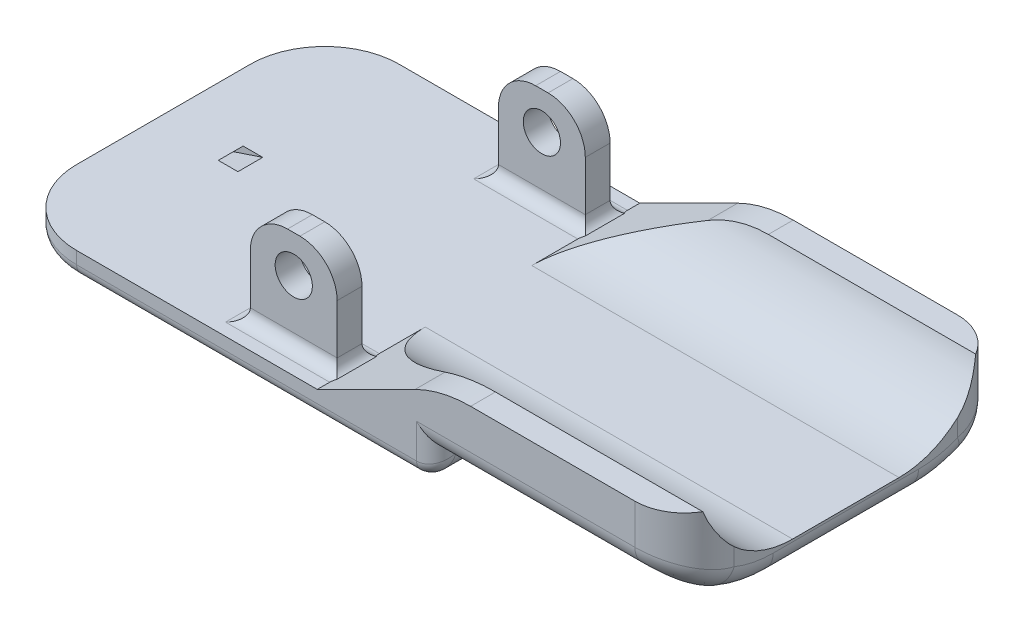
ISO-10303-21;
HEADER;
FILE_DESCRIPTION(('STEP AP214'),'2;1');
FILE_NAME('part.step','',(''),(''),'','','');
FILE_SCHEMA(('AUTOMOTIVE_DESIGN { 1 0 10303 214 1 1 1 1 }'));
ENDSEC;
DATA;
#1=APPLICATION_CONTEXT('core data for automotive mechanical design processes');
#2=APPLICATION_PROTOCOL_DEFINITION('international standard','automotive_design',2000,#1);
#3=PRODUCT_CONTEXT('',#1,'mechanical');
#4=PRODUCT('Part','Part','',(#3));
#5=PRODUCT_RELATED_PRODUCT_CATEGORY('part','',(#4));
#6=PRODUCT_DEFINITION_FORMATION('','',#4);
#7=PRODUCT_DEFINITION_CONTEXT('part definition',#1,'design');
#8=PRODUCT_DEFINITION('design','',#6,#7);
#9=PRODUCT_DEFINITION_SHAPE('','',#8);
#10=(LENGTH_UNIT() NAMED_UNIT(*) SI_UNIT(.MILLI.,.METRE.));
#11=(NAMED_UNIT(*) PLANE_ANGLE_UNIT() SI_UNIT($,.RADIAN.));
#12=(NAMED_UNIT(*) SI_UNIT($,.STERADIAN.) SOLID_ANGLE_UNIT());
#13=UNCERTAINTY_MEASURE_WITH_UNIT(LENGTH_MEASURE(1.E-05),#10,'distance_accuracy_value','');
#14=(GEOMETRIC_REPRESENTATION_CONTEXT(3) GLOBAL_UNCERTAINTY_ASSIGNED_CONTEXT((#13)) GLOBAL_UNIT_ASSIGNED_CONTEXT((#10,
#11,#12)) REPRESENTATION_CONTEXT('',''));
#15=CARTESIAN_POINT('',(0.,0.,0.));
#16=DIRECTION('',(0.,0.,1.));
#17=DIRECTION('',(1.,0.,0.));
#18=AXIS2_PLACEMENT_3D('',#15,#16,#17);
#19=CARTESIAN_POINT('',(0.,2.,0.));
#20=DIRECTION('',(0.,1.,0.));
#21=DIRECTION('',(0.,0.,1.));
#22=AXIS2_PLACEMENT_3D('',#19,#20,#21);
#23=PLANE('',#22);
#24=DIRECTION('',(0.,0.,1.));
#25=VECTOR('',#24,1.);
#26=CARTESIAN_POINT('',(-2.10422488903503,2.,-13.));
#27=LINE('',#26,#25);
#28=CARTESIAN_POINT('',(-2.10422488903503,2.,-8.));
#29=VERTEX_POINT('',#28);
#30=CARTESIAN_POINT('',(-2.10422488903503,2.,-4.29179606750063));
#31=VERTEX_POINT('',#30);
#32=EDGE_CURVE('E421',#29,#31,#27,.T.);
#33=ORIENTED_EDGE('',*,*,#32,.F.);
#34=DIRECTION('',(1.,0.,0.));
#35=VECTOR('',#34,1.);
#36=CARTESIAN_POINT('',(0.,2.,-8.));
#37=LINE('',#36,#35);
#38=CARTESIAN_POINT('',(-10.5,2.,-8.));
#39=VERTEX_POINT('',#38);
#40=EDGE_CURVE('E961',#29,#39,#37,.F.);
#41=ORIENTED_EDGE('',*,*,#40,.T.);
#42=DIRECTION('',(0.,0.,1.));
#43=VECTOR('',#42,1.);
#44=CARTESIAN_POINT('',(-10.5,2.,0.));
#45=LINE('',#44,#43);
#46=CARTESIAN_POINT('',(-10.5,2.,-12.));
#47=VERTEX_POINT('',#46);
#48=EDGE_CURVE('E957',#39,#47,#45,.F.);
#49=ORIENTED_EDGE('',*,*,#48,.T.);
#50=DIRECTION('',(-1.,0.,0.));
#51=VECTOR('',#50,1.);
#52=CARTESIAN_POINT('',(0.,2.,-12.));
#53=LINE('',#52,#51);
#54=CARTESIAN_POINT('',(-2.10422488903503,2.,-12.));
#55=VERTEX_POINT('',#54);
#56=EDGE_CURVE('E954',#47,#55,#53,.F.);
#57=ORIENTED_EDGE('',*,*,#56,.T.);
#58=CARTESIAN_POINT('',(-2.10422488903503,2.,-13.));
#59=VERTEX_POINT('',#58);
#60=EDGE_CURVE('E430',#59,#55,#27,.T.);
#61=ORIENTED_EDGE('',*,*,#60,.F.);
#62=DIRECTION('',(-1.,0.,0.));
#63=VECTOR('',#62,1.);
#64=CARTESIAN_POINT('',(-27.5,2.,-13.));
#65=LINE('',#64,#63);
#66=CARTESIAN_POINT('',(-21.5,2.,-13.));
#67=VERTEX_POINT('',#66);
#68=EDGE_CURVE('E501',#59,#67,#65,.T.);
#69=ORIENTED_EDGE('',*,*,#68,.T.);
#70=CARTESIAN_POINT('',(-21.5,2.,-7.));
#71=DIRECTION('',(0.,1.,0.));
#72=DIRECTION('',(0.,0.,1.));
#73=AXIS2_PLACEMENT_3D('',#70,#71,#72);
#74=CIRCLE('',#73,6.);
#75=CARTESIAN_POINT('',(-27.5,2.,-7.));
#76=VERTEX_POINT('',#75);
#77=EDGE_CURVE('E901',#67,#76,#74,.T.);
#78=ORIENTED_EDGE('',*,*,#77,.T.);
#79=DIRECTION('',(0.,0.,1.));
#80=VECTOR('',#79,1.);
#81=CARTESIAN_POINT('',(-27.5,2.,-13.));
#82=LINE('',#81,#80);
#83=CARTESIAN_POINT('',(-27.5,2.,6.99999999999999));
#84=VERTEX_POINT('',#83);
#85=EDGE_CURVE('E505',#76,#84,#82,.T.);
#86=ORIENTED_EDGE('',*,*,#85,.T.);
#87=CARTESIAN_POINT('',(-21.5,2.,7.));
#88=DIRECTION('',(0.,1.,0.));
#89=DIRECTION('',(0.,0.,1.));
#90=AXIS2_PLACEMENT_3D('',#87,#88,#89);
#91=CIRCLE('',#90,6.);
#92=CARTESIAN_POINT('',(-21.5,2.,13.));
#93=VERTEX_POINT('',#92);
#94=EDGE_CURVE('E1162',#84,#93,#91,.T.);
#95=ORIENTED_EDGE('',*,*,#94,.T.);
#96=DIRECTION('',(1.,0.,0.));
#97=VECTOR('',#96,1.);
#98=CARTESIAN_POINT('',(-27.5,2.,13.));
#99=LINE('',#98,#97);
#100=CARTESIAN_POINT('',(-2.10422488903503,2.,13.));
#101=VERTEX_POINT('',#100);
#102=EDGE_CURVE('E509',#93,#101,#99,.T.);
#103=ORIENTED_EDGE('',*,*,#102,.T.);
#104=DIRECTION('',(0.,0.,1.));
#105=VECTOR('',#104,1.);
#106=CARTESIAN_POINT('',(-2.10422488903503,2.,13.));
#107=LINE('',#106,#105);
#108=CARTESIAN_POINT('',(-2.10422488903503,2.,12.));
#109=VERTEX_POINT('',#108);
#110=EDGE_CURVE('E408',#109,#101,#107,.T.);
#111=ORIENTED_EDGE('',*,*,#110,.F.);
#112=DIRECTION('',(1.,0.,0.));
#113=VECTOR('',#112,1.);
#114=CARTESIAN_POINT('',(0.,2.,12.));
#115=LINE('',#114,#113);
#116=CARTESIAN_POINT('',(-10.5,2.,12.));
#117=VERTEX_POINT('',#116);
#118=EDGE_CURVE('E944',#109,#117,#115,.F.);
#119=ORIENTED_EDGE('',*,*,#118,.T.);
#120=DIRECTION('',(0.,0.,1.));
#121=VECTOR('',#120,1.);
#122=CARTESIAN_POINT('',(-10.5,2.,0.));
#123=LINE('',#122,#121);
#124=CARTESIAN_POINT('',(-10.5,2.,8.));
#125=VERTEX_POINT('',#124);
#126=EDGE_CURVE('E947',#117,#125,#123,.F.);
#127=ORIENTED_EDGE('',*,*,#126,.T.);
#128=DIRECTION('',(-1.,0.,0.));
#129=VECTOR('',#128,1.);
#130=CARTESIAN_POINT('',(0.,2.,8.));
#131=LINE('',#130,#129);
#132=CARTESIAN_POINT('',(-2.10422488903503,2.,8.));
#133=VERTEX_POINT('',#132);
#134=EDGE_CURVE('E950',#125,#133,#131,.F.);
#135=ORIENTED_EDGE('',*,*,#134,.T.);
#136=CARTESIAN_POINT('',(-2.10422488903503,2.,4.29179606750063));
#137=VERTEX_POINT('',#136);
#138=EDGE_CURVE('E418',#137,#133,#107,.T.);
#139=ORIENTED_EDGE('',*,*,#138,.F.);
#140=DIRECTION('',(1.,0.,0.));
#141=VECTOR('',#140,1.);
#142=CARTESIAN_POINT('',(27.5,2.,4.29179606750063));
#143=LINE('',#142,#141);
#144=CARTESIAN_POINT('',(27.5,2.,4.29179606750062));
#145=VERTEX_POINT('',#144);
#146=EDGE_CURVE('E572',#137,#145,#143,.T.);
#147=ORIENTED_EDGE('',*,*,#146,.T.);
#148=DIRECTION('',(0.,0.,-1.));
#149=VECTOR('',#148,1.);
#150=CARTESIAN_POINT('',(27.5,2.,-13.));
#151=LINE('',#150,#149);
#152=CARTESIAN_POINT('',(27.5,2.,-4.29179606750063));
#153=VERTEX_POINT('',#152);
#154=EDGE_CURVE('E497',#145,#153,#151,.T.);
#155=ORIENTED_EDGE('',*,*,#154,.T.);
#156=DIRECTION('',(1.,0.,0.));
#157=VECTOR('',#156,1.);
#158=CARTESIAN_POINT('',(-2.10422488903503,2.,-4.29179606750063));
#159=LINE('',#158,#157);
#160=EDGE_CURVE('E568',#153,#31,#159,.F.);
#161=ORIENTED_EDGE('',*,*,#160,.T.);
#162=EDGE_LOOP('',(#33,#41,#49,#57,#61,#69,#78,#86,#95,#103,#111,#119,#127,#135,#139,#147,#155,#161));
#163=FACE_BOUND('',#162,.T.);
#164=DIRECTION('',(0.,0.,1.));
#165=VECTOR('',#164,1.);
#166=CARTESIAN_POINT('',(-22.0811388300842,2.,-1.));
#167=LINE('',#166,#165);
#168=CARTESIAN_POINT('',(-22.0811388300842,2.,-1.));
#169=VERTEX_POINT('',#168);
#170=CARTESIAN_POINT('',(-22.0811388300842,2.,1.));
#171=VERTEX_POINT('',#170);
#172=EDGE_CURVE('E374',#169,#171,#167,.T.);
#173=ORIENTED_EDGE('',*,*,#172,.F.);
#174=DIRECTION('',(-1.,0.,0.));
#175=VECTOR('',#174,1.);
#176=CARTESIAN_POINT('',(-20.5,2.,-1.));
#177=LINE('',#176,#175);
#178=CARTESIAN_POINT('',(-20.5,2.,-1.));
#179=VERTEX_POINT('',#178);
#180=EDGE_CURVE('E382',#179,#169,#177,.T.);
#181=ORIENTED_EDGE('',*,*,#180,.F.);
#182=DIRECTION('',(0.,0.,1.));
#183=VECTOR('',#182,1.);
#184=CARTESIAN_POINT('',(-20.5,2.,-1.));
#185=LINE('',#184,#183);
#186=CARTESIAN_POINT('',(-20.5,2.,1.));
#187=VERTEX_POINT('',#186);
#188=EDGE_CURVE('E877',#179,#187,#185,.T.);
#189=ORIENTED_EDGE('',*,*,#188,.T.);
#190=DIRECTION('',(-1.,0.,0.));
#191=VECTOR('',#190,1.);
#192=CARTESIAN_POINT('',(-20.5,2.,1.));
#193=LINE('',#192,#191);
#194=EDGE_CURVE('E394',#187,#171,#193,.T.);
#195=ORIENTED_EDGE('',*,*,#194,.T.);
#196=EDGE_LOOP('',(#173,#181,#189,#195));
#197=FACE_BOUND('',#196,.T.);
#198=ADVANCED_FACE('F40',(#163,#197),#23,.T.);
#199=CARTESIAN_POINT('',(27.5,2.,-13.));
#200=DIRECTION('',(-1.,0.,0.));
#201=DIRECTION('',(0.,0.,1.));
#202=AXIS2_PLACEMENT_3D('',#199,#200,#201);
#203=PLANE('',#202);
#204=DIRECTION('',(0.,0.,-1.));
#205=VECTOR('',#204,1.);
#206=CARTESIAN_POINT('',(27.5,1.8,-13.));
#207=LINE('',#206,#205);
#208=CARTESIAN_POINT('',(27.5,1.8,5.85786437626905));
#209=VERTEX_POINT('',#208);
#210=CARTESIAN_POINT('',(27.5,1.8,-5.85786437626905));
#211=VERTEX_POINT('',#210);
#212=EDGE_CURVE('E1065',#209,#211,#207,.T.);
#213=ORIENTED_EDGE('',*,*,#212,.T.);
#214=CARTESIAN_POINT('',(27.5,10.,-5.85786437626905));
#215=DIRECTION('',(-1.,0.,0.));
#216=DIRECTION('',(0.,0.,1.));
#217=AXIS2_PLACEMENT_3D('',#214,#215,#216);
#218=CIRCLE('',#217,8.2);
#219=CARTESIAN_POINT('',(27.5,2.42590046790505,-9.));
#220=VERTEX_POINT('',#219);
#221=EDGE_CURVE('E1124',#211,#220,#218,.F.);
#222=ORIENTED_EDGE('',*,*,#221,.T.);
#223=DIRECTION('',(0.,-1.,0.));
#224=VECTOR('',#223,1.);
#225=CARTESIAN_POINT('',(27.5,2.,-9.));
#226=LINE('',#225,#224);
#227=CARTESIAN_POINT('',(27.5,3.8199598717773,-9.));
#228=VERTEX_POINT('',#227);
#229=EDGE_CURVE('E597',#220,#228,#226,.F.);
#230=ORIENTED_EDGE('',*,*,#229,.T.);
#231=CARTESIAN_POINT('',(27.5,9.,-4.29179606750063));
#232=DIRECTION('',(-1.,0.,0.));
#233=DIRECTION('',(0.,0.,1.));
#234=AXIS2_PLACEMENT_3D('',#231,#232,#233);
#235=CIRCLE('',#234,7.);
#236=EDGE_CURVE('E582',#228,#153,#235,.T.);
#237=ORIENTED_EDGE('',*,*,#236,.T.);
#238=ORIENTED_EDGE('',*,*,#154,.F.);
#239=CARTESIAN_POINT('',(27.5,9.,4.29179606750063));
#240=DIRECTION('',(-1.,0.,0.));
#241=DIRECTION('',(0.,0.,1.));
#242=AXIS2_PLACEMENT_3D('',#239,#240,#241);
#243=CIRCLE('',#242,7.);
#244=CARTESIAN_POINT('',(27.5,3.8199598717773,9.));
#245=VERTEX_POINT('',#244);
#246=EDGE_CURVE('E578',#145,#245,#243,.T.);
#247=ORIENTED_EDGE('',*,*,#246,.T.);
#248=DIRECTION('',(0.,-1.,0.));
#249=VECTOR('',#248,1.);
#250=CARTESIAN_POINT('',(27.5,2.,9.));
#251=LINE('',#250,#249);
#252=CARTESIAN_POINT('',(27.5,2.42590046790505,9.));
#253=VERTEX_POINT('',#252);
#254=EDGE_CURVE('E593',#245,#253,#251,.T.);
#255=ORIENTED_EDGE('',*,*,#254,.T.);
#256=CARTESIAN_POINT('',(27.5,10.,5.85786437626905));
#257=DIRECTION('',(-1.,0.,0.));
#258=DIRECTION('',(0.,0.,1.));
#259=AXIS2_PLACEMENT_3D('',#256,#257,#258);
#260=CIRCLE('',#259,8.2);
#261=EDGE_CURVE('E1119',#253,#209,#260,.F.);
#262=ORIENTED_EDGE('',*,*,#261,.T.);
#263=EDGE_LOOP('',(#213,#222,#230,#237,#238,#247,#255,#262));
#264=FACE_BOUND('',#263,.T.);
#265=ADVANCED_FACE('F1128',(#264),#203,.F.);
#266=CARTESIAN_POINT('',(-27.5,2.,-13.));
#267=DIRECTION('',(0.,0.,1.));
#268=DIRECTION('',(1.,0.,0.));
#269=AXIS2_PLACEMENT_3D('',#266,#267,#268);
#270=PLANE('',#269);
#271=DIRECTION('',(0.894427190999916,0.447213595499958,0.));
#272=VECTOR('',#271,1.);
#273=CARTESIAN_POINT('',(-2.10422488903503,2.,-13.));
#274=LINE('',#273,#272);
#275=CARTESIAN_POINT('',(5.78431893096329,5.94427190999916,-13.));
#276=VERTEX_POINT('',#275);
#277=EDGE_CURVE('E404',#59,#276,#274,.T.);
#278=ORIENTED_EDGE('',*,*,#277,.T.);
#279=CARTESIAN_POINT('',(10.2564548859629,-3.,-13.));
#280=DIRECTION('',(0.,0.,1.));
#281=DIRECTION('',(1.,0.,0.));
#282=AXIS2_PLACEMENT_3D('',#279,#280,#281);
#283=CIRCLE('',#282,10.);
#284=CARTESIAN_POINT('',(10.2564548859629,7.,-13.));
#285=VERTEX_POINT('',#284);
#286=EDGE_CURVE('E1201',#276,#285,#283,.F.);
#287=ORIENTED_EDGE('',*,*,#286,.T.);
#288=DIRECTION('',(-1.,0.,0.));
#289=VECTOR('',#288,1.);
#290=CARTESIAN_POINT('',(27.5,7.,-13.));
#291=LINE('',#290,#289);
#292=CARTESIAN_POINT('',(23.5,7.,-13.));
#293=VERTEX_POINT('',#292);
#294=EDGE_CURVE('E425',#293,#285,#291,.T.);
#295=ORIENTED_EDGE('',*,*,#294,.F.);
#296=DIRECTION('',(0.,-1.,0.));
#297=VECTOR('',#296,1.);
#298=CARTESIAN_POINT('',(23.5,2.,-13.));
#299=LINE('',#298,#297);
#300=CARTESIAN_POINT('',(23.5,3.778940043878,-13.));
#301=VERTEX_POINT('',#300);
#302=EDGE_CURVE('E589',#293,#301,#299,.T.);
#303=ORIENTED_EDGE('',*,*,#302,.T.);
#304=DIRECTION('',(-1.,0.,0.));
#305=VECTOR('',#304,1.);
#306=CARTESIAN_POINT('',(7.49999999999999,3.778940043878,-13.));
#307=LINE('',#306,#305);
#308=CARTESIAN_POINT('',(5.89999999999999,3.778940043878,-13.));
#309=VERTEX_POINT('',#308);
#310=EDGE_CURVE('E1053',#301,#309,#307,.T.);
#311=ORIENTED_EDGE('',*,*,#310,.T.);
#312=DIRECTION('',(0.,1.,0.));
#313=VECTOR('',#312,1.);
#314=CARTESIAN_POINT('',(5.89999999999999,2.,-13.));
#315=LINE('',#314,#313);
#316=CARTESIAN_POINT('',(5.89999999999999,1.,-13.));
#317=VERTEX_POINT('',#316);
#318=EDGE_CURVE('E806',#309,#317,#315,.F.);
#319=ORIENTED_EDGE('',*,*,#318,.T.);
#320=DIRECTION('',(-1.,0.,0.));
#321=VECTOR('',#320,1.);
#322=CARTESIAN_POINT('',(-27.5,1.,-13.));
#323=LINE('',#322,#321);
#324=CARTESIAN_POINT('',(-21.5,1.,-13.));
#325=VERTEX_POINT('',#324);
#326=EDGE_CURVE('E842',#317,#325,#323,.T.);
#327=ORIENTED_EDGE('',*,*,#326,.T.);
#328=DIRECTION('',(0.,-1.,0.));
#329=VECTOR('',#328,1.);
#330=CARTESIAN_POINT('',(-21.5,2.,-13.));
#331=LINE('',#330,#329);
#332=EDGE_CURVE('E1154',#325,#67,#331,.F.);
#333=ORIENTED_EDGE('',*,*,#332,.T.);
#334=ORIENTED_EDGE('',*,*,#68,.F.);
#335=EDGE_LOOP('',(#278,#287,#295,#303,#311,#319,#327,#333,#334));
#336=FACE_BOUND('',#335,.T.);
#337=ADVANCED_FACE('F1146',(#336),#270,.F.);
#338=CARTESIAN_POINT('',(-27.5,2.,-13.));
#339=DIRECTION('',(1.,0.,0.));
#340=DIRECTION('',(0.,0.,-1.));
#341=AXIS2_PLACEMENT_3D('',#338,#339,#340);
#342=PLANE('',#341);
#343=DIRECTION('',(0.,-1.,0.));
#344=VECTOR('',#343,1.);
#345=CARTESIAN_POINT('',(-27.5,2.,-7.));
#346=LINE('',#345,#344);
#347=CARTESIAN_POINT('',(-27.5,1.,-7.));
#348=VERTEX_POINT('',#347);
#349=EDGE_CURVE('E1163',#76,#348,#346,.T.);
#350=ORIENTED_EDGE('',*,*,#349,.T.);
#351=DIRECTION('',(0.,0.,1.));
#352=VECTOR('',#351,1.);
#353=CARTESIAN_POINT('',(-27.5,1.,-13.));
#354=LINE('',#353,#352);
#355=CARTESIAN_POINT('',(-27.5,1.,7.));
#356=VERTEX_POINT('',#355);
#357=EDGE_CURVE('E918',#348,#356,#354,.T.);
#358=ORIENTED_EDGE('',*,*,#357,.T.);
#359=DIRECTION('',(0.,-1.,0.));
#360=VECTOR('',#359,1.);
#361=CARTESIAN_POINT('',(-27.5,2.,7.));
#362=LINE('',#361,#360);
#363=EDGE_CURVE('E1178',#356,#84,#362,.F.);
#364=ORIENTED_EDGE('',*,*,#363,.T.);
#365=ORIENTED_EDGE('',*,*,#85,.F.);
#366=EDGE_LOOP('',(#350,#358,#364,#365));
#367=FACE_BOUND('',#366,.T.);
#368=ADVANCED_FACE('F1176',(#367),#342,.F.);
#369=CARTESIAN_POINT('',(-27.5,2.,13.));
#370=DIRECTION('',(0.,0.,-1.));
#371=DIRECTION('',(-1.,0.,0.));
#372=AXIS2_PLACEMENT_3D('',#369,#370,#371);
#373=PLANE('',#372);
#374=DIRECTION('',(1.,0.,0.));
#375=VECTOR('',#374,1.);
#376=CARTESIAN_POINT('',(27.5,7.,13.));
#377=LINE('',#376,#375);
#378=CARTESIAN_POINT('',(10.2564548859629,7.,13.));
#379=VERTEX_POINT('',#378);
#380=CARTESIAN_POINT('',(23.5,7.,13.));
#381=VERTEX_POINT('',#380);
#382=EDGE_CURVE('E417',#379,#381,#377,.T.);
#383=ORIENTED_EDGE('',*,*,#382,.F.);
#384=CARTESIAN_POINT('',(10.2564548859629,-3.,13.));
#385=DIRECTION('',(0.,0.,-1.));
#386=DIRECTION('',(-1.,0.,0.));
#387=AXIS2_PLACEMENT_3D('',#384,#385,#386);
#388=CIRCLE('',#387,10.);
#389=CARTESIAN_POINT('',(5.78431893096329,5.94427190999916,13.));
#390=VERTEX_POINT('',#389);
#391=EDGE_CURVE('E11',#379,#390,#388,.F.);
#392=ORIENTED_EDGE('',*,*,#391,.T.);
#393=DIRECTION('',(0.894427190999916,0.447213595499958,0.));
#394=VECTOR('',#393,1.);
#395=CARTESIAN_POINT('',(-2.10422488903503,2.,13.));
#396=LINE('',#395,#394);
#397=EDGE_CURVE('E409',#101,#390,#396,.T.);
#398=ORIENTED_EDGE('',*,*,#397,.F.);
#399=ORIENTED_EDGE('',*,*,#102,.F.);
#400=DIRECTION('',(0.,-1.,0.));
#401=VECTOR('',#400,1.);
#402=CARTESIAN_POINT('',(-21.5,2.,13.));
#403=LINE('',#402,#401);
#404=CARTESIAN_POINT('',(-21.5,1.,13.));
#405=VERTEX_POINT('',#404);
#406=EDGE_CURVE('E896',#93,#405,#403,.T.);
#407=ORIENTED_EDGE('',*,*,#406,.T.);
#408=DIRECTION('',(1.,0.,0.));
#409=VECTOR('',#408,1.);
#410=CARTESIAN_POINT('',(-27.5,1.,13.));
#411=LINE('',#410,#409);
#412=CARTESIAN_POINT('',(5.89999999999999,1.,13.));
#413=VERTEX_POINT('',#412);
#414=EDGE_CURVE('E855',#405,#413,#411,.T.);
#415=ORIENTED_EDGE('',*,*,#414,.T.);
#416=DIRECTION('',(0.,-1.,0.));
#417=VECTOR('',#416,1.);
#418=CARTESIAN_POINT('',(5.89999999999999,3.77894004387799,13.));
#419=LINE('',#418,#417);
#420=CARTESIAN_POINT('',(5.89999999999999,3.77894004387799,13.));
#421=VERTEX_POINT('',#420);
#422=EDGE_CURVE('E825',#413,#421,#419,.F.);
#423=ORIENTED_EDGE('',*,*,#422,.T.);
#424=DIRECTION('',(-1.,0.,0.));
#425=VECTOR('',#424,1.);
#426=CARTESIAN_POINT('',(23.5,3.77894004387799,13.));
#427=LINE('',#426,#425);
#428=CARTESIAN_POINT('',(23.5,3.77894004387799,13.));
#429=VERTEX_POINT('',#428);
#430=EDGE_CURVE('E802',#421,#429,#427,.F.);
#431=ORIENTED_EDGE('',*,*,#430,.T.);
#432=DIRECTION('',(0.,-1.,0.));
#433=VECTOR('',#432,1.);
#434=CARTESIAN_POINT('',(23.5,2.,13.));
#435=LINE('',#434,#433);
#436=EDGE_CURVE('E1098',#429,#381,#435,.F.);
#437=ORIENTED_EDGE('',*,*,#436,.T.);
#438=EDGE_LOOP('',(#383,#392,#398,#399,#407,#415,#423,#431,#437));
#439=FACE_BOUND('',#438,.T.);
#440=ADVANCED_FACE('F893',(#439),#373,.F.);
#441=CARTESIAN_POINT('',(0.,0.,0.));
#442=DIRECTION('',(0.,1.,0.));
#443=DIRECTION('',(0.,0.,1.));
#444=AXIS2_PLACEMENT_3D('',#441,#442,#443);
#445=PLANE('',#444);
#446=DIRECTION('',(-1.,0.,0.));
#447=VECTOR('',#446,1.);
#448=CARTESIAN_POINT('',(0.,0.,-12.));
#449=LINE('',#448,#447);
#450=CARTESIAN_POINT('',(-21.5,0.,-12.));
#451=VERTEX_POINT('',#450);
#452=CARTESIAN_POINT('',(5.89999999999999,0.,-12.));
#453=VERTEX_POINT('',#452);
#454=EDGE_CURVE('E840',#451,#453,#449,.F.);
#455=ORIENTED_EDGE('',*,*,#454,.T.);
#456=DIRECTION('',(0.,0.,-1.));
#457=VECTOR('',#456,1.);
#458=CARTESIAN_POINT('',(5.89999999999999,0.,0.));
#459=LINE('',#458,#457);
#460=CARTESIAN_POINT('',(5.89999999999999,0.,-5.85786437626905));
#461=VERTEX_POINT('',#460);
#462=EDGE_CURVE('E812',#453,#461,#459,.F.);
#463=ORIENTED_EDGE('',*,*,#462,.T.);
#464=DIRECTION('',(1.,0.,0.));
#465=VECTOR('',#464,1.);
#466=CARTESIAN_POINT('',(0.,0.,-5.85786437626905));
#467=LINE('',#466,#465);
#468=CARTESIAN_POINT('',(25.7,0.,-5.85786437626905));
#469=VERTEX_POINT('',#468);
#470=EDGE_CURVE('E1035',#461,#469,#467,.T.);
#471=ORIENTED_EDGE('',*,*,#470,.T.);
#472=DIRECTION('',(0.,0.,-1.));
#473=VECTOR('',#472,1.);
#474=CARTESIAN_POINT('',(25.7,0.,0.));
#475=LINE('',#474,#473);
#476=CARTESIAN_POINT('',(25.7,0.,5.85786437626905));
#477=VERTEX_POINT('',#476);
#478=EDGE_CURVE('E1085',#469,#477,#475,.F.);
#479=ORIENTED_EDGE('',*,*,#478,.T.);
#480=DIRECTION('',(1.,0.,0.));
#481=VECTOR('',#480,1.);
#482=CARTESIAN_POINT('',(0.,0.,5.85786437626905));
#483=LINE('',#482,#481);
#484=CARTESIAN_POINT('',(5.89999999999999,0.,5.85786437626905));
#485=VERTEX_POINT('',#484);
#486=EDGE_CURVE('E1004',#477,#485,#483,.F.);
#487=ORIENTED_EDGE('',*,*,#486,.T.);
#488=DIRECTION('',(0.,0.,-1.));
#489=VECTOR('',#488,1.);
#490=CARTESIAN_POINT('',(5.89999999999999,0.,12.));
#491=LINE('',#490,#489);
#492=CARTESIAN_POINT('',(5.89999999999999,0.,12.));
#493=VERTEX_POINT('',#492);
#494=EDGE_CURVE('E809',#485,#493,#491,.F.);
#495=ORIENTED_EDGE('',*,*,#494,.T.);
#496=DIRECTION('',(1.,0.,0.));
#497=VECTOR('',#496,1.);
#498=CARTESIAN_POINT('',(0.,0.,12.));
#499=LINE('',#498,#497);
#500=CARTESIAN_POINT('',(-21.5,0.,12.));
#501=VERTEX_POINT('',#500);
#502=EDGE_CURVE('E891',#493,#501,#499,.F.);
#503=ORIENTED_EDGE('',*,*,#502,.T.);
#504=CARTESIAN_POINT('',(-21.5,0.,7.));
#505=DIRECTION('',(0.,1.,0.));
#506=DIRECTION('',(0.,0.,1.));
#507=AXIS2_PLACEMENT_3D('',#504,#505,#506);
#508=CIRCLE('',#507,5.);
#509=CARTESIAN_POINT('',(-26.5,0.,7.));
#510=VERTEX_POINT('',#509);
#511=EDGE_CURVE('E910',#501,#510,#508,.F.);
#512=ORIENTED_EDGE('',*,*,#511,.T.);
#513=DIRECTION('',(0.,0.,1.));
#514=VECTOR('',#513,1.);
#515=CARTESIAN_POINT('',(-26.5,0.,0.));
#516=LINE('',#515,#514);
#517=CARTESIAN_POINT('',(-26.5,0.,-7.));
#518=VERTEX_POINT('',#517);
#519=EDGE_CURVE('E907',#510,#518,#516,.F.);
#520=ORIENTED_EDGE('',*,*,#519,.T.);
#521=CARTESIAN_POINT('',(-21.5,0.,-7.));
#522=DIRECTION('',(0.,1.,0.));
#523=DIRECTION('',(0.,0.,1.));
#524=AXIS2_PLACEMENT_3D('',#521,#522,#523);
#525=CIRCLE('',#524,5.);
#526=EDGE_CURVE('E853',#518,#451,#525,.F.);
#527=ORIENTED_EDGE('',*,*,#526,.T.);
#528=EDGE_LOOP('',(#455,#463,#471,#479,#487,#495,#503,#512,#520,#527));
#529=FACE_BOUND('',#528,.T.);
#530=ADVANCED_FACE('F849',(#529),#445,.F.);
#531=CARTESIAN_POINT('',(-9.50000000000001,10.,11.));
#532=DIRECTION('',(1.,0.,0.));
#533=DIRECTION('',(0.,0.,-1.));
#534=AXIS2_PLACEMENT_3D('',#531,#532,#533);
#535=PLANE('',#534);
#536=DIRECTION('',(0.,-1.,0.));
#537=VECTOR('',#536,1.);
#538=CARTESIAN_POINT('',(-9.50000000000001,10.,9.));
#539=LINE('',#538,#537);
#540=CARTESIAN_POINT('',(-9.50000000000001,7.,9.));
#541=VERTEX_POINT('',#540);
#542=CARTESIAN_POINT('',(-9.50000000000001,3.,9.));
#543=VERTEX_POINT('',#542);
#544=EDGE_CURVE('E481',#541,#543,#539,.T.);
#545=ORIENTED_EDGE('',*,*,#544,.T.);
#546=DIRECTION('',(0.,0.,1.));
#547=VECTOR('',#546,1.);
#548=CARTESIAN_POINT('',(-9.50000000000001,3.,11.));
#549=LINE('',#548,#547);
#550=CARTESIAN_POINT('',(-9.50000000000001,3.,11.));
#551=VERTEX_POINT('',#550);
#552=EDGE_CURVE('E998',#543,#551,#549,.T.);
#553=ORIENTED_EDGE('',*,*,#552,.T.);
#554=DIRECTION('',(0.,-1.,0.));
#555=VECTOR('',#554,1.);
#556=CARTESIAN_POINT('',(-9.50000000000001,10.,11.));
#557=LINE('',#556,#555);
#558=CARTESIAN_POINT('',(-9.50000000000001,7.,11.));
#559=VERTEX_POINT('',#558);
#560=EDGE_CURVE('E493',#559,#551,#557,.T.);
#561=ORIENTED_EDGE('',*,*,#560,.F.);
#562=DIRECTION('',(0.,0.,1.));
#563=VECTOR('',#562,1.);
#564=CARTESIAN_POINT('',(-9.50000000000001,7.,11.));
#565=LINE('',#564,#563);
#566=EDGE_CURVE('E539',#559,#541,#565,.F.);
#567=ORIENTED_EDGE('',*,*,#566,.T.);
#568=EDGE_LOOP('',(#545,#553,#561,#567));
#569=FACE_BOUND('',#568,.T.);
#570=ADVANCED_FACE('F1265',(#569),#535,.F.);
#571=CARTESIAN_POINT('',(-9.50000000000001,10.,11.));
#572=DIRECTION('',(0.,0.,-1.));
#573=DIRECTION('',(-1.,0.,0.));
#574=AXIS2_PLACEMENT_3D('',#571,#572,#573);
#575=PLANE('',#574);
#576=CARTESIAN_POINT('',(-6.00000000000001,7.,11.));
#577=DIRECTION('',(0.,0.,1.));
#578=DIRECTION('',(1.,0.,0.));
#579=AXIS2_PLACEMENT_3D('',#576,#577,#578);
#580=CIRCLE('',#579,1.5);
#581=CARTESIAN_POINT('',(-4.50000000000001,7.,11.));
#582=VERTEX_POINT('',#581);
#583=EDGE_CURVE('E433',#582,#582,#580,.T.);
#584=ORIENTED_EDGE('',*,*,#583,.F.);
#585=EDGE_LOOP('',(#584));
#586=FACE_BOUND('',#585,.T.);
#587=ORIENTED_EDGE('',*,*,#560,.T.);
#588=DIRECTION('',(1.,0.,0.));
#589=VECTOR('',#588,1.);
#590=CARTESIAN_POINT('',(-9.50000000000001,3.,11.));
#591=LINE('',#590,#589);
#592=CARTESIAN_POINT('',(-2.50000000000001,3.,11.));
#593=VERTEX_POINT('',#592);
#594=EDGE_CURVE('E1001',#551,#593,#591,.T.);
#595=ORIENTED_EDGE('',*,*,#594,.T.);
#596=DIRECTION('',(0.,-1.,0.));
#597=VECTOR('',#596,1.);
#598=CARTESIAN_POINT('',(-2.50000000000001,10.,11.));
#599=LINE('',#598,#597);
#600=CARTESIAN_POINT('',(-2.50000000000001,7.,11.));
#601=VERTEX_POINT('',#600);
#602=EDGE_CURVE('E489',#601,#593,#599,.T.);
#603=ORIENTED_EDGE('',*,*,#602,.F.);
#604=CARTESIAN_POINT('',(-5.50000000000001,7.,11.));
#605=DIRECTION('',(0.,0.,-1.));
#606=DIRECTION('',(-1.,0.,0.));
#607=AXIS2_PLACEMENT_3D('',#604,#605,#606);
#608=CIRCLE('',#607,3.);
#609=CARTESIAN_POINT('',(-5.50000000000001,10.,11.));
#610=VERTEX_POINT('',#609);
#611=EDGE_CURVE('E536',#601,#610,#608,.F.);
#612=ORIENTED_EDGE('',*,*,#611,.T.);
#613=DIRECTION('',(1.,0.,0.));
#614=VECTOR('',#613,1.);
#615=CARTESIAN_POINT('',(-9.50000000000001,10.,11.));
#616=LINE('',#615,#614);
#617=CARTESIAN_POINT('',(-6.50000000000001,10.,11.));
#618=VERTEX_POINT('',#617);
#619=EDGE_CURVE('E473',#618,#610,#616,.T.);
#620=ORIENTED_EDGE('',*,*,#619,.F.);
#621=CARTESIAN_POINT('',(-6.50000000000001,7.,11.));
#622=DIRECTION('',(0.,0.,-1.));
#623=DIRECTION('',(-1.,0.,0.));
#624=AXIS2_PLACEMENT_3D('',#621,#622,#623);
#625=CIRCLE('',#624,3.);
#626=EDGE_CURVE('E533',#618,#559,#625,.F.);
#627=ORIENTED_EDGE('',*,*,#626,.T.);
#628=EDGE_LOOP('',(#587,#595,#603,#612,#620,#627));
#629=FACE_BOUND('',#628,.T.);
#630=ADVANCED_FACE('F1399',(#586,#629),#575,.F.);
#631=CARTESIAN_POINT('',(-2.50000000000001,10.,11.));
#632=DIRECTION('',(-1.,0.,0.));
#633=DIRECTION('',(0.,0.,1.));
#634=AXIS2_PLACEMENT_3D('',#631,#632,#633);
#635=PLANE('',#634);
#636=ORIENTED_EDGE('',*,*,#602,.T.);
#637=DIRECTION('',(0.,0.,-1.));
#638=VECTOR('',#637,1.);
#639=CARTESIAN_POINT('',(-2.50000000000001,3.,11.));
#640=LINE('',#639,#638);
#641=CARTESIAN_POINT('',(-2.50000000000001,3.,9.));
#642=VERTEX_POINT('',#641);
#643=EDGE_CURVE('E995',#593,#642,#640,.T.);
#644=ORIENTED_EDGE('',*,*,#643,.T.);
#645=DIRECTION('',(0.,-1.,0.));
#646=VECTOR('',#645,1.);
#647=CARTESIAN_POINT('',(-2.50000000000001,10.,9.));
#648=LINE('',#647,#646);
#649=CARTESIAN_POINT('',(-2.50000000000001,7.,9.));
#650=VERTEX_POINT('',#649);
#651=EDGE_CURVE('E485',#650,#642,#648,.T.);
#652=ORIENTED_EDGE('',*,*,#651,.F.);
#653=DIRECTION('',(0.,0.,-1.));
#654=VECTOR('',#653,1.);
#655=CARTESIAN_POINT('',(-2.50000000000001,7.,11.));
#656=LINE('',#655,#654);
#657=EDGE_CURVE('E530',#650,#601,#656,.F.);
#658=ORIENTED_EDGE('',*,*,#657,.T.);
#659=EDGE_LOOP('',(#636,#644,#652,#658));
#660=FACE_BOUND('',#659,.T.);
#661=ADVANCED_FACE('F1281',(#660),#635,.F.);
#662=CARTESIAN_POINT('',(-9.50000000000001,10.,9.));
#663=DIRECTION('',(0.,0.,1.));
#664=DIRECTION('',(1.,0.,0.));
#665=AXIS2_PLACEMENT_3D('',#662,#663,#664);
#666=PLANE('',#665);
#667=CARTESIAN_POINT('',(-6.00000000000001,7.,9.));
#668=DIRECTION('',(0.,0.,1.));
#669=DIRECTION('',(1.,0.,0.));
#670=AXIS2_PLACEMENT_3D('',#667,#668,#669);
#671=CIRCLE('',#670,1.5);
#672=CARTESIAN_POINT('',(-4.50000000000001,7.,9.));
#673=VERTEX_POINT('',#672);
#674=EDGE_CURVE('E445',#673,#673,#671,.T.);
#675=ORIENTED_EDGE('',*,*,#674,.T.);
#676=EDGE_LOOP('',(#675));
#677=FACE_BOUND('',#676,.T.);
#678=ORIENTED_EDGE('',*,*,#651,.T.);
#679=DIRECTION('',(-1.,0.,0.));
#680=VECTOR('',#679,1.);
#681=CARTESIAN_POINT('',(-9.50000000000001,3.,9.));
#682=LINE('',#681,#680);
#683=EDGE_CURVE('E982',#642,#543,#682,.T.);
#684=ORIENTED_EDGE('',*,*,#683,.T.);
#685=ORIENTED_EDGE('',*,*,#544,.F.);
#686=CARTESIAN_POINT('',(-6.50000000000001,7.,9.));
#687=DIRECTION('',(0.,0.,1.));
#688=DIRECTION('',(1.,0.,0.));
#689=AXIS2_PLACEMENT_3D('',#686,#687,#688);
#690=CIRCLE('',#689,3.);
#691=CARTESIAN_POINT('',(-6.50000000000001,10.,9.));
#692=VERTEX_POINT('',#691);
#693=EDGE_CURVE('E524',#541,#692,#690,.F.);
#694=ORIENTED_EDGE('',*,*,#693,.T.);
#695=DIRECTION('',(-1.,0.,0.));
#696=VECTOR('',#695,1.);
#697=CARTESIAN_POINT('',(-9.50000000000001,10.,9.));
#698=LINE('',#697,#696);
#699=CARTESIAN_POINT('',(-5.50000000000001,10.,9.));
#700=VERTEX_POINT('',#699);
#701=EDGE_CURVE('E477',#700,#692,#698,.T.);
#702=ORIENTED_EDGE('',*,*,#701,.F.);
#703=CARTESIAN_POINT('',(-5.50000000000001,7.,9.));
#704=DIRECTION('',(0.,0.,1.));
#705=DIRECTION('',(1.,0.,0.));
#706=AXIS2_PLACEMENT_3D('',#703,#704,#705);
#707=CIRCLE('',#706,3.);
#708=EDGE_CURVE('E527',#700,#650,#707,.F.);
#709=ORIENTED_EDGE('',*,*,#708,.T.);
#710=EDGE_LOOP('',(#678,#684,#685,#694,#702,#709));
#711=FACE_BOUND('',#710,.T.);
#712=ADVANCED_FACE('F1261',(#677,#711),#666,.F.);
#713=CARTESIAN_POINT('',(0.,10.,0.));
#714=DIRECTION('',(0.,-1.,0.));
#715=DIRECTION('',(0.,0.,-1.));
#716=AXIS2_PLACEMENT_3D('',#713,#714,#715);
#717=PLANE('',#716);
#718=ORIENTED_EDGE('',*,*,#619,.T.);
#719=DIRECTION('',(0.,0.,-1.));
#720=VECTOR('',#719,1.);
#721=CARTESIAN_POINT('',(-5.50000000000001,10.,0.));
#722=LINE('',#721,#720);
#723=EDGE_CURVE('E520',#610,#700,#722,.T.);
#724=ORIENTED_EDGE('',*,*,#723,.T.);
#725=ORIENTED_EDGE('',*,*,#701,.T.);
#726=DIRECTION('',(0.,0.,1.));
#727=VECTOR('',#726,1.);
#728=CARTESIAN_POINT('',(-6.50000000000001,10.,0.));
#729=LINE('',#728,#727);
#730=EDGE_CURVE('E513',#692,#618,#729,.T.);
#731=ORIENTED_EDGE('',*,*,#730,.T.);
#732=EDGE_LOOP('',(#718,#724,#725,#731));
#733=FACE_BOUND('',#732,.T.);
#734=ADVANCED_FACE('F1273',(#733),#717,.F.);
#735=CARTESIAN_POINT('',(-9.50000000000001,10.,-11.));
#736=DIRECTION('',(1.,0.,0.));
#737=DIRECTION('',(0.,0.,-1.));
#738=AXIS2_PLACEMENT_3D('',#735,#736,#737);
#739=PLANE('',#738);
#740=DIRECTION('',(0.,-1.,0.));
#741=VECTOR('',#740,1.);
#742=CARTESIAN_POINT('',(-9.50000000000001,10.,-11.));
#743=LINE('',#742,#741);
#744=CARTESIAN_POINT('',(-9.50000000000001,7.,-11.));
#745=VERTEX_POINT('',#744);
#746=CARTESIAN_POINT('',(-9.50000000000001,3.,-11.));
#747=VERTEX_POINT('',#746);
#748=EDGE_CURVE('E457',#745,#747,#743,.T.);
#749=ORIENTED_EDGE('',*,*,#748,.T.);
#750=DIRECTION('',(0.,0.,1.));
#751=VECTOR('',#750,1.);
#752=CARTESIAN_POINT('',(-9.50000000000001,3.,-11.));
#753=LINE('',#752,#751);
#754=CARTESIAN_POINT('',(-9.50000000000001,3.,-9.));
#755=VERTEX_POINT('',#754);
#756=EDGE_CURVE('E926',#747,#755,#753,.T.);
#757=ORIENTED_EDGE('',*,*,#756,.T.);
#758=DIRECTION('',(0.,-1.,0.));
#759=VECTOR('',#758,1.);
#760=CARTESIAN_POINT('',(-9.50000000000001,10.,-9.));
#761=LINE('',#760,#759);
#762=CARTESIAN_POINT('',(-9.50000000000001,7.,-9.));
#763=VERTEX_POINT('',#762);
#764=EDGE_CURVE('E469',#763,#755,#761,.T.);
#765=ORIENTED_EDGE('',*,*,#764,.F.);
#766=DIRECTION('',(0.,0.,1.));
#767=VECTOR('',#766,1.);
#768=CARTESIAN_POINT('',(-9.50000000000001,7.,-11.));
#769=LINE('',#768,#767);
#770=EDGE_CURVE('E556',#763,#745,#769,.F.);
#771=ORIENTED_EDGE('',*,*,#770,.T.);
#772=EDGE_LOOP('',(#749,#757,#765,#771));
#773=FACE_BOUND('',#772,.T.);
#774=ADVANCED_FACE('F1347',(#773),#739,.F.);
#775=CARTESIAN_POINT('',(-9.50000000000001,10.,-9.));
#776=DIRECTION('',(0.,0.,-1.));
#777=DIRECTION('',(-1.,0.,0.));
#778=AXIS2_PLACEMENT_3D('',#775,#776,#777);
#779=PLANE('',#778);
#780=CARTESIAN_POINT('',(-6.00000000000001,7.,-9.));
#781=DIRECTION('',(0.,0.,-1.));
#782=DIRECTION('',(-1.,0.,0.));
#783=AXIS2_PLACEMENT_3D('',#780,#781,#782);
#784=CIRCLE('',#783,1.5);
#785=CARTESIAN_POINT('',(-7.50000000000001,7.,-9.));
#786=VERTEX_POINT('',#785);
#787=EDGE_CURVE('E441',#786,#786,#784,.T.);
#788=ORIENTED_EDGE('',*,*,#787,.T.);
#789=EDGE_LOOP('',(#788));
#790=FACE_BOUND('',#789,.T.);
#791=ORIENTED_EDGE('',*,*,#764,.T.);
#792=DIRECTION('',(1.,0.,0.));
#793=VECTOR('',#792,1.);
#794=CARTESIAN_POINT('',(-9.50000000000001,3.,-9.));
#795=LINE('',#794,#793);
#796=CARTESIAN_POINT('',(-2.50000000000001,3.,-9.));
#797=VERTEX_POINT('',#796);
#798=EDGE_CURVE('E964',#755,#797,#795,.T.);
#799=ORIENTED_EDGE('',*,*,#798,.T.);
#800=DIRECTION('',(0.,-1.,0.));
#801=VECTOR('',#800,1.);
#802=CARTESIAN_POINT('',(-2.50000000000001,10.,-9.));
#803=LINE('',#802,#801);
#804=CARTESIAN_POINT('',(-2.50000000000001,7.,-9.));
#805=VERTEX_POINT('',#804);
#806=EDGE_CURVE('E465',#805,#797,#803,.T.);
#807=ORIENTED_EDGE('',*,*,#806,.F.);
#808=CARTESIAN_POINT('',(-5.50000000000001,7.,-9.));
#809=DIRECTION('',(0.,0.,-1.));
#810=DIRECTION('',(-1.,0.,0.));
#811=AXIS2_PLACEMENT_3D('',#808,#809,#810);
#812=CIRCLE('',#811,3.);
#813=CARTESIAN_POINT('',(-5.50000000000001,10.,-9.));
#814=VERTEX_POINT('',#813);
#815=EDGE_CURVE('E550',#805,#814,#812,.F.);
#816=ORIENTED_EDGE('',*,*,#815,.T.);
#817=DIRECTION('',(1.,0.,0.));
#818=VECTOR('',#817,1.);
#819=CARTESIAN_POINT('',(-9.50000000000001,10.,-9.));
#820=LINE('',#819,#818);
#821=CARTESIAN_POINT('',(-6.50000000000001,10.,-9.));
#822=VERTEX_POINT('',#821);
#823=EDGE_CURVE('E449',#822,#814,#820,.T.);
#824=ORIENTED_EDGE('',*,*,#823,.F.);
#825=CARTESIAN_POINT('',(-6.50000000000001,7.,-9.));
#826=DIRECTION('',(0.,0.,-1.));
#827=DIRECTION('',(-1.,0.,0.));
#828=AXIS2_PLACEMENT_3D('',#825,#826,#827);
#829=CIRCLE('',#828,3.);
#830=EDGE_CURVE('E553',#822,#763,#829,.F.);
#831=ORIENTED_EDGE('',*,*,#830,.T.);
#832=EDGE_LOOP('',(#791,#799,#807,#816,#824,#831));
#833=FACE_BOUND('',#832,.T.);
#834=ADVANCED_FACE('F1338',(#790,#833),#779,.F.);
#835=CARTESIAN_POINT('',(-2.50000000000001,10.,-11.));
#836=DIRECTION('',(-1.,0.,0.));
#837=DIRECTION('',(0.,0.,1.));
#838=AXIS2_PLACEMENT_3D('',#835,#836,#837);
#839=PLANE('',#838);
#840=ORIENTED_EDGE('',*,*,#806,.T.);
#841=DIRECTION('',(0.,0.,-1.));
#842=VECTOR('',#841,1.);
#843=CARTESIAN_POINT('',(-2.50000000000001,3.,-11.));
#844=LINE('',#843,#842);
#845=CARTESIAN_POINT('',(-2.50000000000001,3.,-11.));
#846=VERTEX_POINT('',#845);
#847=EDGE_CURVE('E979',#797,#846,#844,.T.);
#848=ORIENTED_EDGE('',*,*,#847,.T.);
#849=DIRECTION('',(0.,-1.,0.));
#850=VECTOR('',#849,1.);
#851=CARTESIAN_POINT('',(-2.50000000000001,10.,-11.));
#852=LINE('',#851,#850);
#853=CARTESIAN_POINT('',(-2.50000000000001,7.,-11.));
#854=VERTEX_POINT('',#853);
#855=EDGE_CURVE('E461',#854,#846,#852,.T.);
#856=ORIENTED_EDGE('',*,*,#855,.F.);
#857=DIRECTION('',(0.,0.,-1.));
#858=VECTOR('',#857,1.);
#859=CARTESIAN_POINT('',(-2.50000000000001,7.,-9.));
#860=LINE('',#859,#858);
#861=EDGE_CURVE('E565',#854,#805,#860,.F.);
#862=ORIENTED_EDGE('',*,*,#861,.T.);
#863=EDGE_LOOP('',(#840,#848,#856,#862));
#864=FACE_BOUND('',#863,.T.);
#865=ADVANCED_FACE('F1364',(#864),#839,.F.);
#866=CARTESIAN_POINT('',(-9.50000000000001,10.,-11.));
#867=DIRECTION('',(0.,0.,1.));
#868=DIRECTION('',(1.,0.,0.));
#869=AXIS2_PLACEMENT_3D('',#866,#867,#868);
#870=PLANE('',#869);
#871=CARTESIAN_POINT('',(-6.00000000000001,7.,-11.));
#872=DIRECTION('',(0.,0.,1.));
#873=DIRECTION('',(1.,0.,0.));
#874=AXIS2_PLACEMENT_3D('',#871,#872,#873);
#875=CIRCLE('',#874,1.5);
#876=CARTESIAN_POINT('',(-4.50000000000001,7.,-11.));
#877=VERTEX_POINT('',#876);
#878=EDGE_CURVE('E440',#877,#877,#875,.T.);
#879=ORIENTED_EDGE('',*,*,#878,.T.);
#880=EDGE_LOOP('',(#879));
#881=FACE_BOUND('',#880,.T.);
#882=ORIENTED_EDGE('',*,*,#855,.T.);
#883=DIRECTION('',(-1.,0.,0.));
#884=VECTOR('',#883,1.);
#885=CARTESIAN_POINT('',(-9.50000000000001,3.,-11.));
#886=LINE('',#885,#884);
#887=EDGE_CURVE('E976',#846,#747,#886,.T.);
#888=ORIENTED_EDGE('',*,*,#887,.T.);
#889=ORIENTED_EDGE('',*,*,#748,.F.);
#890=CARTESIAN_POINT('',(-6.50000000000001,7.,-11.));
#891=DIRECTION('',(0.,0.,1.));
#892=DIRECTION('',(1.,0.,0.));
#893=AXIS2_PLACEMENT_3D('',#890,#891,#892);
#894=CIRCLE('',#893,3.);
#895=CARTESIAN_POINT('',(-6.50000000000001,10.,-11.));
#896=VERTEX_POINT('',#895);
#897=EDGE_CURVE('E562',#745,#896,#894,.F.);
#898=ORIENTED_EDGE('',*,*,#897,.T.);
#899=DIRECTION('',(-1.,0.,0.));
#900=VECTOR('',#899,1.);
#901=CARTESIAN_POINT('',(-9.50000000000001,10.,-11.));
#902=LINE('',#901,#900);
#903=CARTESIAN_POINT('',(-5.50000000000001,10.,-11.));
#904=VERTEX_POINT('',#903);
#905=EDGE_CURVE('E453',#904,#896,#902,.T.);
#906=ORIENTED_EDGE('',*,*,#905,.F.);
#907=CARTESIAN_POINT('',(-5.50000000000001,7.,-11.));
#908=DIRECTION('',(0.,0.,1.));
#909=DIRECTION('',(1.,0.,0.));
#910=AXIS2_PLACEMENT_3D('',#907,#908,#909);
#911=CIRCLE('',#910,3.);
#912=EDGE_CURVE('E559',#904,#854,#911,.F.);
#913=ORIENTED_EDGE('',*,*,#912,.T.);
#914=EDGE_LOOP('',(#882,#888,#889,#898,#906,#913));
#915=FACE_BOUND('',#914,.T.);
#916=ADVANCED_FACE('F1375',(#881,#915),#870,.F.);
#917=CARTESIAN_POINT('',(0.,10.,0.));
#918=DIRECTION('',(0.,1.,0.));
#919=DIRECTION('',(0.,0.,1.));
#920=AXIS2_PLACEMENT_3D('',#917,#918,#919);
#921=PLANE('',#920);
#922=ORIENTED_EDGE('',*,*,#905,.T.);
#923=DIRECTION('',(0.,0.,1.));
#924=VECTOR('',#923,1.);
#925=CARTESIAN_POINT('',(-6.50000000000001,10.,-9.));
#926=LINE('',#925,#924);
#927=EDGE_CURVE('E546',#896,#822,#926,.T.);
#928=ORIENTED_EDGE('',*,*,#927,.T.);
#929=ORIENTED_EDGE('',*,*,#823,.T.);
#930=DIRECTION('',(0.,0.,-1.));
#931=VECTOR('',#930,1.);
#932=CARTESIAN_POINT('',(-5.50000000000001,10.,-11.));
#933=LINE('',#932,#931);
#934=EDGE_CURVE('E542',#814,#904,#933,.T.);
#935=ORIENTED_EDGE('',*,*,#934,.T.);
#936=EDGE_LOOP('',(#922,#928,#929,#935));
#937=FACE_BOUND('',#936,.T.);
#938=ADVANCED_FACE('F1340',(#937),#921,.T.);
#939=CARTESIAN_POINT('',(-6.00000000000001,7.,-13.));
#940=DIRECTION('',(0.,0.,1.));
#941=DIRECTION('',(1.,0.,0.));
#942=AXIS2_PLACEMENT_3D('',#939,#940,#941);
#943=CYLINDRICAL_SURFACE('',#942,1.5);
#944=ORIENTED_EDGE('',*,*,#878,.F.);
#945=EDGE_LOOP('',(#944));
#946=FACE_BOUND('',#945,.T.);
#947=ORIENTED_EDGE('',*,*,#787,.F.);
#948=EDGE_LOOP('',(#947));
#949=FACE_BOUND('',#948,.T.);
#950=ADVANCED_FACE('F1383',(#946,#949),#943,.F.);
#951=ORIENTED_EDGE('',*,*,#583,.T.);
#952=EDGE_LOOP('',(#951));
#953=FACE_BOUND('',#952,.T.);
#954=ORIENTED_EDGE('',*,*,#674,.F.);
#955=EDGE_LOOP('',(#954));
#956=FACE_BOUND('',#955,.T.);
#957=ADVANCED_FACE('F1318',(#953,#956),#943,.F.);
#958=CARTESIAN_POINT('',(-5.50000000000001,7.,0.));
#959=DIRECTION('',(0.,0.,-1.));
#960=DIRECTION('',(-1.,0.,0.));
#961=AXIS2_PLACEMENT_3D('',#958,#959,#960);
#962=CYLINDRICAL_SURFACE('',#961,3.);
#963=ORIENTED_EDGE('',*,*,#611,.F.);
#964=ORIENTED_EDGE('',*,*,#657,.F.);
#965=ORIENTED_EDGE('',*,*,#708,.F.);
#966=ORIENTED_EDGE('',*,*,#723,.F.);
#967=EDGE_LOOP('',(#963,#964,#965,#966));
#968=FACE_BOUND('',#967,.T.);
#969=ADVANCED_FACE('F1278',(#968),#962,.T.);
#970=CARTESIAN_POINT('',(-6.50000000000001,7.,0.));
#971=DIRECTION('',(0.,0.,1.));
#972=DIRECTION('',(1.,0.,0.));
#973=AXIS2_PLACEMENT_3D('',#970,#971,#972);
#974=CYLINDRICAL_SURFACE('',#973,3.);
#975=ORIENTED_EDGE('',*,*,#693,.F.);
#976=ORIENTED_EDGE('',*,*,#566,.F.);
#977=ORIENTED_EDGE('',*,*,#626,.F.);
#978=ORIENTED_EDGE('',*,*,#730,.F.);
#979=EDGE_LOOP('',(#975,#976,#977,#978));
#980=FACE_BOUND('',#979,.T.);
#981=ADVANCED_FACE('F1269',(#980),#974,.T.);
#982=CARTESIAN_POINT('',(-6.50000000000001,7.,0.));
#983=DIRECTION('',(0.,0.,-1.));
#984=DIRECTION('',(-1.,0.,0.));
#985=AXIS2_PLACEMENT_3D('',#982,#983,#984);
#986=CYLINDRICAL_SURFACE('',#985,3.);
#987=ORIENTED_EDGE('',*,*,#897,.F.);
#988=ORIENTED_EDGE('',*,*,#770,.F.);
#989=ORIENTED_EDGE('',*,*,#830,.F.);
#990=ORIENTED_EDGE('',*,*,#927,.F.);
#991=EDGE_LOOP('',(#987,#988,#989,#990));
#992=FACE_BOUND('',#991,.T.);
#993=ADVANCED_FACE('F1321',(#992),#986,.T.);
#994=CARTESIAN_POINT('',(-5.50000000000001,7.,0.));
#995=DIRECTION('',(0.,0.,1.));
#996=DIRECTION('',(1.,0.,0.));
#997=AXIS2_PLACEMENT_3D('',#994,#995,#996);
#998=CYLINDRICAL_SURFACE('',#997,3.);
#999=ORIENTED_EDGE('',*,*,#815,.F.);
#1000=ORIENTED_EDGE('',*,*,#861,.F.);
#1001=ORIENTED_EDGE('',*,*,#912,.F.);
#1002=ORIENTED_EDGE('',*,*,#934,.F.);
#1003=EDGE_LOOP('',(#999,#1000,#1001,#1002));
#1004=FACE_BOUND('',#1003,.T.);
#1005=ADVANCED_FACE('F1323',(#1004),#998,.T.);
#1006=CARTESIAN_POINT('',(0.,7.,0.));
#1007=DIRECTION('',(0.,-1.,0.));
#1008=DIRECTION('',(0.,0.,-1.));
#1009=AXIS2_PLACEMENT_3D('',#1006,#1007,#1008);
#1010=PLANE('',#1009);
#1011=ORIENTED_EDGE('',*,*,#294,.T.);
#1012=DIRECTION('',(0.,0.,1.));
#1013=VECTOR('',#1012,1.);
#1014=CARTESIAN_POINT('',(10.2564548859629,7.,0.));
#1015=LINE('',#1014,#1013);
#1016=CARTESIAN_POINT('',(10.2564548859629,7.,-11.));
#1017=VERTEX_POINT('',#1016);
#1018=EDGE_CURVE('E635',#285,#1017,#1015,.T.);
#1019=ORIENTED_EDGE('',*,*,#1018,.T.);
#1020=DIRECTION('',(1.,0.,0.));
#1021=VECTOR('',#1020,1.);
#1022=CARTESIAN_POINT('',(27.5,7.,-11.));
#1023=LINE('',#1022,#1021);
#1024=CARTESIAN_POINT('',(26.9641016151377,7.,-11.));
#1025=VERTEX_POINT('',#1024);
#1026=EDGE_CURVE('E429',#1017,#1025,#1023,.T.);
#1027=ORIENTED_EDGE('',*,*,#1026,.T.);
#1028=CARTESIAN_POINT('',(23.5,7.,-9.));
#1029=DIRECTION('',(0.,-1.,0.));
#1030=DIRECTION('',(0.,0.,-1.));
#1031=AXIS2_PLACEMENT_3D('',#1028,#1029,#1030);
#1032=CIRCLE('',#1031,4.);
#1033=EDGE_CURVE('E610',#1025,#293,#1032,.F.);
#1034=ORIENTED_EDGE('',*,*,#1033,.T.);
#1035=EDGE_LOOP('',(#1011,#1019,#1027,#1034));
#1036=FACE_BOUND('',#1035,.T.);
#1037=ADVANCED_FACE('F1240',(#1036),#1010,.F.);
#1038=CARTESIAN_POINT('',(0.,7.,0.));
#1039=DIRECTION('',(0.,1.,0.));
#1040=DIRECTION('',(0.,0.,1.));
#1041=AXIS2_PLACEMENT_3D('',#1038,#1039,#1040);
#1042=PLANE('',#1041);
#1043=DIRECTION('',(-1.,0.,0.));
#1044=VECTOR('',#1043,1.);
#1045=CARTESIAN_POINT('',(27.5,7.,11.));
#1046=LINE('',#1045,#1044);
#1047=CARTESIAN_POINT('',(26.9641016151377,7.,11.));
#1048=VERTEX_POINT('',#1047);
#1049=CARTESIAN_POINT('',(10.2564548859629,7.,11.));
#1050=VERTEX_POINT('',#1049);
#1051=EDGE_CURVE('E414',#1048,#1050,#1046,.T.);
#1052=ORIENTED_EDGE('',*,*,#1051,.T.);
#1053=DIRECTION('',(0.,0.,-1.));
#1054=VECTOR('',#1053,1.);
#1055=CARTESIAN_POINT('',(10.2564548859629,7.,13.));
#1056=LINE('',#1055,#1054);
#1057=EDGE_CURVE('E50',#1050,#379,#1056,.F.);
#1058=ORIENTED_EDGE('',*,*,#1057,.T.);
#1059=ORIENTED_EDGE('',*,*,#382,.T.);
#1060=CARTESIAN_POINT('',(23.5,7.,9.));
#1061=DIRECTION('',(0.,1.,0.));
#1062=DIRECTION('',(0.,0.,1.));
#1063=AXIS2_PLACEMENT_3D('',#1060,#1061,#1062);
#1064=CIRCLE('',#1063,4.);
#1065=EDGE_CURVE('E1105',#381,#1048,#1064,.T.);
#1066=ORIENTED_EDGE('',*,*,#1065,.T.);
#1067=EDGE_LOOP('',(#1052,#1058,#1059,#1066));
#1068=FACE_BOUND('',#1067,.T.);
#1069=ADVANCED_FACE('F1226',(#1068),#1042,.T.);
#1070=CARTESIAN_POINT('',(-2.10422488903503,2.,-13.));
#1071=DIRECTION('',(0.447213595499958,-0.894427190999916,0.));
#1072=DIRECTION('',(0.894427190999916,0.447213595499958,0.));
#1073=AXIS2_PLACEMENT_3D('',#1070,#1071,#1072);
#1074=PLANE('',#1073);
#1075=ORIENTED_EDGE('',*,*,#397,.T.);
#1076=DIRECTION('',(0.,0.,-1.));
#1077=VECTOR('',#1076,1.);
#1078=CARTESIAN_POINT('',(5.78431893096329,5.94427190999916,11.));
#1079=LINE('',#1078,#1077);
#1080=CARTESIAN_POINT('',(5.78431893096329,5.94427190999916,10.5896152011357));
#1081=VERTEX_POINT('',#1080);
#1082=EDGE_CURVE('E1207',#390,#1081,#1079,.T.);
#1083=ORIENTED_EDGE('',*,*,#1082,.T.);
#1084=CARTESIAN_POINT('',(11.895775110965,9.,4.29179606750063));
#1085=DIRECTION('',(0.447213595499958,-0.894427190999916,0.));
#1086=DIRECTION('',(-0.894427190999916,-0.447213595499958,0.));
#1087=AXIS2_PLACEMENT_3D('',#1084,#1085,#1086);
#1088=ELLIPSE('',#1087,15.6524758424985,7.);
#1089=EDGE_CURVE('E575',#1081,#137,#1088,.T.);
#1090=ORIENTED_EDGE('',*,*,#1089,.T.);
#1091=ORIENTED_EDGE('',*,*,#138,.T.);
#1092=CARTESIAN_POINT('',(-0.104224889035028,3.,8.));
#1093=DIRECTION('',(0.447213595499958,-0.894427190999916,0.));
#1094=DIRECTION('',(-0.894427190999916,-0.447213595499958,0.));
#1095=AXIS2_PLACEMENT_3D('',#1092,#1093,#1094);
#1096=ELLIPSE('',#1095,2.23606797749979,1.);
#1097=CARTESIAN_POINT('',(-1.91962240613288,2.09230124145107,8.41962240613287));
#1098=VERTEX_POINT('',#1097);
#1099=EDGE_CURVE('E992',#133,#1098,#1096,.F.);
#1100=ORIENTED_EDGE('',*,*,#1099,.T.);
#1101=DIRECTION('',(0.,0.,-1.));
#1102=VECTOR('',#1101,1.);
#1103=CARTESIAN_POINT('',(-1.91962240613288,2.09230124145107,10.));
#1104=LINE('',#1103,#1102);
#1105=CARTESIAN_POINT('',(-1.91962240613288,2.09230124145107,11.5803775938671));
#1106=VERTEX_POINT('',#1105);
#1107=EDGE_CURVE('E989',#1098,#1106,#1104,.F.);
#1108=ORIENTED_EDGE('',*,*,#1107,.T.);
#1109=CARTESIAN_POINT('',(-0.104224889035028,3.,12.));
#1110=DIRECTION('',(0.447213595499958,-0.894427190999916,0.));
#1111=DIRECTION('',(0.894427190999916,0.447213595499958,0.));
#1112=AXIS2_PLACEMENT_3D('',#1109,#1110,#1111);
#1113=ELLIPSE('',#1112,2.23606797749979,1.);
#1114=EDGE_CURVE('E986',#1106,#109,#1113,.F.);
#1115=ORIENTED_EDGE('',*,*,#1114,.T.);
#1116=ORIENTED_EDGE('',*,*,#110,.T.);
#1117=EDGE_LOOP('',(#1075,#1083,#1090,#1091,#1100,#1108,#1115,#1116));
#1118=FACE_BOUND('',#1117,.T.);
#1119=ADVANCED_FACE('F1230',(#1118),#1074,.F.);
#1120=CARTESIAN_POINT('',(11.895775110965,9.,-4.29179606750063));
#1121=DIRECTION('',(0.447213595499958,-0.894427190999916,0.));
#1122=DIRECTION('',(-0.894427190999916,-0.447213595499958,0.));
#1123=AXIS2_PLACEMENT_3D('',#1120,#1121,#1122);
#1124=ELLIPSE('',#1123,15.6524758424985,7.);
#1125=CARTESIAN_POINT('',(5.78431893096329,5.94427190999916,-10.5896152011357));
#1126=VERTEX_POINT('',#1125);
#1127=EDGE_CURVE('E585',#31,#1126,#1124,.T.);
#1128=ORIENTED_EDGE('',*,*,#1127,.T.);
#1129=DIRECTION('',(0.,0.,1.));
#1130=VECTOR('',#1129,1.);
#1131=CARTESIAN_POINT('',(5.78431893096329,5.94427190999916,-13.));
#1132=LINE('',#1131,#1130);
#1133=EDGE_CURVE('E634',#1126,#276,#1132,.F.);
#1134=ORIENTED_EDGE('',*,*,#1133,.T.);
#1135=ORIENTED_EDGE('',*,*,#277,.F.);
#1136=ORIENTED_EDGE('',*,*,#60,.T.);
#1137=CARTESIAN_POINT('',(-0.104224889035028,3.,-12.));
#1138=DIRECTION('',(0.447213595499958,-0.894427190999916,0.));
#1139=DIRECTION('',(-0.894427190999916,-0.447213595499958,0.));
#1140=AXIS2_PLACEMENT_3D('',#1137,#1138,#1139);
#1141=ELLIPSE('',#1140,2.23606797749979,1.);
#1142=CARTESIAN_POINT('',(-1.91962240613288,2.09230124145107,-11.5803775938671));
#1143=VERTEX_POINT('',#1142);
#1144=EDGE_CURVE('E970',#55,#1143,#1141,.F.);
#1145=ORIENTED_EDGE('',*,*,#1144,.T.);
#1146=DIRECTION('',(0.,0.,-1.));
#1147=VECTOR('',#1146,1.);
#1148=CARTESIAN_POINT('',(-1.91962240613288,2.09230124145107,-10.));
#1149=LINE('',#1148,#1147);
#1150=CARTESIAN_POINT('',(-1.91962240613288,2.09230124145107,-8.41962240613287));
#1151=VERTEX_POINT('',#1150);
#1152=EDGE_CURVE('E967',#1143,#1151,#1149,.F.);
#1153=ORIENTED_EDGE('',*,*,#1152,.T.);
#1154=CARTESIAN_POINT('',(-0.104224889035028,3.,-8.));
#1155=DIRECTION('',(0.447213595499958,-0.894427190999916,0.));
#1156=DIRECTION('',(0.894427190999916,0.447213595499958,0.));
#1157=AXIS2_PLACEMENT_3D('',#1154,#1155,#1156);
#1158=ELLIPSE('',#1157,2.23606797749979,1.);
#1159=EDGE_CURVE('E973',#1151,#29,#1158,.F.);
#1160=ORIENTED_EDGE('',*,*,#1159,.T.);
#1161=ORIENTED_EDGE('',*,*,#32,.T.);
#1162=EDGE_LOOP('',(#1128,#1134,#1135,#1136,#1145,#1153,#1160,#1161));
#1163=FACE_BOUND('',#1162,.T.);
#1164=ADVANCED_FACE('F1417',(#1163),#1074,.F.);
#1165=CARTESIAN_POINT('',(27.5,9.,4.29179606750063));
#1166=DIRECTION('',(-1.,0.,0.));
#1167=DIRECTION('',(0.,0.,1.));
#1168=AXIS2_PLACEMENT_3D('',#1165,#1166,#1167);
#1169=CYLINDRICAL_SURFACE('',#1168,7.);
#1170=ORIENTED_EDGE('',*,*,#1089,.F.);
#1171=CARTESIAN_POINT('',(5.78431893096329,5.94427190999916,10.5896152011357));
#1172=CARTESIAN_POINT('',(5.91698072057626,6.01061353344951,10.6217921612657));
#1173=CARTESIAN_POINT('',(6.05161375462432,6.07423006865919,10.6513763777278));
#1174=CARTESIAN_POINT('',(6.32435326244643,6.19569501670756,10.7058699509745));
#1175=CARTESIAN_POINT('',(6.46245907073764,6.25354452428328,10.7307801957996));
#1176=CARTESIAN_POINT('',(6.74169128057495,6.36316935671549,10.7764426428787));
#1177=CARTESIAN_POINT('',(6.88281692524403,6.41494618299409,10.7971958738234));
#1178=CARTESIAN_POINT('',(7.16769498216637,6.51221456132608,10.835009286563));
#1179=CARTESIAN_POINT('',(7.31144747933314,6.55770590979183,10.8520693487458));
#1180=CARTESIAN_POINT('',(7.73925108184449,6.68248273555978,10.89761957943));
#1181=CARTESIAN_POINT('',(8.02650072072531,6.75267865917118,10.9215166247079));
#1182=CARTESIAN_POINT('',(8.60655265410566,6.86738032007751,10.9592976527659));
#1183=CARTESIAN_POINT('',(8.89935168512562,6.91190070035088,10.9731873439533));
#1184=CARTESIAN_POINT('',(9.28147456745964,6.95275055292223,10.9857371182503));
#1185=CARTESIAN_POINT('',(9.36951288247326,6.96098174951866,10.9882469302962));
#1186=CARTESIAN_POINT('',(9.54577609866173,6.97510632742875,10.9925322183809));
#1187=CARTESIAN_POINT('',(9.63400094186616,6.98100035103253,10.9943078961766));
#1188=CARTESIAN_POINT('',(9.81121633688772,6.99048014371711,10.9971562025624));
#1189=CARTESIAN_POINT('',(9.90020785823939,6.99404913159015,10.9982237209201));
#1190=CARTESIAN_POINT('',(10.078284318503,6.99880953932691,10.9996450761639));
#1191=CARTESIAN_POINT('',(10.1673692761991,7.00000031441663,10.9999987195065));
#1192=CARTESIAN_POINT('',(10.2564548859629,7.,11.));
#1193=B_SPLINE_CURVE_WITH_KNOTS('',3,(#1171,#1172,#1173,#1174,#1175,#1176,#1177,#1178,#1179,
#1180,#1181,#1182,#1183,#1184,#1185,#1186,#1187,#1188,#1189,#1190,#1191,#1192),.UNSPECIFIED.,
.F.,.F.,(4,2,2,2,2,2,2,2,2,2,4),(0.,0.455240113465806,0.910393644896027,1.36543440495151,
1.82048990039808,2.70903869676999,3.59708024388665,3.86243356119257,4.12771390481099,
4.39488832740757,4.66213517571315),.UNSPECIFIED.);
#1194=EDGE_CURVE('E1211',#1081,#1050,#1193,.T.);
#1195=ORIENTED_EDGE('',*,*,#1194,.T.);
#1196=ORIENTED_EDGE('',*,*,#1051,.F.);
#1197=CARTESIAN_POINT('',(26.9641016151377,7.,11.));
#1198=CARTESIAN_POINT('',(26.9918735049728,6.83860595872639,10.9518743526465));
#1199=CARTESIAN_POINT('',(27.0216328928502,6.67929007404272,10.8980403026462));
#1200=CARTESIAN_POINT('',(27.0831462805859,6.36527671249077,10.7792022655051));
#1201=CARTESIAN_POINT('',(27.114900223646,6.21057910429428,10.7141985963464));
#1202=CARTESIAN_POINT('',(27.1777656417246,5.90940983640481,10.5747263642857));
#1203=CARTESIAN_POINT('',(27.2088767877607,5.76283412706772,10.5004819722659));
#1204=CARTESIAN_POINT('',(27.2692316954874,5.47496006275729,10.3416815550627));
#1205=CARTESIAN_POINT('',(27.2984754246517,5.33366179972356,10.2571253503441));
#1206=CARTESIAN_POINT('',(27.3504008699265,5.07088884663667,10.0869697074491));
#1207=CARTESIAN_POINT('',(27.3734472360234,4.94885610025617,10.0023438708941));
#1208=CARTESIAN_POINT('',(27.4150284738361,4.70996811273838,9.82512599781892));
#1209=CARTESIAN_POINT('',(27.4335650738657,4.5931109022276,9.73253703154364));
#1210=CARTESIAN_POINT('',(27.4649291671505,4.36293045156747,9.53781414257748));
#1211=CARTESIAN_POINT('',(27.4776428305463,4.24971488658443,9.43553354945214));
#1212=CARTESIAN_POINT('',(27.4951790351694,4.02975279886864,9.22333782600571));
#1213=CARTESIAN_POINT('',(27.4999908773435,3.92301523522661,9.11341255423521));
#1214=CARTESIAN_POINT('',(27.5,3.8199598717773,9.));
#1215=B_SPLINE_CURVE_WITH_KNOTS('',3,(#1197,#1198,#1199,#1200,#1201,#1202,#1203,#1204,#1205,
#1206,#1207,#1208,#1209,#1210,#1211,#1212,#1213,#1214),.UNSPECIFIED.,.F.,.F.,(4,2,2,2,2,2,2,2,
4),(0.,0.511911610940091,1.02380865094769,1.52509282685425,2.02638573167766,2.47689125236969,
2.9272238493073,3.38601897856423,3.84543480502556),.UNSPECIFIED.);
#1216=EDGE_CURVE('E1183',#1048,#245,#1215,.T.);
#1217=ORIENTED_EDGE('',*,*,#1216,.T.);
#1218=ORIENTED_EDGE('',*,*,#246,.F.);
#1219=ORIENTED_EDGE('',*,*,#146,.F.);
#1220=EDGE_LOOP('',(#1170,#1195,#1196,#1217,#1218,#1219));
#1221=FACE_BOUND('',#1220,.T.);
#1222=ADVANCED_FACE('F620',(#1221),#1169,.F.);
#1223=CARTESIAN_POINT('',(27.5,9.,-4.29179606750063));
#1224=DIRECTION('',(-1.,0.,0.));
#1225=DIRECTION('',(0.,0.,1.));
#1226=AXIS2_PLACEMENT_3D('',#1223,#1224,#1225);
#1227=CYLINDRICAL_SURFACE('',#1226,7.);
#1228=ORIENTED_EDGE('',*,*,#1026,.F.);
#1229=CARTESIAN_POINT('',(10.2564548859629,7.,-11.));
#1230=CARTESIAN_POINT('',(10.1053035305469,7.00000322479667,-10.9999888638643));
#1231=CARTESIAN_POINT('',(9.95415292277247,6.9965730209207,-10.9989779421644));
#1232=CARTESIAN_POINT('',(9.65218256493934,6.98286949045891,-10.9948758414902));
#1233=CARTESIAN_POINT('',(9.50136283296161,6.97259579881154,-10.9917845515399));
#1234=CARTESIAN_POINT('',(9.20019997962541,6.94521086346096,-10.9834354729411));
#1235=CARTESIAN_POINT('',(9.04985775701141,6.92809055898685,-10.9781748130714));
#1236=CARTESIAN_POINT('',(8.75021748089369,6.88706850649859,-10.9653239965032));
#1237=CARTESIAN_POINT('',(8.60091939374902,6.8631669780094,-10.9577339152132));
#1238=CARTESIAN_POINT('',(8.16247091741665,6.78273993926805,-10.9315971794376));
#1239=CARTESIAN_POINT('',(7.87519714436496,6.71679231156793,-10.9094917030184));
#1240=CARTESIAN_POINT('',(7.30890894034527,6.56023680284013,-10.8533851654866));
#1241=CARTESIAN_POINT('',(7.02988591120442,6.4696556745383,-10.8193969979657));
#1242=CARTESIAN_POINT('',(6.67347410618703,6.33649390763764,-10.7653450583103));
#1243=CARTESIAN_POINT('',(6.59100834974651,6.3044245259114,-10.7520716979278));
#1244=CARTESIAN_POINT('',(6.42718297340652,6.23820730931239,-10.7240427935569));
#1245=CARTESIAN_POINT('',(6.34582313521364,6.20405989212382,-10.7092875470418));
#1246=CARTESIAN_POINT('',(6.18367535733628,6.13347387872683,-10.6780726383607));
#1247=CARTESIAN_POINT('',(6.10289648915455,6.09701981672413,-10.661600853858));
#1248=CARTESIAN_POINT('',(5.94261876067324,6.02212006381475,-10.6269306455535));
#1249=CARTESIAN_POINT('',(5.86312021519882,5.98367389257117,-10.6087318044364));
#1250=CARTESIAN_POINT('',(5.78431893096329,5.94427190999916,-10.5896152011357));
#1251=B_SPLINE_CURVE_WITH_KNOTS('',3,(#1229,#1230,#1231,#1232,#1233,#1234,#1235,#1236,#1237,
#1238,#1239,#1240,#1241,#1242,#1243,#1244,#1245,#1246,#1247,#1248,#1249,#1250),.UNSPECIFIED.,
.F.,.F.,(4,2,2,2,2,2,2,2,2,2,4),(0.,0.453410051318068,0.906844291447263,1.3608806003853,
1.81490221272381,2.70022787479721,3.58459585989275,3.85298363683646,4.12131764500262,
4.39169480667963,4.662137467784),.UNSPECIFIED.);
#1252=EDGE_CURVE('E626',#1017,#1126,#1251,.T.);
#1253=ORIENTED_EDGE('',*,*,#1252,.T.);
#1254=ORIENTED_EDGE('',*,*,#1127,.F.);
#1255=ORIENTED_EDGE('',*,*,#160,.F.);
#1256=ORIENTED_EDGE('',*,*,#236,.F.);
#1257=CARTESIAN_POINT('',(27.5,3.8199598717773,-9.));
#1258=CARTESIAN_POINT('',(27.4999843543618,3.93576043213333,-9.12744861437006));
#1259=CARTESIAN_POINT('',(27.4939131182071,4.05619602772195,-9.25046643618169));
#1260=CARTESIAN_POINT('',(27.4720476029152,4.30512324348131,-9.48673758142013));
#1261=CARTESIAN_POINT('',(27.4562693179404,4.43360130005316,-9.60000661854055));
#1262=CARTESIAN_POINT('',(27.4177581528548,4.69509808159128,-9.8140996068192));
#1263=CARTESIAN_POINT('',(27.3951733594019,4.82797116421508,-9.91512993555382));
#1264=CARTESIAN_POINT('',(27.3450227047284,5.09998804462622,-10.1070878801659));
#1265=CARTESIAN_POINT('',(27.317455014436,5.23913413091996,-10.1980117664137));
#1266=CARTESIAN_POINT('',(27.2626883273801,5.50673053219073,-10.3596307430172));
#1267=CARTESIAN_POINT('',(27.2358112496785,5.63457159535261,-10.4314497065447));
#1268=CARTESIAN_POINT('',(27.1810807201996,5.89430804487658,-10.566835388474));
#1269=CARTESIAN_POINT('',(27.1532275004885,6.02620246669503,-10.6304040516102));
#1270=CARTESIAN_POINT('',(27.0973572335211,6.29625814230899,-10.750279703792));
#1271=CARTESIAN_POINT('',(27.0693467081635,6.43449022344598,-10.8064303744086));
#1272=CARTESIAN_POINT('',(27.015067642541,6.71460046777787,-10.9098948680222));
#1273=CARTESIAN_POINT('',(26.9887996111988,6.85647967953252,-10.9572061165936));
#1274=CARTESIAN_POINT('',(26.9641016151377,7.,-11.));
#1275=B_SPLINE_CURVE_WITH_KNOTS('',3,(#1257,#1258,#1259,#1260,#1261,#1262,#1263,#1264,#1265,
#1266,#1267,#1268,#1269,#1270,#1271,#1272,#1273,#1274),.UNSPECIFIED.,.F.,.F.,(4,2,2,2,2,2,2,2,
4),(0.,0.516146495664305,1.03144481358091,1.53625501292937,2.04125089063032,2.48819456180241,
2.93503268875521,3.39014759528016,3.84539484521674),.UNSPECIFIED.);
#1276=EDGE_CURVE('E600',#228,#1025,#1275,.T.);
#1277=ORIENTED_EDGE('',*,*,#1276,.T.);
#1278=EDGE_LOOP('',(#1228,#1253,#1254,#1255,#1256,#1277));
#1279=FACE_BOUND('',#1278,.T.);
#1280=ADVANCED_FACE('F615',(#1279),#1227,.F.);
#1281=CARTESIAN_POINT('',(7.49999999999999,0.,0.));
#1282=DIRECTION('',(-1.,0.,0.));
#1283=DIRECTION('',(0.,0.,1.));
#1284=AXIS2_PLACEMENT_3D('',#1281,#1282,#1283);
#1285=PLANE('',#1284);
#1286=DIRECTION('',(0.,0.,-1.));
#1287=VECTOR('',#1286,1.);
#1288=CARTESIAN_POINT('',(7.49999999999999,1.6,0.));
#1289=LINE('',#1288,#1287);
#1290=CARTESIAN_POINT('',(7.49999999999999,1.6,-11.2837283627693));
#1291=VERTEX_POINT('',#1290);
#1292=CARTESIAN_POINT('',(7.49999999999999,1.6,-11.4));
#1293=VERTEX_POINT('',#1292);
#1294=EDGE_CURVE('E798',#1291,#1293,#1289,.T.);
#1295=ORIENTED_EDGE('',*,*,#1294,.T.);
#1296=DIRECTION('',(0.,1.,0.));
#1297=VECTOR('',#1296,1.);
#1298=CARTESIAN_POINT('',(7.49999999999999,0.,-11.4));
#1299=LINE('',#1298,#1297);
#1300=CARTESIAN_POINT('',(7.49999999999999,1.67625488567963,-11.4));
#1301=VERTEX_POINT('',#1300);
#1302=EDGE_CURVE('E801',#1293,#1301,#1299,.T.);
#1303=ORIENTED_EDGE('',*,*,#1302,.T.);
#1304=CARTESIAN_POINT('',(7.49999999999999,10.,-5.85786437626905));
#1305=DIRECTION('',(-1.,0.,0.));
#1306=DIRECTION('',(0.,0.,1.));
#1307=AXIS2_PLACEMENT_3D('',#1304,#1305,#1306);
#1308=CIRCLE('',#1307,10.);
#1309=EDGE_CURVE('E1038',#1301,#1291,#1308,.T.);
#1310=ORIENTED_EDGE('',*,*,#1309,.T.);
#1311=EDGE_LOOP('',(#1295,#1303,#1310));
#1312=FACE_BOUND('',#1311,.T.);
#1313=ADVANCED_FACE('F619',(#1312),#1285,.F.);
#1314=CARTESIAN_POINT('',(7.49999999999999,0.,0.));
#1315=DIRECTION('',(1.,0.,0.));
#1316=DIRECTION('',(0.,0.,-1.));
#1317=AXIS2_PLACEMENT_3D('',#1314,#1315,#1316);
#1318=PLANE('',#1317);
#1319=CARTESIAN_POINT('',(7.49999999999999,10.,5.85786437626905));
#1320=DIRECTION('',(1.,0.,0.));
#1321=DIRECTION('',(0.,0.,-1.));
#1322=AXIS2_PLACEMENT_3D('',#1319,#1320,#1321);
#1323=CIRCLE('',#1322,10.);
#1324=CARTESIAN_POINT('',(7.49999999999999,1.6,11.2837283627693));
#1325=VERTEX_POINT('',#1324);
#1326=CARTESIAN_POINT('',(7.49999999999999,1.67625488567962,11.4));
#1327=VERTEX_POINT('',#1326);
#1328=EDGE_CURVE('E1042',#1325,#1327,#1323,.F.);
#1329=ORIENTED_EDGE('',*,*,#1328,.T.);
#1330=DIRECTION('',(0.,-1.,0.));
#1331=VECTOR('',#1330,1.);
#1332=CARTESIAN_POINT('',(7.49999999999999,1.,11.4));
#1333=LINE('',#1332,#1331);
#1334=CARTESIAN_POINT('',(7.49999999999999,1.6,11.4));
#1335=VERTEX_POINT('',#1334);
#1336=EDGE_CURVE('E823',#1327,#1335,#1333,.T.);
#1337=ORIENTED_EDGE('',*,*,#1336,.T.);
#1338=DIRECTION('',(0.,0.,-1.));
#1339=VECTOR('',#1338,1.);
#1340=CARTESIAN_POINT('',(7.49999999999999,1.6,5.85786437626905));
#1341=LINE('',#1340,#1339);
#1342=EDGE_CURVE('E820',#1335,#1325,#1341,.T.);
#1343=ORIENTED_EDGE('',*,*,#1342,.T.);
#1344=EDGE_LOOP('',(#1329,#1337,#1343));
#1345=FACE_BOUND('',#1344,.T.);
#1346=ADVANCED_FACE('F1422',(#1345),#1318,.T.);
#1347=CARTESIAN_POINT('',(23.5,2.,-9.));
#1348=DIRECTION('',(0.,-1.,0.));
#1349=DIRECTION('',(0.,0.,-1.));
#1350=AXIS2_PLACEMENT_3D('',#1347,#1348,#1349);
#1351=CYLINDRICAL_SURFACE('',#1350,4.);
#1352=ORIENTED_EDGE('',*,*,#229,.F.);
#1353=CARTESIAN_POINT('',(25.579571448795,0.447000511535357,-8.81424743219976));
#1354=CARTESIAN_POINT('',(27.462709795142,0.263400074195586,-8.22097692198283));
#1355=CARTESIAN_POINT('',(27.281038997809,2.16654041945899,-7.6947245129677));
#1356=CARTESIAN_POINT('',(25.5998877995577,0.469202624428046,-8.88600772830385));
#1357=CARTESIAN_POINT('',(27.489751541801,0.297636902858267,-8.34739375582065));
#1358=CARTESIAN_POINT('',(27.317977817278,2.18474615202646,-7.80171259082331));
#1359=CARTESIAN_POINT('',(25.617601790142,0.492520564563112,-8.95847116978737));
#1360=CARTESIAN_POINT('',(27.5104774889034,0.334130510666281,-8.47413177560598));
#1361=CARTESIAN_POINT('',(27.3501850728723,2.20386686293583,-7.90974899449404));
#1362=CARTESIAN_POINT('',(25.6478558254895,0.54130000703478,-9.10422834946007));
#1363=CARTESIAN_POINT('',(27.5395300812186,0.411086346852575,-8.72607335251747));
#1364=CARTESIAN_POINT('',(27.4051924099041,2.24386600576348,-8.1270596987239));
#1365=CARTESIAN_POINT('',(25.6603989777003,0.566760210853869,-9.17752156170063));
#1366=CARTESIAN_POINT('',(27.5479365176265,0.451467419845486,-8.8511266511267));
#1367=CARTESIAN_POINT('',(27.4279981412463,2.2647433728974,-8.23633321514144));
#1368=CARTESIAN_POINT('',(25.6902634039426,0.646033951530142,-9.39727537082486));
#1369=CARTESIAN_POINT('',(27.5554667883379,0.576986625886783,-9.21916398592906));
#1370=CARTESIAN_POINT('',(27.4822970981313,2.32974784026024,-8.5639661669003));
#1371=CARTESIAN_POINT('',(25.6999952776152,0.702934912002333,-9.54424297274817));
#1372=CARTESIAN_POINT('',(27.5377808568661,0.667391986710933,-9.45855658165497));
#1373=CARTESIAN_POINT('',(27.4999914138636,2.37640662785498,-8.78308150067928));
#1374=CARTESIAN_POINT('',(25.7000054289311,0.832682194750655,-9.85699951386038));
#1375=CARTESIAN_POINT('',(27.4575250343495,0.871109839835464,-9.94964077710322));
#1376=CARTESIAN_POINT('',(27.5000098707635,2.48279939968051,-9.2493730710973));
#1377=CARTESIAN_POINT('',(25.6871552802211,0.906640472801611,-10.022314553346));
#1378=CARTESIAN_POINT('',(27.3898264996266,0.985441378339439,-10.1981308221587));
#1379=CARTESIAN_POINT('',(27.4766459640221,2.54344518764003,-9.49584276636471));
#1380=CARTESIAN_POINT('',(25.6377184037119,1.06119616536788,-10.3444883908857));
#1381=CARTESIAN_POINT('',(27.2150503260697,1.21856138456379,-10.661238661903));
#1382=CARTESIAN_POINT('',(27.386760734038,2.67018085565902,-9.97617466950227));
#1383=CARTESIAN_POINT('',(25.6011001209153,1.1418022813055,-10.501335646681));
#1384=CARTESIAN_POINT('',(27.1091888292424,1.33692077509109,-10.8760645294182));
#1385=CARTESIAN_POINT('',(27.3201820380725,2.73627787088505,-10.2100196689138));
#1386=CARTESIAN_POINT('',(25.5062898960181,1.30618606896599,-10.8022441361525));
#1387=CARTESIAN_POINT('',(26.8691457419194,1.57127551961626,-11.2704722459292));
#1388=CARTESIAN_POINT('',(27.1477998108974,2.87107257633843,-10.658646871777));
#1389=CARTESIAN_POINT('',(25.4481846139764,1.38994980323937,-10.9463538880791));
#1390=CARTESIAN_POINT('',(26.7359687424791,1.68720754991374,-11.4509032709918));
#1391=CARTESIAN_POINT('',(27.0421538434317,2.93975883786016,-10.8735014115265));
#1392=CARTESIAN_POINT('',(25.3119034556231,1.55755105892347,-11.2198424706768));
#1393=CARTESIAN_POINT('',(26.4477248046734,1.91246799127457,-11.7799864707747));
#1394=CARTESIAN_POINT('',(26.7943699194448,3.07719186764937,-11.2812480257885));
#1395=CARTESIAN_POINT('',(25.2337112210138,1.64138858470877,-11.349209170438));
#1396=CARTESIAN_POINT('',(26.2931083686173,2.02203890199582,-11.9295478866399));
#1397=CARTESIAN_POINT('',(26.6522022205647,3.14593863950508,-11.4741220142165));
#1398=CARTESIAN_POINT('',(25.0530207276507,1.80988957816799,-11.5977208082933));
#1399=CARTESIAN_POINT('',(25.9559199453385,2.23635448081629,-12.2071118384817));
#1400=CARTESIAN_POINT('',(26.3236740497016,3.28410945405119,-11.8446302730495));
#1401=CARTESIAN_POINT('',(24.9493334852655,1.89429320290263,-11.715765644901));
#1402=CARTESIAN_POINT('',(25.7720770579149,2.34110901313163,-12.3345865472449));
#1403=CARTESIAN_POINT('',(26.1351517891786,3.35332042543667,-12.0206243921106));
#1404=CARTESIAN_POINT('',(24.7216185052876,2.05185329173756,-11.9278207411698));
#1405=CARTESIAN_POINT('',(25.3857110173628,2.53213292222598,-12.5571639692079));
#1406=CARTESIAN_POINT('',(25.7211245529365,3.48251969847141,-12.336779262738));
#1407=CARTESIAN_POINT('',(24.5976318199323,2.12503188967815,-12.0218785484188));
#1408=CARTESIAN_POINT('',(25.182905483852,2.61918446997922,-12.6534291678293));
#1409=CARTESIAN_POINT('',(25.4956942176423,3.54252614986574,-12.4770109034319));
#1410=CARTESIAN_POINT('',(24.3755692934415,2.23061309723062,-12.1539959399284));
#1411=CARTESIAN_POINT('',(24.8296986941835,2.74285664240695,-12.7861933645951));
#1412=CARTESIAN_POINT('',(25.0919441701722,3.62910273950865,-12.6739859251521));
#1413=CARTESIAN_POINT('',(24.2825151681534,2.2684931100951,-12.2002842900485));
#1414=CARTESIAN_POINT('',(24.6844926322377,2.78672469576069,-12.8320630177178));
#1415=CARTESIAN_POINT('',(24.922754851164,3.66016434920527,-12.7429976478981));
#1416=CARTESIAN_POINT('',(24.0897257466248,2.33241275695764,-12.2774153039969));
#1417=CARTESIAN_POINT('',(24.387907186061,2.86009203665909,-12.9077250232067));
#1418=CARTESIAN_POINT('',(24.5722286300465,3.71257845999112,-12.857992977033));
#1419=CARTESIAN_POINT('',(23.9900093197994,2.35848432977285,-12.3082996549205));
#1420=CARTESIAN_POINT('',(24.2361511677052,2.88985315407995,-12.9378007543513));
#1421=CARTESIAN_POINT('',(24.3909260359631,3.73395715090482,-12.9040387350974));
#1422=CARTESIAN_POINT('',(23.8246405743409,2.38919743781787,-12.3444661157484));
#1423=CARTESIAN_POINT('',(23.9864665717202,2.92473559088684,-12.9728239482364));
#1424=CARTESIAN_POINT('',(24.0902555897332,3.75914189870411,-12.9579596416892));
#1425=CARTESIAN_POINT('',(23.760268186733,2.39821034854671,-12.3550078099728));
#1426=CARTESIAN_POINT('',(23.8897087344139,2.9349445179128,-12.9829988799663));
#1427=CARTESIAN_POINT('',(23.9732148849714,3.76653248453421,-12.9736763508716));
#1428=CARTESIAN_POINT('',(23.6305924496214,2.41028224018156,-12.3691067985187));
#1429=CARTESIAN_POINT('',(23.6953623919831,2.94858972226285,-12.996577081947));
#1430=CARTESIAN_POINT('',(23.737440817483,3.77643143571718,-12.9946966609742));
#1431=CARTESIAN_POINT('',(23.5652888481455,2.41333957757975,-12.3726621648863));
#1432=CARTESIAN_POINT('',(23.5976342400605,2.95204390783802,-12.9999982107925));
#1433=CARTESIAN_POINT('',(23.6187069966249,3.77893845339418,-12.9999973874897));
#1434=CARTESIAN_POINT('',(23.4476159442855,2.41334307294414,-12.3726653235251));
#1435=CARTESIAN_POINT('',(23.4216638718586,2.95204812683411,-13.0000014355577));
#1436=CARTESIAN_POINT('',(23.40475626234,3.77894131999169,-13.0000020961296));
#1437=CARTESIAN_POINT('',(23.3952413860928,2.41137770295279,-12.3703790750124));
#1438=CARTESIAN_POINT('',(23.3433045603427,2.949828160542,-12.9978019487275));
#1439=CARTESIAN_POINT('',(23.3095297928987,3.77732971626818,-12.9965935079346));
#1440=CARTESIAN_POINT('',(23.2909165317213,2.40357975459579,-12.3612815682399));
#1441=CARTESIAN_POINT('',(23.1870741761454,2.94101780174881,-12.9890452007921));
#1442=CARTESIAN_POINT('',(23.119848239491,3.77093539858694,-12.9830299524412));
#1443=CARTESIAN_POINT('',(23.2389665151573,2.3977448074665,-12.3544675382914));
#1444=CARTESIAN_POINT('',(23.1091305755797,2.93441646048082,-12.9824770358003));
#1445=CARTESIAN_POINT('',(23.025393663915,3.7661507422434,-12.9728708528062));
#1446=CARTESIAN_POINT('',(23.1357245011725,2.3823390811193,-12.3363971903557));
#1447=CARTESIAN_POINT('',(22.9538662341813,2.91696676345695,-12.9650313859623));
#1448=CARTESIAN_POINT('',(22.83768091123,3.7535180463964,-12.9459296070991));
#1449=CARTESIAN_POINT('',(23.0844366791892,2.37275108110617,-12.325120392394));
#1450=CARTESIAN_POINT('',(22.8764813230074,2.906082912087,-12.9541179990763));
#1451=CARTESIAN_POINT('',(22.7444303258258,3.74565588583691,-12.9291169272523));
#1452=CARTESIAN_POINT('',(22.9831719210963,2.35013332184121,-12.2983478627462));
#1453=CARTESIAN_POINT('',(22.723108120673,2.88035846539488,-12.9281425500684));
#1454=CARTESIAN_POINT('',(22.5603125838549,3.72710932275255,-12.8892015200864));
#1455=CARTESIAN_POINT('',(22.9331939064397,2.33710649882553,-12.2828557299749));
#1456=CARTESIAN_POINT('',(22.6470558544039,2.86549905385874,-12.9130611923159));
#1457=CARTESIAN_POINT('',(22.4694434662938,3.7164273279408,-12.866104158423));
#1458=CARTESIAN_POINT('',(22.8840293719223,2.32249815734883,-12.2653572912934));
#1459=CARTESIAN_POINT('',(22.5719934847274,2.8488162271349,-12.895995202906));
#1460=CARTESIAN_POINT('',(22.3800534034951,3.70444848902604,-12.8400155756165));
#1461=(BOUNDED_SURFACE() B_SPLINE_SURFACE(3,2,((#1353,#1354,#1355),(#1356,#1357,#1358),(#1359,
#1360,#1361),(#1362,#1363,#1364),(#1365,#1366,#1367),(#1368,#1369,#1370),(#1371,#1372,#1373),
(#1374,#1375,#1376),(#1377,#1378,#1379),(#1380,#1381,#1382),(#1383,#1384,#1385),(#1386,#1387,
#1388),(#1389,#1390,#1391),(#1392,#1393,#1394),(#1395,#1396,#1397),(#1398,#1399,#1400),(#1401,
#1402,#1403),(#1404,#1405,#1406),(#1407,#1408,#1409),(#1410,#1411,#1412),(#1413,#1414,#1415),
(#1416,#1417,#1418),(#1419,#1420,#1421),(#1422,#1423,#1424),(#1425,#1426,#1427),(#1428,#1429,
#1430),(#1431,#1432,#1433),(#1434,#1435,#1436),(#1437,#1438,#1439),(#1440,#1441,#1442),(#1443,
#1444,#1445),(#1446,#1447,#1448),(#1449,#1450,#1451),(#1452,#1453,#1454),(#1455,#1456,#1457),
(#1458,#1459,#1460)),.UNSPECIFIED.,.F.,.F.,.F.) B_SPLINE_SURFACE_WITH_KNOTS((4,2,2,2,2,2,2,2,2,
2,2,2,2,2,2,2,2,4),(3,3),(0.,0.194453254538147,0.388789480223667,0.775772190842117,
1.22065387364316,1.66612740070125,2.10982352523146,2.55388213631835,3.02494629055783,
3.49506930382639,3.8094636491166,4.12300248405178,4.31872334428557,4.51449820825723,
4.67157681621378,4.82875166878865,4.98665633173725,5.14442660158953),(0.,1.),
.UNSPECIFIED.) GEOMETRIC_REPRESENTATION_ITEM() RATIONAL_B_SPLINE_SURFACE(((1.,0.672133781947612,
1.),(1.,0.674202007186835,1.),(1.,0.676499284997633,1.),(1.,0.681530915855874,1.),(1.,
0.684265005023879,1.),(1.,0.693069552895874,1.),(1.,0.699760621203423,1.),(1.,0.715552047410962,
1.),(1.,0.724863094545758,1.),(1.,0.744552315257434,1.),(1.,0.754931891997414,1.),(1.,
0.776016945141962,1.),(1.,0.786720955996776,1.),(1.,0.807875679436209,1.),(1.,0.818326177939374,
1.),(1.,0.838990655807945,1.),(1.,0.84915160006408,1.),(1.,0.867786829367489,1.),(1.,
0.876264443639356,1.),(1.,0.888324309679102,1.),(1.,0.892597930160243,1.),(1.,0.899759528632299,
1.),(1.,0.902651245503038,1.),(1.,0.906046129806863,1.),(1.,0.907038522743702,1.),(1.,
0.908366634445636,1.),(1.,0.908702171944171,1.),(1.,0.90870250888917,1.),(1.,0.908486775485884,
1.),(1.,0.907629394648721,1.),(1.,0.90698748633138,1.),(1.,0.905288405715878,1.),(1.,
0.904229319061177,1.),(1.,0.901722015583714,1.),(1.,0.900274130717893,1.),(1.,0.898643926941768,1.))) REPRESENTATION_ITEM('') SURFACE());
#1462=CARTESIAN_POINT('',(27.281038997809,2.16654041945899,-7.6947245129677));
#1463=CARTESIAN_POINT('',(27.317977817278,2.18474615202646,-7.80171259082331));
#1464=CARTESIAN_POINT('',(27.3501850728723,2.20386686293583,-7.90974899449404));
#1465=CARTESIAN_POINT('',(27.4051924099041,2.24386600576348,-8.1270596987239));
#1466=CARTESIAN_POINT('',(27.4279981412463,2.2647433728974,-8.23633321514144));
#1467=CARTESIAN_POINT('',(27.4822970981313,2.32974784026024,-8.5639661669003));
#1468=CARTESIAN_POINT('',(27.4999914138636,2.37640662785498,-8.78308150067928));
#1469=CARTESIAN_POINT('',(27.5000098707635,2.48279939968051,-9.2493730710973));
#1470=CARTESIAN_POINT('',(27.4766459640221,2.54344518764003,-9.4958427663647));
#1471=CARTESIAN_POINT('',(27.386760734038,2.67018085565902,-9.97617466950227));
#1472=CARTESIAN_POINT('',(27.3201820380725,2.73627787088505,-10.2100196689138));
#1473=CARTESIAN_POINT('',(27.1477998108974,2.87107257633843,-10.658646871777));
#1474=CARTESIAN_POINT('',(27.0421538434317,2.93975883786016,-10.8735014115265));
#1475=CARTESIAN_POINT('',(26.7943699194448,3.07719186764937,-11.2812480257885));
#1476=CARTESIAN_POINT('',(26.6522022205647,3.14593863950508,-11.4741220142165));
#1477=CARTESIAN_POINT('',(26.3236740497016,3.28410945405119,-11.8446302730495));
#1478=CARTESIAN_POINT('',(26.1351517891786,3.35332042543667,-12.0206243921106));
#1479=CARTESIAN_POINT('',(25.7211245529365,3.48251969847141,-12.336779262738));
#1480=CARTESIAN_POINT('',(25.4956942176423,3.54252614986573,-12.4770109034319));
#1481=CARTESIAN_POINT('',(25.0919441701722,3.62910273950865,-12.6739859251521));
#1482=CARTESIAN_POINT('',(24.922754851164,3.66016434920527,-12.7429976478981));
#1483=CARTESIAN_POINT('',(24.5722286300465,3.71257845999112,-12.857992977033));
#1484=CARTESIAN_POINT('',(24.3909260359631,3.73395715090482,-12.9040387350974));
#1485=CARTESIAN_POINT('',(24.0902555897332,3.75914189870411,-12.9579596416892));
#1486=CARTESIAN_POINT('',(23.9732148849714,3.76653248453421,-12.9736763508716));
#1487=CARTESIAN_POINT('',(23.737440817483,3.77643143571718,-12.9946966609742));
#1488=CARTESIAN_POINT('',(23.6187069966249,3.77893845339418,-12.9999973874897));
#1489=CARTESIAN_POINT('',(23.40475626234,3.77894131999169,-13.0000020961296));
#1490=CARTESIAN_POINT('',(23.3095297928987,3.77732971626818,-12.9965935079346));
#1491=CARTESIAN_POINT('',(23.119848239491,3.77093539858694,-12.9830299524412));
#1492=CARTESIAN_POINT('',(23.025393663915,3.7661507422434,-12.9728708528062));
#1493=CARTESIAN_POINT('',(22.83768091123,3.7535180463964,-12.9459296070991));
#1494=CARTESIAN_POINT('',(22.7444303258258,3.74565588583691,-12.9291169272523));
#1495=CARTESIAN_POINT('',(22.5603125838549,3.72710932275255,-12.8892015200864));
#1496=CARTESIAN_POINT('',(22.4694434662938,3.7164273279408,-12.866104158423));
#1497=CARTESIAN_POINT('',(22.3800534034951,3.70444848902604,-12.8400155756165));
#1498=B_SPLINE_CURVE_WITH_KNOTS('',3,(#1462,#1463,#1464,#1465,#1466,#1467,#1468,#1469,#1470,
#1471,#1472,#1473,#1474,#1475,#1476,#1477,#1478,#1479,#1480,#1481,#1482,#1483,#1484,#1485,#1486,
#1487,#1488,#1489,#1490,#1491,#1492,#1493,#1494,#1495,#1496,#1497),.UNSPECIFIED.,.F.,.F.,(4,2,2,
2,2,2,2,2,2,2,2,2,2,2,2,2,2,4),(0.,0.194453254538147,0.388789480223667,0.775772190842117,
1.22065387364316,1.66612740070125,2.10982352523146,2.55388213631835,3.02494629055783,
3.49506930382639,3.8094636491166,4.12300248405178,4.31872334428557,4.51449820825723,
4.67157681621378,4.82875166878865,4.98665633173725,5.14442660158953),.UNSPECIFIED.);
#1499=EDGE_CURVE('E1055',#220,#301,#1498,.T.);
#1500=ORIENTED_EDGE('',*,*,#1499,.T.);
#1501=ORIENTED_EDGE('',*,*,#302,.F.);
#1502=ORIENTED_EDGE('',*,*,#1033,.F.);
#1503=ORIENTED_EDGE('',*,*,#1276,.F.);
#1504=EDGE_LOOP('',(#1352,#1500,#1501,#1502,#1503));
#1505=FACE_BOUND('',#1504,.T.);
#1506=ADVANCED_FACE('F612',(#1505),#1351,.T.);
#1507=CARTESIAN_POINT('',(23.5,2.,9.));
#1508=DIRECTION('',(0.,-1.,0.));
#1509=DIRECTION('',(0.,0.,-1.));
#1510=AXIS2_PLACEMENT_3D('',#1507,#1508,#1509);
#1511=CYLINDRICAL_SURFACE('',#1510,4.);
#1512=ORIENTED_EDGE('',*,*,#436,.F.);
#1513=CARTESIAN_POINT('',(22.8840293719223,2.32249815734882,12.2653572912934));
#1514=CARTESIAN_POINT('',(22.5719934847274,2.84881622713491,12.895995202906));
#1515=CARTESIAN_POINT('',(22.3800534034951,3.70444848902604,12.8400155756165));
#1516=CARTESIAN_POINT('',(22.9331822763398,2.33710224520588,12.2828508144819));
#1517=CARTESIAN_POINT('',(22.647038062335,2.86549414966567,12.9130563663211));
#1518=CARTESIAN_POINT('',(22.4694223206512,3.71642384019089,12.8660968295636));
#1519=CARTESIAN_POINT('',(22.98314667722,2.35012635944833,12.2983396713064));
#1520=CARTESIAN_POINT('',(22.7230697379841,2.88035050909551,12.9281345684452));
#1521=CARTESIAN_POINT('',(22.5602666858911,3.72710361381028,12.8891893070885));
#1522=CARTESIAN_POINT('',(23.0843662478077,2.37273666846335,12.325103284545));
#1523=CARTESIAN_POINT('',(22.8763749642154,2.90606658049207,12.9541014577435));
#1524=CARTESIAN_POINT('',(22.7443022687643,3.74564406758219,12.929091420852));
#1525=CARTESIAN_POINT('',(23.1356220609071,2.38232111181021,12.3363758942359));
#1526=CARTESIAN_POINT('',(22.9537118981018,2.9169464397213,12.9650108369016));
#1527=CARTESIAN_POINT('',(22.8374946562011,3.75350331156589,12.9458978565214));
#1528=CARTESIAN_POINT('',(23.2388461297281,2.39772951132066,12.354449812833));
#1529=CARTESIAN_POINT('',(23.1089498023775,2.93439909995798,12.9824599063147));
#1530=CARTESIAN_POINT('',(23.0251747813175,3.76613819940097,12.972844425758));
#1531=CARTESIAN_POINT('',(23.2908109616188,2.40356753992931,12.3612678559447));
#1532=CARTESIAN_POINT('',(23.1869158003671,2.94100381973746,12.9890318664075));
#1533=CARTESIAN_POINT('',(23.1196562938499,3.77092538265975,12.9830095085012));
#1534=CARTESIAN_POINT('',(23.3951732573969,2.41137692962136,12.370377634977));
#1535=CARTESIAN_POINT('',(23.343202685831,2.94982745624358,12.9978006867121));
#1536=CARTESIAN_POINT('',(23.3094059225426,3.77732908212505,12.9965913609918));
#1537=CARTESIAN_POINT('',(23.4475706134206,2.41334922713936,12.3726704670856));
#1538=CARTESIAN_POINT('',(23.4215963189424,2.95205570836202,13.0000068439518));
#1539=CARTESIAN_POINT('',(23.4046738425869,3.77894636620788,13.000009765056));
#1540=CARTESIAN_POINT('',(23.604964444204,2.41332608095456,12.3726508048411));
#1541=CARTESIAN_POINT('',(23.6569657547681,2.95202731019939,12.9999862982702));
#1542=CARTESIAN_POINT('',(23.6908444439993,3.77892738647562,12.9999804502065));
#1543=CARTESIAN_POINT('',(23.7100572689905,2.40537464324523,12.3634216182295));
#1544=CARTESIAN_POINT('',(23.8144230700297,2.94303292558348,12.991096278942));
#1545=CARTESIAN_POINT('',(23.8819223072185,3.77240720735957,12.9862205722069));
#1546=CARTESIAN_POINT('',(23.9164862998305,2.37452477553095,12.3272267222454));
#1547=CARTESIAN_POINT('',(24.1248742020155,2.90809210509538,12.9561539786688));
#1548=CARTESIAN_POINT('',(24.2572478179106,3.74711031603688,12.9322572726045));
#1549=CARTESIAN_POINT('',(24.0178231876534,2.35162907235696,12.3002642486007));
#1550=CARTESIAN_POINT('',(24.2784233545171,2.88202052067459,12.9299757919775));
#1551=CARTESIAN_POINT('',(24.441496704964,3.72833583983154,12.8920586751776));
#1552=CARTESIAN_POINT('',(24.2134451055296,2.29356698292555,12.2306896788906));
#1553=CARTESIAN_POINT('',(24.5776392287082,2.81560093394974,12.8620033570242));
#1554=CARTESIAN_POINT('',(24.797172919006,3.68072492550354,12.7883293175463));
#1555=CARTESIAN_POINT('',(24.3077737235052,2.25848580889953,12.1881861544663));
#1556=CARTESIAN_POINT('',(24.7237881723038,2.77514057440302,12.8200937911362));
#1557=CARTESIAN_POINT('',(24.9686794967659,3.65195836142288,12.7249604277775));
#1558=CARTESIAN_POINT('',(24.4886583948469,2.17886246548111,12.0895436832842));
#1559=CARTESIAN_POINT('',(25.0082759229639,2.68257629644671,12.7218209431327));
#1560=CARTESIAN_POINT('',(25.2975607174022,3.58666721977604,12.5778934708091));
#1561=CARTESIAN_POINT('',(24.5752041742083,2.13430804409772,12.0333870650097));
#1562=CARTESIAN_POINT('',(25.1468974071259,2.63021526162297,12.6651603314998));
#1563=CARTESIAN_POINT('',(25.4549166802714,3.55013259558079,12.4941690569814));
#1564=CARTESIAN_POINT('',(24.7699839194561,2.02079005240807,11.8864346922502));
#1565=CARTESIAN_POINT('',(25.4661432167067,2.49501318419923,12.5144057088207));
#1566=CARTESIAN_POINT('',(25.8090616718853,3.45704784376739,12.2750764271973));
#1567=CARTESIAN_POINT('',(24.8744617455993,1.94888105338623,11.7904994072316));
#1568=CARTESIAN_POINT('',(25.64279741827,2.40794476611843,12.4139931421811));
#1569=CARTESIAN_POINT('',(25.9990213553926,3.39808246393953,12.1320456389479));
#1570=CARTESIAN_POINT('',(25.0662834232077,1.7981707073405,11.5803429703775));
#1571=CARTESIAN_POINT('',(25.9800291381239,2.22178965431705,12.1881022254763));
#1572=CARTESIAN_POINT('',(26.3477880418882,3.27449997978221,11.8187214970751));
#1573=CARTESIAN_POINT('',(25.1536073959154,1.71936151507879,11.4661008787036));
#1574=CARTESIAN_POINT('',(26.140687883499,2.12217631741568,12.0617430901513));
#1575=CARTESIAN_POINT('',(26.5065589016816,3.20987644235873,11.6483969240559));
#1576=CARTESIAN_POINT('',(25.3111764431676,1.55837312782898,11.2207647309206));
#1577=CARTESIAN_POINT('',(26.4463394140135,1.9135879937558,11.780968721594));
#1578=CARTESIAN_POINT('',(26.7930480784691,3.07786596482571,11.2826230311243));
#1579=CARTESIAN_POINT('',(25.3812198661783,1.47616612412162,11.0894967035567));
#1580=CARTESIAN_POINT('',(26.5908879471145,1.80417791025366,11.6253988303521));
#1581=CARTESIAN_POINT('',(26.9203997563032,3.01045622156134,11.0869143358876));
#1582=CARTESIAN_POINT('',(25.50175169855,1.31290399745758,10.8136700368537));
#1583=CARTESIAN_POINT('',(26.858577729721,1.5806872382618,11.2848072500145));
#1584=CARTESIAN_POINT('',(27.1395485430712,2.87658127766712,10.6756818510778));
#1585=CARTESIAN_POINT('',(25.5522524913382,1.23184817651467,10.6691198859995));
#1586=CARTESIAN_POINT('',(26.9811819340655,1.46645986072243,11.0989722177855));
#1587=CARTESIAN_POINT('',(27.2313681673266,2.8101155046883,10.4601707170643));
#1588=CARTESIAN_POINT('',(25.6273228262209,1.08347773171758,10.3875250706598));
#1589=CARTESIAN_POINT('',(27.1850012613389,1.25165363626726,10.7206244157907));
#1590=CARTESIAN_POINT('',(27.3678596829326,2.68845174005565,10.0403384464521));
#1591=CARTESIAN_POINT('',(25.6542863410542,1.01568531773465,10.251679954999));
#1592=CARTESIAN_POINT('',(27.269042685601,1.15089647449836,10.5306675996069));
#1593=CARTESIAN_POINT('',(27.4168842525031,2.63286196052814,9.83780572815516));
#1594=CARTESIAN_POINT('',(25.6906181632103,0.885256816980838,9.97428407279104));
#1595=CARTESIAN_POINT('',(27.4087477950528,0.952730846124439,10.1265515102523));
#1596=CARTESIAN_POINT('',(27.482942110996,2.52591058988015,9.42423368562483));
#1597=CARTESIAN_POINT('',(25.7000068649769,0.822614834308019,9.83274011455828));
#1598=CARTESIAN_POINT('',(27.4636268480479,0.855624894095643,9.9123276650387));
#1599=CARTESIAN_POINT('',(27.500012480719,2.47454416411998,9.21320451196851));
#1600=CARTESIAN_POINT('',(25.6999930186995,0.702966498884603,9.54431094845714));
#1601=CARTESIAN_POINT('',(27.5377592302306,0.667443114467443,9.45866421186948));
#1602=CARTESIAN_POINT('',(27.4999873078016,2.37643252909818,8.78318284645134));
#1603=CARTESIAN_POINT('',(25.6902693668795,0.646073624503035,9.39737587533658));
#1604=CARTESIAN_POINT('',(27.5554533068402,0.577050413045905,9.21932900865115));
#1605=CARTESIAN_POINT('',(27.4823079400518,2.32978037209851,8.56411601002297));
#1606=CARTESIAN_POINT('',(25.6604183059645,0.566799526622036,9.17763531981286));
#1607=CARTESIAN_POINT('',(27.5479490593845,0.451529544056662,8.85132003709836));
#1608=CARTESIAN_POINT('',(27.4280332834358,2.26477561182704,8.23650281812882));
#1609=CARTESIAN_POINT('',(25.6478726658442,0.541329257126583,9.10431496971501));
#1610=CARTESIAN_POINT('',(27.5395445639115,0.411132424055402,8.72622192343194));
#1611=CARTESIAN_POINT('',(27.40522302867,2.24388999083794,8.12718884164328));
#1612=CARTESIAN_POINT('',(25.6176113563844,0.492533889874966,8.95851177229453));
#1613=CARTESIAN_POINT('',(27.5104883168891,0.334151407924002,8.47420250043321));
#1614=CARTESIAN_POINT('',(27.3502024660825,2.2038777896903,7.90980952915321));
#1615=CARTESIAN_POINT('',(25.5998931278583,0.469209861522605,8.88602935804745));
#1616=CARTESIAN_POINT('',(27.4897579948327,0.297648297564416,8.34743166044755));
#1617=CARTESIAN_POINT('',(27.317987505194,2.18475208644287,7.80174483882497));
#1618=CARTESIAN_POINT('',(25.5795714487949,0.447000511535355,8.81424743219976));
#1619=CARTESIAN_POINT('',(27.462709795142,0.263400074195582,8.22097692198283));
#1620=CARTESIAN_POINT('',(27.281038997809,2.16654041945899,7.6947245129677));
#1621=(BOUNDED_SURFACE() B_SPLINE_SURFACE(3,2,((#1513,#1514,#1515),(#1516,#1517,#1518),(#1519,
#1520,#1521),(#1522,#1523,#1524),(#1525,#1526,#1527),(#1528,#1529,#1530),(#1531,#1532,#1533),
(#1534,#1535,#1536),(#1537,#1538,#1539),(#1540,#1541,#1542),(#1543,#1544,#1545),(#1546,#1547,
#1548),(#1549,#1550,#1551),(#1552,#1553,#1554),(#1555,#1556,#1557),(#1558,#1559,#1560),(#1561,
#1562,#1563),(#1564,#1565,#1566),(#1567,#1568,#1569),(#1570,#1571,#1572),(#1573,#1574,#1575),
(#1576,#1577,#1578),(#1579,#1580,#1581),(#1582,#1583,#1584),(#1585,#1586,#1587),(#1588,#1589,
#1590),(#1591,#1592,#1593),(#1594,#1595,#1596),(#1597,#1598,#1599),(#1600,#1601,#1602),(#1603,
#1604,#1605),(#1606,#1607,#1608),(#1609,#1610,#1611),(#1612,#1613,#1614),(#1615,#1616,#1617),
(#1618,#1619,#1620)),.UNSPECIFIED.,.F.,.F.,.F.) B_SPLINE_SURFACE_WITH_KNOTS((4,2,2,2,2,2,2,2,2,
2,2,2,2,2,2,2,2,4),(3,3),(0.,0.157729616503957,0.315539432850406,0.472752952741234,
0.629928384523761,0.944596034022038,1.25920628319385,1.57165935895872,1.88451902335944,
2.31263766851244,2.7412495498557,3.17464868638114,3.60777274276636,3.98862531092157,
4.36903564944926,4.7558918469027,4.95030182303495,5.14480814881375),(0.,1.),
.UNSPECIFIED.) GEOMETRIC_REPRESENTATION_ITEM() RATIONAL_B_SPLINE_SURFACE(((1.,0.898643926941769,
1.),(1.,0.900273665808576,1.),(1.,0.901721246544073,1.),(1.,0.904227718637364,1.),(1.,
0.905286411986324,1.),(1.,0.906985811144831,1.),(1.,0.907628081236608,1.),(1.,0.908486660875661,
1.),(1.,0.908703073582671,1.),(1.,0.908700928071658,1.),(1.,0.907829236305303,1.),(1.,
0.904426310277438,1.),(1.,0.901895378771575,1.),(1.,0.895414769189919,1.),(1.,0.891474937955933,
1.),(1.,0.882427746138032,1.),(1.,0.877318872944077,1.),(1.,0.864131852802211,1.),(1.,
0.855653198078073,1.),(1.,0.837557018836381,1.),(1.,0.827938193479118,1.),(1.,0.807982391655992,
1.),(1.,0.797638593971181,1.),(1.,0.776889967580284,1.),(1.,0.766485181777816,1.),(1.,
0.747436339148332,1.),(1.,0.738731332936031,1.),(1.,0.722176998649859,1.),(1.,0.714326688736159,
1.),(1.,0.699764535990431,1.),(1.,0.693074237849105,1.),(1.,0.684269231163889,1.),(1.,
0.681533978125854,1.),(1.,0.676500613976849,1.),(1.,0.67420272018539,1.),(1.,0.672133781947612,1.))) REPRESENTATION_ITEM('') SURFACE());
#1622=CARTESIAN_POINT('',(22.3800534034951,3.70444848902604,12.8400155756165));
#1623=CARTESIAN_POINT('',(22.4694223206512,3.71642384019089,12.8660968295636));
#1624=CARTESIAN_POINT('',(22.5602666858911,3.72710361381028,12.8891893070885));
#1625=CARTESIAN_POINT('',(22.7443022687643,3.74564406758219,12.929091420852));
#1626=CARTESIAN_POINT('',(22.8374946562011,3.75350331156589,12.9458978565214));
#1627=CARTESIAN_POINT('',(23.0251747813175,3.76613819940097,12.972844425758));
#1628=CARTESIAN_POINT('',(23.1196562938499,3.77092538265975,12.9830095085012));
#1629=CARTESIAN_POINT('',(23.3094059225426,3.77732908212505,12.9965913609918));
#1630=CARTESIAN_POINT('',(23.4046738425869,3.77894636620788,13.000009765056));
#1631=CARTESIAN_POINT('',(23.6908444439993,3.77892738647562,12.9999804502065));
#1632=CARTESIAN_POINT('',(23.8819223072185,3.77240720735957,12.9862205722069));
#1633=CARTESIAN_POINT('',(24.2572478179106,3.74711031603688,12.9322572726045));
#1634=CARTESIAN_POINT('',(24.441496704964,3.72833583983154,12.8920586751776));
#1635=CARTESIAN_POINT('',(24.797172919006,3.68072492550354,12.7883293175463));
#1636=CARTESIAN_POINT('',(24.9686794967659,3.65195836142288,12.7249604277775));
#1637=CARTESIAN_POINT('',(25.2975607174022,3.58666721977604,12.5778934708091));
#1638=CARTESIAN_POINT('',(25.4549166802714,3.55013259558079,12.4941690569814));
#1639=CARTESIAN_POINT('',(25.8090616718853,3.45704784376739,12.2750764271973));
#1640=CARTESIAN_POINT('',(25.9990213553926,3.39808246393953,12.1320456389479));
#1641=CARTESIAN_POINT('',(26.3477880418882,3.27449997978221,11.8187214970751));
#1642=CARTESIAN_POINT('',(26.5065589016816,3.20987644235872,11.6483969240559));
#1643=CARTESIAN_POINT('',(26.7930480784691,3.07786596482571,11.2826230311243));
#1644=CARTESIAN_POINT('',(26.9203997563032,3.01045622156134,11.0869143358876));
#1645=CARTESIAN_POINT('',(27.1395485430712,2.87658127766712,10.6756818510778));
#1646=CARTESIAN_POINT('',(27.2313681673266,2.8101155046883,10.4601707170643));
#1647=CARTESIAN_POINT('',(27.3678596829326,2.68845174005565,10.0403384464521));
#1648=CARTESIAN_POINT('',(27.4168842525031,2.63286196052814,9.83780572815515));
#1649=CARTESIAN_POINT('',(27.482942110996,2.52591058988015,9.42423368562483));
#1650=CARTESIAN_POINT('',(27.500012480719,2.47454416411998,9.21320451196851));
#1651=CARTESIAN_POINT('',(27.4999873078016,2.37643252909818,8.78318284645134));
#1652=CARTESIAN_POINT('',(27.4823079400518,2.32978037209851,8.56411601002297));
#1653=CARTESIAN_POINT('',(27.4280332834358,2.26477561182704,8.23650281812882));
#1654=CARTESIAN_POINT('',(27.40522302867,2.24388999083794,8.12718884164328));
#1655=CARTESIAN_POINT('',(27.3502024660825,2.2038777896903,7.90980952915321));
#1656=CARTESIAN_POINT('',(27.317987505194,2.18475208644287,7.80174483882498));
#1657=CARTESIAN_POINT('',(27.281038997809,2.16654041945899,7.6947245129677));
#1658=B_SPLINE_CURVE_WITH_KNOTS('',3,(#1622,#1623,#1624,#1625,#1626,#1627,#1628,#1629,#1630,
#1631,#1632,#1633,#1634,#1635,#1636,#1637,#1638,#1639,#1640,#1641,#1642,#1643,#1644,#1645,#1646,
#1647,#1648,#1649,#1650,#1651,#1652,#1653,#1654,#1655,#1656,#1657),.UNSPECIFIED.,.F.,.F.,(4,2,2,
2,2,2,2,2,2,2,2,2,2,2,2,2,2,4),(0.,0.157729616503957,0.315539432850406,0.472752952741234,
0.629928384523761,0.944596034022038,1.25920628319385,1.57165935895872,1.88451902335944,
2.31263766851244,2.7412495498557,3.17464868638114,3.60777274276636,3.98862531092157,
4.36903564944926,4.7558918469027,4.95030182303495,5.14480814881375),.UNSPECIFIED.);
#1659=EDGE_CURVE('E1088',#429,#253,#1658,.T.);
#1660=ORIENTED_EDGE('',*,*,#1659,.T.);
#1661=ORIENTED_EDGE('',*,*,#254,.F.);
#1662=ORIENTED_EDGE('',*,*,#1216,.F.);
#1663=ORIENTED_EDGE('',*,*,#1065,.F.);
#1664=EDGE_LOOP('',(#1512,#1660,#1661,#1662,#1663));
#1665=FACE_BOUND('',#1664,.T.);
#1666=ADVANCED_FACE('F786',(#1665),#1511,.T.);
#1667=CARTESIAN_POINT('',(-21.5,2.,-7.));
#1668=DIRECTION('',(0.,-1.,0.));
#1669=DIRECTION('',(0.,0.,-1.));
#1670=AXIS2_PLACEMENT_3D('',#1667,#1668,#1669);
#1671=CYLINDRICAL_SURFACE('',#1670,6.);
#1672=ORIENTED_EDGE('',*,*,#332,.F.);
#1673=CARTESIAN_POINT('',(-21.5,1.,-7.));
#1674=DIRECTION('',(0.,1.,0.));
#1675=DIRECTION('',(0.,0.,1.));
#1676=AXIS2_PLACEMENT_3D('',#1673,#1674,#1675);
#1677=CIRCLE('',#1676,6.);
#1678=EDGE_CURVE('E921',#325,#348,#1677,.T.);
#1679=ORIENTED_EDGE('',*,*,#1678,.T.);
#1680=ORIENTED_EDGE('',*,*,#349,.F.);
#1681=ORIENTED_EDGE('',*,*,#77,.F.);
#1682=EDGE_LOOP('',(#1672,#1679,#1680,#1681));
#1683=FACE_BOUND('',#1682,.T.);
#1684=ADVANCED_FACE('F1157',(#1683),#1671,.T.);
#1685=CARTESIAN_POINT('',(-21.5,2.,7.));
#1686=DIRECTION('',(0.,-1.,0.));
#1687=DIRECTION('',(0.,0.,-1.));
#1688=AXIS2_PLACEMENT_3D('',#1685,#1686,#1687);
#1689=CYLINDRICAL_SURFACE('',#1688,6.);
#1690=ORIENTED_EDGE('',*,*,#363,.F.);
#1691=CARTESIAN_POINT('',(-21.5,1.,7.));
#1692=DIRECTION('',(0.,1.,0.));
#1693=DIRECTION('',(0.,0.,1.));
#1694=AXIS2_PLACEMENT_3D('',#1691,#1692,#1693);
#1695=CIRCLE('',#1694,6.);
#1696=EDGE_CURVE('E915',#356,#405,#1695,.T.);
#1697=ORIENTED_EDGE('',*,*,#1696,.T.);
#1698=ORIENTED_EDGE('',*,*,#406,.F.);
#1699=ORIENTED_EDGE('',*,*,#94,.F.);
#1700=EDGE_LOOP('',(#1690,#1697,#1698,#1699));
#1701=FACE_BOUND('',#1700,.T.);
#1702=ADVANCED_FACE('F1181',(#1701),#1689,.T.);
#1703=CARTESIAN_POINT('',(-27.5,1.,-12.));
#1704=DIRECTION('',(-1.,0.,0.));
#1705=DIRECTION('',(0.,0.,1.));
#1706=AXIS2_PLACEMENT_3D('',#1703,#1704,#1705);
#1707=CYLINDRICAL_SURFACE('',#1706,1.);
#1708=ORIENTED_EDGE('',*,*,#326,.F.);
#1709=CARTESIAN_POINT('',(5.89999999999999,1.,-12.));
#1710=DIRECTION('',(-1.,0.,0.));
#1711=DIRECTION('',(0.,0.,1.));
#1712=AXIS2_PLACEMENT_3D('',#1709,#1710,#1711);
#1713=CIRCLE('',#1712,1.);
#1714=EDGE_CURVE('E713',#317,#453,#1713,.T.);
#1715=ORIENTED_EDGE('',*,*,#1714,.T.);
#1716=ORIENTED_EDGE('',*,*,#454,.F.);
#1717=CARTESIAN_POINT('',(-21.5,1.,-12.));
#1718=DIRECTION('',(-1.,0.,0.));
#1719=DIRECTION('',(0.,0.,1.));
#1720=AXIS2_PLACEMENT_3D('',#1717,#1718,#1719);
#1721=CIRCLE('',#1720,1.);
#1722=EDGE_CURVE('E413',#325,#451,#1721,.T.);
#1723=ORIENTED_EDGE('',*,*,#1722,.F.);
#1724=EDGE_LOOP('',(#1708,#1715,#1716,#1723));
#1725=FACE_BOUND('',#1724,.T.);
#1726=ADVANCED_FACE('F838',(#1725),#1707,.T.);
#1727=CARTESIAN_POINT('',(-21.5,1.,-7.));
#1728=DIRECTION('',(0.,1.,0.));
#1729=DIRECTION('',(0.,0.,1.));
#1730=AXIS2_PLACEMENT_3D('',#1727,#1728,#1729);
#1731=TOROIDAL_SURFACE('',#1730,5.,1.);
#1732=ORIENTED_EDGE('',*,*,#1722,.T.);
#1733=ORIENTED_EDGE('',*,*,#526,.F.);
#1734=CARTESIAN_POINT('',(-26.5,1.,-7.));
#1735=DIRECTION('',(0.,0.,1.));
#1736=DIRECTION('',(1.,0.,0.));
#1737=AXIS2_PLACEMENT_3D('',#1734,#1735,#1736);
#1738=CIRCLE('',#1737,1.);
#1739=EDGE_CURVE('E935',#348,#518,#1738,.T.);
#1740=ORIENTED_EDGE('',*,*,#1739,.F.);
#1741=ORIENTED_EDGE('',*,*,#1678,.F.);
#1742=EDGE_LOOP('',(#1732,#1733,#1740,#1741));
#1743=FACE_BOUND('',#1742,.T.);
#1744=ADVANCED_FACE('F1167',(#1743),#1731,.T.);
#1745=CARTESIAN_POINT('',(-26.5,1.,-13.));
#1746=DIRECTION('',(0.,0.,1.));
#1747=DIRECTION('',(1.,0.,0.));
#1748=AXIS2_PLACEMENT_3D('',#1745,#1746,#1747);
#1749=CYLINDRICAL_SURFACE('',#1748,1.);
#1750=ORIENTED_EDGE('',*,*,#1739,.T.);
#1751=ORIENTED_EDGE('',*,*,#519,.F.);
#1752=CARTESIAN_POINT('',(-26.5,1.,7.));
#1753=DIRECTION('',(0.,0.,1.));
#1754=DIRECTION('',(1.,0.,0.));
#1755=AXIS2_PLACEMENT_3D('',#1752,#1753,#1754);
#1756=CIRCLE('',#1755,1.);
#1757=EDGE_CURVE('E930',#356,#510,#1756,.T.);
#1758=ORIENTED_EDGE('',*,*,#1757,.F.);
#1759=ORIENTED_EDGE('',*,*,#357,.F.);
#1760=EDGE_LOOP('',(#1750,#1751,#1758,#1759));
#1761=FACE_BOUND('',#1760,.T.);
#1762=ADVANCED_FACE('F1172',(#1761),#1749,.T.);
#1763=CARTESIAN_POINT('',(-21.5,1.,7.));
#1764=DIRECTION('',(0.,1.,0.));
#1765=DIRECTION('',(0.,0.,1.));
#1766=AXIS2_PLACEMENT_3D('',#1763,#1764,#1765);
#1767=TOROIDAL_SURFACE('',#1766,5.,1.);
#1768=ORIENTED_EDGE('',*,*,#1757,.T.);
#1769=ORIENTED_EDGE('',*,*,#511,.F.);
#1770=CARTESIAN_POINT('',(-21.5,1.,12.));
#1771=DIRECTION('',(1.,0.,0.));
#1772=DIRECTION('',(0.,0.,-1.));
#1773=AXIS2_PLACEMENT_3D('',#1770,#1771,#1772);
#1774=CIRCLE('',#1773,1.);
#1775=EDGE_CURVE('E927',#405,#501,#1774,.T.);
#1776=ORIENTED_EDGE('',*,*,#1775,.F.);
#1777=ORIENTED_EDGE('',*,*,#1696,.F.);
#1778=EDGE_LOOP('',(#1768,#1769,#1776,#1777));
#1779=FACE_BOUND('',#1778,.T.);
#1780=ADVANCED_FACE('F1632',(#1779),#1767,.T.);
#1781=CARTESIAN_POINT('',(-27.5,1.,12.));
#1782=DIRECTION('',(1.,0.,0.));
#1783=DIRECTION('',(0.,0.,-1.));
#1784=AXIS2_PLACEMENT_3D('',#1781,#1782,#1783);
#1785=CYLINDRICAL_SURFACE('',#1784,1.);
#1786=ORIENTED_EDGE('',*,*,#502,.F.);
#1787=CARTESIAN_POINT('',(5.89999999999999,1.,12.));
#1788=DIRECTION('',(-1.,0.,0.));
#1789=DIRECTION('',(0.,0.,1.));
#1790=AXIS2_PLACEMENT_3D('',#1787,#1788,#1789);
#1791=CIRCLE('',#1790,1.);
#1792=EDGE_CURVE('E816',#493,#413,#1791,.T.);
#1793=ORIENTED_EDGE('',*,*,#1792,.T.);
#1794=ORIENTED_EDGE('',*,*,#414,.F.);
#1795=ORIENTED_EDGE('',*,*,#1775,.T.);
#1796=EDGE_LOOP('',(#1786,#1793,#1794,#1795));
#1797=FACE_BOUND('',#1796,.T.);
#1798=ADVANCED_FACE('F889',(#1797),#1785,.T.);
#1799=CARTESIAN_POINT('',(-1.50000000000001,3.,-11.));
#1800=DIRECTION('',(0.,0.,-1.));
#1801=DIRECTION('',(-1.,0.,0.));
#1802=AXIS2_PLACEMENT_3D('',#1799,#1800,#1801);
#1803=CYLINDRICAL_SURFACE('',#1802,1.);
#1804=CARTESIAN_POINT('',(-1.50000000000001,3.,-8.));
#1805=DIRECTION('',(0.707106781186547,0.,-0.707106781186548));
#1806=DIRECTION('',(0.707106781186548,0.,0.707106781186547));
#1807=AXIS2_PLACEMENT_3D('',#1804,#1805,#1806);
#1808=ELLIPSE('',#1807,1.41421356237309,1.);
#1809=EDGE_CURVE('E1012',#1151,#797,#1808,.T.);
#1810=ORIENTED_EDGE('',*,*,#1809,.F.);
#1811=ORIENTED_EDGE('',*,*,#1152,.F.);
#1812=CARTESIAN_POINT('',(-1.50000000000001,3.,-12.));
#1813=DIRECTION('',(-0.707106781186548,0.,-0.707106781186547));
#1814=DIRECTION('',(-0.707106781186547,0.,0.707106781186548));
#1815=AXIS2_PLACEMENT_3D('',#1812,#1813,#1814);
#1816=ELLIPSE('',#1815,1.41421356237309,1.);
#1817=EDGE_CURVE('E931',#846,#1143,#1816,.F.);
#1818=ORIENTED_EDGE('',*,*,#1817,.F.);
#1819=ORIENTED_EDGE('',*,*,#847,.F.);
#1820=EDGE_LOOP('',(#1810,#1811,#1818,#1819));
#1821=FACE_BOUND('',#1820,.T.);
#1822=ADVANCED_FACE('F1368',(#1821),#1803,.F.);
#1823=CARTESIAN_POINT('',(-9.50000000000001,3.,-12.));
#1824=DIRECTION('',(-1.,0.,0.));
#1825=DIRECTION('',(0.,0.,1.));
#1826=AXIS2_PLACEMENT_3D('',#1823,#1824,#1825);
#1827=CYLINDRICAL_SURFACE('',#1826,1.);
#1828=ORIENTED_EDGE('',*,*,#1144,.F.);
#1829=ORIENTED_EDGE('',*,*,#56,.F.);
#1830=CARTESIAN_POINT('',(-10.5,3.,-12.));
#1831=DIRECTION('',(-0.707106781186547,0.,0.707106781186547));
#1832=DIRECTION('',(-0.707106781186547,0.,-0.707106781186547));
#1833=AXIS2_PLACEMENT_3D('',#1830,#1831,#1832);
#1834=ELLIPSE('',#1833,1.41421356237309,1.);
#1835=EDGE_CURVE('E1008',#747,#47,#1834,.F.);
#1836=ORIENTED_EDGE('',*,*,#1835,.F.);
#1837=ORIENTED_EDGE('',*,*,#887,.F.);
#1838=ORIENTED_EDGE('',*,*,#1817,.T.);
#1839=EDGE_LOOP('',(#1828,#1829,#1836,#1837,#1838));
#1840=FACE_BOUND('',#1839,.T.);
#1841=ADVANCED_FACE('F1373',(#1840),#1827,.F.);
#1842=CARTESIAN_POINT('',(-9.50000000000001,3.,-8.));
#1843=DIRECTION('',(1.,0.,0.));
#1844=DIRECTION('',(0.,0.,-1.));
#1845=AXIS2_PLACEMENT_3D('',#1842,#1843,#1844);
#1846=CYLINDRICAL_SURFACE('',#1845,1.);
#1847=ORIENTED_EDGE('',*,*,#1809,.T.);
#1848=ORIENTED_EDGE('',*,*,#798,.F.);
#1849=CARTESIAN_POINT('',(-10.5,3.,-8.));
#1850=DIRECTION('',(0.707106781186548,0.,0.707106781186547));
#1851=DIRECTION('',(0.707106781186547,0.,-0.707106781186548));
#1852=AXIS2_PLACEMENT_3D('',#1849,#1850,#1851);
#1853=ELLIPSE('',#1852,1.4142135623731,1.);
#1854=EDGE_CURVE('E1005',#39,#755,#1853,.T.);
#1855=ORIENTED_EDGE('',*,*,#1854,.F.);
#1856=ORIENTED_EDGE('',*,*,#40,.F.);
#1857=ORIENTED_EDGE('',*,*,#1159,.F.);
#1858=EDGE_LOOP('',(#1847,#1848,#1855,#1856,#1857));
#1859=FACE_BOUND('',#1858,.T.);
#1860=ADVANCED_FACE('F1359',(#1859),#1846,.F.);
#1861=CARTESIAN_POINT('',(-10.5,3.,-11.));
#1862=DIRECTION('',(0.,0.,1.));
#1863=DIRECTION('',(1.,0.,0.));
#1864=AXIS2_PLACEMENT_3D('',#1861,#1862,#1863);
#1865=CYLINDRICAL_SURFACE('',#1864,1.);
#1866=ORIENTED_EDGE('',*,*,#1835,.T.);
#1867=ORIENTED_EDGE('',*,*,#48,.F.);
#1868=ORIENTED_EDGE('',*,*,#1854,.T.);
#1869=ORIENTED_EDGE('',*,*,#756,.F.);
#1870=EDGE_LOOP('',(#1866,#1867,#1868,#1869));
#1871=FACE_BOUND('',#1870,.T.);
#1872=ADVANCED_FACE('F1352',(#1871),#1865,.F.);
#1873=CARTESIAN_POINT('',(-9.50000000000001,3.,12.));
#1874=DIRECTION('',(1.,0.,0.));
#1875=DIRECTION('',(0.,0.,-1.));
#1876=AXIS2_PLACEMENT_3D('',#1873,#1874,#1875);
#1877=CYLINDRICAL_SURFACE('',#1876,1.);
#1878=ORIENTED_EDGE('',*,*,#118,.F.);
#1879=ORIENTED_EDGE('',*,*,#1114,.F.);
#1880=CARTESIAN_POINT('',(-1.50000000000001,3.,12.));
#1881=DIRECTION('',(0.707106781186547,0.,-0.707106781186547));
#1882=DIRECTION('',(-0.707106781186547,0.,-0.707106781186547));
#1883=AXIS2_PLACEMENT_3D('',#1880,#1881,#1882);
#1884=ELLIPSE('',#1883,1.41421356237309,1.);
#1885=EDGE_CURVE('E1009',#593,#1106,#1884,.F.);
#1886=ORIENTED_EDGE('',*,*,#1885,.F.);
#1887=ORIENTED_EDGE('',*,*,#594,.F.);
#1888=CARTESIAN_POINT('',(-10.5,3.,12.));
#1889=DIRECTION('',(0.707106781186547,0.,0.707106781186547));
#1890=DIRECTION('',(0.707106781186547,0.,-0.707106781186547));
#1891=AXIS2_PLACEMENT_3D('',#1888,#1889,#1890);
#1892=ELLIPSE('',#1891,1.41421356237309,1.);
#1893=EDGE_CURVE('E1026',#117,#551,#1892,.T.);
#1894=ORIENTED_EDGE('',*,*,#1893,.F.);
#1895=EDGE_LOOP('',(#1878,#1879,#1886,#1887,#1894));
#1896=FACE_BOUND('',#1895,.T.);
#1897=ADVANCED_FACE('F726',(#1896),#1877,.F.);
#1898=CARTESIAN_POINT('',(-1.50000000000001,3.,11.));
#1899=DIRECTION('',(0.,0.,-1.));
#1900=DIRECTION('',(-1.,0.,0.));
#1901=AXIS2_PLACEMENT_3D('',#1898,#1899,#1900);
#1902=CYLINDRICAL_SURFACE('',#1901,1.);
#1903=ORIENTED_EDGE('',*,*,#1885,.T.);
#1904=ORIENTED_EDGE('',*,*,#1107,.F.);
#1905=CARTESIAN_POINT('',(-1.50000000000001,3.,8.));
#1906=DIRECTION('',(-0.707106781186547,0.,-0.707106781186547));
#1907=DIRECTION('',(-0.707106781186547,0.,0.707106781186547));
#1908=AXIS2_PLACEMENT_3D('',#1905,#1906,#1907);
#1909=ELLIPSE('',#1908,1.41421356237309,1.);
#1910=EDGE_CURVE('E1022',#642,#1098,#1909,.F.);
#1911=ORIENTED_EDGE('',*,*,#1910,.F.);
#1912=ORIENTED_EDGE('',*,*,#643,.F.);
#1913=EDGE_LOOP('',(#1903,#1904,#1911,#1912));
#1914=FACE_BOUND('',#1913,.T.);
#1915=ADVANCED_FACE('F1253',(#1914),#1902,.F.);
#1916=CARTESIAN_POINT('',(-10.5,3.,11.));
#1917=DIRECTION('',(0.,0.,1.));
#1918=DIRECTION('',(1.,0.,0.));
#1919=AXIS2_PLACEMENT_3D('',#1916,#1917,#1918);
#1920=CYLINDRICAL_SURFACE('',#1919,1.);
#1921=ORIENTED_EDGE('',*,*,#1893,.T.);
#1922=ORIENTED_EDGE('',*,*,#552,.F.);
#1923=CARTESIAN_POINT('',(-10.5,3.,8.));
#1924=DIRECTION('',(-0.707106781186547,0.,0.707106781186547));
#1925=DIRECTION('',(0.707106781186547,0.,0.707106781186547));
#1926=AXIS2_PLACEMENT_3D('',#1923,#1924,#1925);
#1927=ELLIPSE('',#1926,1.41421356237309,1.);
#1928=EDGE_CURVE('E1019',#125,#543,#1927,.T.);
#1929=ORIENTED_EDGE('',*,*,#1928,.F.);
#1930=ORIENTED_EDGE('',*,*,#126,.F.);
#1931=EDGE_LOOP('',(#1921,#1922,#1929,#1930));
#1932=FACE_BOUND('',#1931,.T.);
#1933=ADVANCED_FACE('F1289',(#1932),#1920,.F.);
#1934=CARTESIAN_POINT('',(-9.50000000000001,3.,8.));
#1935=DIRECTION('',(-1.,0.,0.));
#1936=DIRECTION('',(0.,0.,1.));
#1937=AXIS2_PLACEMENT_3D('',#1934,#1935,#1936);
#1938=CYLINDRICAL_SURFACE('',#1937,1.);
#1939=ORIENTED_EDGE('',*,*,#1099,.F.);
#1940=ORIENTED_EDGE('',*,*,#134,.F.);
#1941=ORIENTED_EDGE('',*,*,#1928,.T.);
#1942=ORIENTED_EDGE('',*,*,#683,.F.);
#1943=ORIENTED_EDGE('',*,*,#1910,.T.);
#1944=EDGE_LOOP('',(#1939,#1940,#1941,#1942,#1943));
#1945=FACE_BOUND('',#1944,.T.);
#1946=ADVANCED_FACE('F724',(#1945),#1938,.F.);
#1947=CARTESIAN_POINT('',(0.,10.,-5.85786437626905));
#1948=DIRECTION('',(1.,0.,0.));
#1949=DIRECTION('',(0.,0.,-1.));
#1950=AXIS2_PLACEMENT_3D('',#1947,#1948,#1949);
#1951=CYLINDRICAL_SURFACE('',#1950,10.);
#1952=ORIENTED_EDGE('',*,*,#1309,.F.);
#1953=CARTESIAN_POINT('',(7.49999999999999,1.67625488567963,-11.4));
#1954=CARTESIAN_POINT('',(7.49998931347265,1.71439709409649,-11.4572923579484));
#1955=CARTESIAN_POINT('',(7.49692260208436,1.75310438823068,-11.5141365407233));
#1956=CARTESIAN_POINT('',(7.48488529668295,1.83137569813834,-11.6265957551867));
#1957=CARTESIAN_POINT('',(7.47591498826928,1.87093967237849,-11.6822108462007));
#1958=CARTESIAN_POINT('',(7.44100364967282,1.98868007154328,-11.8442010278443));
#1959=CARTESIAN_POINT('',(7.40703657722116,2.06768367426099,-11.9483830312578));
#1960=CARTESIAN_POINT('',(7.33764155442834,2.19114733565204,-12.1050324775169));
#1961=CARTESIAN_POINT('',(7.30911098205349,2.23586566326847,-12.1604878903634));
#1962=CARTESIAN_POINT('',(7.24503374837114,2.32507431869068,-12.2688330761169));
#1963=CARTESIAN_POINT('',(7.20940178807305,2.36955436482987,-12.3216808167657));
#1964=CARTESIAN_POINT('',(7.17040344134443,2.41334151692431,-12.3726639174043));
#1965=B_SPLINE_CURVE_WITH_KNOTS('',3,(#1953,#1954,#1955,#1956,#1957,#1958,#1959,#1960,#1961,
#1962,#1963,#1964),.UNSPECIFIED.,.F.,.F.,(4,2,2,2,2,4),(0.,0.20630221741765,0.412594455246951,
0.815696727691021,1.04561373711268,1.27847981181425),.UNSPECIFIED.);
#1966=CARTESIAN_POINT('',(7.17040344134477,2.41334151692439,-12.3726639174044));
#1967=VERTEX_POINT('',#1966);
#1968=EDGE_CURVE('E704',#1301,#1967,#1965,.T.);
#1969=ORIENTED_EDGE('',*,*,#1968,.T.);
#1970=DIRECTION('',(1.,0.,0.));
#1971=VECTOR('',#1970,1.);
#1972=CARTESIAN_POINT('',(0.,2.41334151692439,-12.3726639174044));
#1973=LINE('',#1972,#1971);
#1974=CARTESIAN_POINT('',(23.5,2.41334151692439,-12.3726639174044));
#1975=VERTEX_POINT('',#1974);
#1976=EDGE_CURVE('E1049',#1967,#1975,#1973,.T.);
#1977=ORIENTED_EDGE('',*,*,#1976,.T.);
#1978=CARTESIAN_POINT('',(22.8840293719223,2.32249815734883,-12.2653572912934));
#1979=CARTESIAN_POINT('',(22.9331939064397,2.33710649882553,-12.2828557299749));
#1980=CARTESIAN_POINT('',(22.9831719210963,2.35013332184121,-12.2983478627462));
#1981=CARTESIAN_POINT('',(23.0844366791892,2.37275108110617,-12.325120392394));
#1982=CARTESIAN_POINT('',(23.1357245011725,2.3823390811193,-12.3363971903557));
#1983=CARTESIAN_POINT('',(23.2389665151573,2.3977448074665,-12.3544675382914));
#1984=CARTESIAN_POINT('',(23.2909165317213,2.40357975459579,-12.3612815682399));
#1985=CARTESIAN_POINT('',(23.3952413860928,2.41137770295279,-12.3703790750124));
#1986=CARTESIAN_POINT('',(23.4476159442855,2.41334307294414,-12.3726653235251));
#1987=CARTESIAN_POINT('',(23.5652888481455,2.41333957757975,-12.3726621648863));
#1988=CARTESIAN_POINT('',(23.6305924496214,2.41028224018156,-12.3691067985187));
#1989=CARTESIAN_POINT('',(23.760268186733,2.39821034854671,-12.3550078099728));
#1990=CARTESIAN_POINT('',(23.8246405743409,2.38919743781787,-12.3444661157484));
#1991=CARTESIAN_POINT('',(23.9900093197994,2.35848432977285,-12.3082996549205));
#1992=CARTESIAN_POINT('',(24.0897257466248,2.33241275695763,-12.2774153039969));
#1993=CARTESIAN_POINT('',(24.2825151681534,2.2684931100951,-12.2002842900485));
#1994=CARTESIAN_POINT('',(24.3755692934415,2.23061309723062,-12.1539959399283));
#1995=CARTESIAN_POINT('',(24.5976318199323,2.12503188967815,-12.0218785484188));
#1996=CARTESIAN_POINT('',(24.7216185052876,2.05185329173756,-11.9278207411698));
#1997=CARTESIAN_POINT('',(24.9493334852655,1.89429320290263,-11.715765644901));
#1998=CARTESIAN_POINT('',(25.0530207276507,1.80988957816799,-11.5977208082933));
#1999=CARTESIAN_POINT('',(25.2337112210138,1.64138858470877,-11.349209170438));
#2000=CARTESIAN_POINT('',(25.3119034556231,1.55755105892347,-11.2198424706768));
#2001=CARTESIAN_POINT('',(25.4481846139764,1.38994980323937,-10.9463538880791));
#2002=CARTESIAN_POINT('',(25.5062898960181,1.30618606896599,-10.8022441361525));
#2003=CARTESIAN_POINT('',(25.6011001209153,1.1418022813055,-10.501335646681));
#2004=CARTESIAN_POINT('',(25.6377184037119,1.06119616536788,-10.3444883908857));
#2005=CARTESIAN_POINT('',(25.6871552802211,0.906640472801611,-10.022314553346));
#2006=CARTESIAN_POINT('',(25.7000054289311,0.832682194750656,-9.85699951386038));
#2007=CARTESIAN_POINT('',(25.6999952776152,0.702934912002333,-9.54424297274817));
#2008=CARTESIAN_POINT('',(25.6902634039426,0.646033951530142,-9.39727537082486));
#2009=CARTESIAN_POINT('',(25.6603989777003,0.566760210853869,-9.17752156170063));
#2010=CARTESIAN_POINT('',(25.6478558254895,0.54130000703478,-9.10422834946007));
#2011=CARTESIAN_POINT('',(25.617601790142,0.492520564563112,-8.95847116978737));
#2012=CARTESIAN_POINT('',(25.5998877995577,0.469202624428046,-8.88600772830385));
#2013=CARTESIAN_POINT('',(25.579571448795,0.447000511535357,-8.81424743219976));
#2014=B_SPLINE_CURVE_WITH_KNOTS('',3,(#1978,#1979,#1980,#1981,#1982,#1983,#1984,#1985,#1986,
#1987,#1988,#1989,#1990,#1991,#1992,#1993,#1994,#1995,#1996,#1997,#1998,#1999,#2000,#2001,#2002,
#2003,#2004,#2005,#2006,#2007,#2008,#2009,#2010,#2011,#2012,#2013),.UNSPECIFIED.,.F.,.F.,(4,2,2,
2,2,2,2,2,2,2,2,2,2,2,2,2,2,4),(0.,0.15777026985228,0.315674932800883,0.472849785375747,
0.629928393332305,0.825703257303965,1.02142411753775,1.33496295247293,1.64935729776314,
2.1194803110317,2.59054446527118,3.03460307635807,3.47829920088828,3.92377272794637,
4.36865441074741,4.75563712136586,4.94997334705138,5.14442660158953),.UNSPECIFIED.);
#2015=CARTESIAN_POINT('',(25.7,0.763293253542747,-9.68973708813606));
#2016=VERTEX_POINT('',#2015);
#2017=EDGE_CURVE('E733',#1975,#2016,#2014,.T.);
#2018=ORIENTED_EDGE('',*,*,#2017,.T.);
#2019=CARTESIAN_POINT('',(25.7,10.,-5.85786437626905));
#2020=DIRECTION('',(-1.,0.,0.));
#2021=DIRECTION('',(0.,0.,1.));
#2022=AXIS2_PLACEMENT_3D('',#2019,#2020,#2021);
#2023=CIRCLE('',#2022,10.);
#2024=EDGE_CURVE('E1045',#2016,#469,#2023,.T.);
#2025=ORIENTED_EDGE('',*,*,#2024,.T.);
#2026=ORIENTED_EDGE('',*,*,#470,.F.);
#2027=CARTESIAN_POINT('',(7.49999999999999,1.6,-11.2837283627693));
#2028=CARTESIAN_POINT('',(7.49999083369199,1.55341231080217,-11.2116071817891));
#2029=CARTESIAN_POINT('',(7.49796652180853,1.50777187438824,-11.1389080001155));
#2030=CARTESIAN_POINT('',(7.49030251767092,1.41847544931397,-10.9925285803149));
#2031=CARTESIAN_POINT('',(7.48466439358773,1.37481860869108,-10.9188487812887));
#2032=CARTESIAN_POINT('',(7.4629832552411,1.2471052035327,-10.6968646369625));
#2033=CARTESIAN_POINT('',(7.44216939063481,1.16607977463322,-10.5472653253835));
#2034=CARTESIAN_POINT('',(7.39056977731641,1.01289456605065,-10.2465163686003));
#2035=CARTESIAN_POINT('',(7.35984477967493,0.940684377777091,-10.0953814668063));
#2036=CARTESIAN_POINT('',(7.29033691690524,0.804508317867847,-9.79114959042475));
#2037=CARTESIAN_POINT('',(7.25154775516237,0.740548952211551,-9.63805117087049));
#2038=CARTESIAN_POINT('',(7.14285606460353,0.585705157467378,-9.24012115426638));
#2039=CARTESIAN_POINT('',(7.06805460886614,0.501051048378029,-8.99418951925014));
#2040=CARTESIAN_POINT('',(6.90710614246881,0.351892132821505,-8.49996594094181));
#2041=CARTESIAN_POINT('',(6.82095504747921,0.287394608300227,-8.25167317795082));
#2042=CARTESIAN_POINT('',(6.64080602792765,0.177911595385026,-7.75308093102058));
#2043=CARTESIAN_POINT('',(6.54679265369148,0.132965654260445,-7.50277841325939));
#2044=CARTESIAN_POINT('',(6.35411976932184,0.062372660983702,-7.0013863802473));
#2045=CARTESIAN_POINT('',(6.25546208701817,0.0367180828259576,-6.75029721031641));
#2046=CARTESIAN_POINT('',(6.07345951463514,0.00724744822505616,-6.2915627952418));
#2047=CARTESIAN_POINT('',(5.99044546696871,0.000402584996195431,-6.08397947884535));
#2048=CARTESIAN_POINT('',(5.90495186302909,5.74883827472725E-06,-5.87024403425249));
#2049=CARTESIAN_POINT('',(5.90247592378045,1.90623575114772E-09,-5.86405418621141));
#2050=CARTESIAN_POINT('',(5.89999999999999,0.,-5.85786437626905));
#2051=B_SPLINE_CURVE_WITH_KNOTS('',3,(#2027,#2028,#2029,#2030,#2031,#2032,#2033,#2034,#2035,
#2036,#2037,#2038,#2039,#2040,#2041,#2042,#2043,#2044,#2045,#2046,#2047,#2048,#2049,#2050),
.UNSPECIFIED.,.F.,.F.,(4,2,2,2,2,2,2,2,2,2,2,4),(0.,0.25750244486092,0.51489322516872,
1.02842934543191,1.53887568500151,2.04972209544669,2.86040265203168,3.67137574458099,
4.48398166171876,5.29627039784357,5.96686687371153,5.98686688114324),.UNSPECIFIED.);
#2052=EDGE_CURVE('E670',#461,#1291,#2051,.F.);
#2053=ORIENTED_EDGE('',*,*,#2052,.T.);
#2054=EDGE_LOOP('',(#1952,#1969,#1977,#2018,#2025,#2026,#2053));
#2055=FACE_BOUND('',#2054,.T.);
#2056=ADVANCED_FACE('F720',(#2055),#1951,.T.);
#2057=CARTESIAN_POINT('',(7.49999999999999,10.,5.85786437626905));
#2058=DIRECTION('',(1.,0.,0.));
#2059=DIRECTION('',(0.,0.,-1.));
#2060=AXIS2_PLACEMENT_3D('',#2057,#2058,#2059);
#2061=CYLINDRICAL_SURFACE('',#2060,10.);
#2062=ORIENTED_EDGE('',*,*,#486,.F.);
#2063=CARTESIAN_POINT('',(25.7,10.,5.85786437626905));
#2064=DIRECTION('',(-1.,0.,0.));
#2065=DIRECTION('',(0.,0.,1.));
#2066=AXIS2_PLACEMENT_3D('',#2063,#2064,#2065);
#2067=CIRCLE('',#2066,10.);
#2068=CARTESIAN_POINT('',(25.7,0.763293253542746,9.68973708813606));
#2069=VERTEX_POINT('',#2068);
#2070=EDGE_CURVE('E1080',#477,#2069,#2067,.T.);
#2071=ORIENTED_EDGE('',*,*,#2070,.T.);
#2072=CARTESIAN_POINT('',(25.5795714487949,0.447000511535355,8.81424743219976));
#2073=CARTESIAN_POINT('',(25.5998931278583,0.469209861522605,8.88602935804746));
#2074=CARTESIAN_POINT('',(25.6176113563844,0.492533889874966,8.95851177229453));
#2075=CARTESIAN_POINT('',(25.6478726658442,0.541329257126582,9.10431496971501));
#2076=CARTESIAN_POINT('',(25.6604183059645,0.566799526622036,9.17763531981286));
#2077=CARTESIAN_POINT('',(25.6902693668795,0.646073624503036,9.39737587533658));
#2078=CARTESIAN_POINT('',(25.6999930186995,0.702966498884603,9.54431094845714));
#2079=CARTESIAN_POINT('',(25.7000068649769,0.822614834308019,9.83274011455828));
#2080=CARTESIAN_POINT('',(25.6906181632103,0.885256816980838,9.97428407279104));
#2081=CARTESIAN_POINT('',(25.6542863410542,1.01568531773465,10.251679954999));
#2082=CARTESIAN_POINT('',(25.6273228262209,1.08347773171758,10.3875250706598));
#2083=CARTESIAN_POINT('',(25.5522524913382,1.23184817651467,10.6691198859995));
#2084=CARTESIAN_POINT('',(25.50175169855,1.31290399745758,10.8136700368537));
#2085=CARTESIAN_POINT('',(25.3812198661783,1.47616612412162,11.0894967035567));
#2086=CARTESIAN_POINT('',(25.3111764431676,1.55837312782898,11.2207647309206));
#2087=CARTESIAN_POINT('',(25.1536073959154,1.71936151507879,11.4661008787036));
#2088=CARTESIAN_POINT('',(25.0662834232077,1.7981707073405,11.5803429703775));
#2089=CARTESIAN_POINT('',(24.8744617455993,1.94888105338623,11.7904994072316));
#2090=CARTESIAN_POINT('',(24.7699839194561,2.02079005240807,11.8864346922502));
#2091=CARTESIAN_POINT('',(24.5752041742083,2.13430804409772,12.0333870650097));
#2092=CARTESIAN_POINT('',(24.4886583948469,2.17886246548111,12.0895436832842));
#2093=CARTESIAN_POINT('',(24.3077737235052,2.25848580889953,12.1881861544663));
#2094=CARTESIAN_POINT('',(24.2134451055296,2.29356698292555,12.2306896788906));
#2095=CARTESIAN_POINT('',(24.0178231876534,2.35162907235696,12.3002642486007));
#2096=CARTESIAN_POINT('',(23.9164862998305,2.37452477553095,12.3272267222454));
#2097=CARTESIAN_POINT('',(23.7100572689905,2.40537464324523,12.3634216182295));
#2098=CARTESIAN_POINT('',(23.604964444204,2.41332608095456,12.3726508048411));
#2099=CARTESIAN_POINT('',(23.4475706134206,2.41334922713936,12.3726704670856));
#2100=CARTESIAN_POINT('',(23.3951732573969,2.41137692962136,12.370377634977));
#2101=CARTESIAN_POINT('',(23.2908109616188,2.40356753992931,12.3612678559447));
#2102=CARTESIAN_POINT('',(23.2388461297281,2.39772951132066,12.354449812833));
#2103=CARTESIAN_POINT('',(23.1356220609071,2.38232111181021,12.3363758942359));
#2104=CARTESIAN_POINT('',(23.0843662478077,2.37273666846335,12.325103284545));
#2105=CARTESIAN_POINT('',(22.98314667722,2.35012635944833,12.2983396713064));
#2106=CARTESIAN_POINT('',(22.9331822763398,2.33710224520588,12.2828508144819));
#2107=CARTESIAN_POINT('',(22.8840293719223,2.32249815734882,12.2653572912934));
#2108=B_SPLINE_CURVE_WITH_KNOTS('',3,(#2072,#2073,#2074,#2075,#2076,#2077,#2078,#2079,#2080,
#2081,#2082,#2083,#2084,#2085,#2086,#2087,#2088,#2089,#2090,#2091,#2092,#2093,#2094,#2095,#2096,
#2097,#2098,#2099,#2100,#2101,#2102,#2103,#2104,#2105,#2106,#2107),.UNSPECIFIED.,.F.,.F.,(4,2,2,
2,2,2,2,2,2,2,2,2,2,2,2,2,2,4),(0.,0.194506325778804,0.388916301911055,0.775772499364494,
1.15618283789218,1.53703540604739,1.97015946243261,2.40355859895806,2.83217048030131,
3.26028912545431,3.57314878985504,3.88560186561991,4.20021211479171,4.51487976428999,
4.67205519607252,4.82926871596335,4.98707853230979,5.14480814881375),.UNSPECIFIED.);
#2109=CARTESIAN_POINT('',(23.5,2.41334151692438,12.3726639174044));
#2110=VERTEX_POINT('',#2109);
#2111=EDGE_CURVE('E1072',#2069,#2110,#2108,.T.);
#2112=ORIENTED_EDGE('',*,*,#2111,.T.);
#2113=DIRECTION('',(1.,0.,0.));
#2114=VECTOR('',#2113,1.);
#2115=CARTESIAN_POINT('',(7.49999999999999,2.41334151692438,12.3726639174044));
#2116=LINE('',#2115,#2114);
#2117=CARTESIAN_POINT('',(7.17040344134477,2.41334151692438,12.3726639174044));
#2118=VERTEX_POINT('',#2117);
#2119=EDGE_CURVE('E1081',#2110,#2118,#2116,.F.);
#2120=ORIENTED_EDGE('',*,*,#2119,.T.);
#2121=CARTESIAN_POINT('',(7.17040344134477,2.41334151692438,12.3726639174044));
#2122=CARTESIAN_POINT('',(7.20493303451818,2.37458366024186,12.3275334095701));
#2123=CARTESIAN_POINT('',(7.23681707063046,2.3352770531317,12.2809396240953));
#2124=CARTESIAN_POINT('',(7.29528342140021,2.25595789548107,12.1850816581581));
#2125=CARTESIAN_POINT('',(7.32186478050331,2.21594521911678,12.1358169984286));
#2126=CARTESIAN_POINT('',(7.39251308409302,2.09731846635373,11.9867652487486));
#2127=CARTESIAN_POINT('',(7.42908074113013,2.01828167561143,11.8836011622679));
#2128=CARTESIAN_POINT('',(7.4696157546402,1.89560042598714,11.716569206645));
#2129=CARTESIAN_POINT('',(7.48083840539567,1.85131114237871,11.6548182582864));
#2130=CARTESIAN_POINT('',(7.4960699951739,1.76318273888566,11.5289177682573));
#2131=CARTESIAN_POINT('',(7.49998392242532,1.71935681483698,11.4647475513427));
#2132=CARTESIAN_POINT('',(7.49999999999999,1.67625488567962,11.4));
#2133=B_SPLINE_CURVE_WITH_KNOTS('',3,(#2121,#2122,#2123,#2124,#2125,#2126,#2127,#2128,#2129,
#2130,#2131,#2132),.UNSPECIFIED.,.F.,.F.,(4,2,2,2,2,4),(0.,0.206174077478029,0.412385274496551,
0.8152500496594,1.0453793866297,1.27848007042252),.UNSPECIFIED.);
#2134=EDGE_CURVE('E669',#2118,#1327,#2133,.T.);
#2135=ORIENTED_EDGE('',*,*,#2134,.T.);
#2136=ORIENTED_EDGE('',*,*,#1328,.F.);
#2137=CARTESIAN_POINT('',(7.49999999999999,1.6,11.2837283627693));
#2138=CARTESIAN_POINT('',(7.49999083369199,1.55341231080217,11.2116071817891));
#2139=CARTESIAN_POINT('',(7.49796652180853,1.50777187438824,11.1389080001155));
#2140=CARTESIAN_POINT('',(7.49030251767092,1.41847544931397,10.9925285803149));
#2141=CARTESIAN_POINT('',(7.48466439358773,1.37481860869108,10.9188487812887));
#2142=CARTESIAN_POINT('',(7.4629832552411,1.2471052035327,10.6968646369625));
#2143=CARTESIAN_POINT('',(7.44216939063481,1.16607977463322,10.5472653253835));
#2144=CARTESIAN_POINT('',(7.39056977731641,1.01289456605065,10.2465163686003));
#2145=CARTESIAN_POINT('',(7.35984477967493,0.940684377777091,10.0953814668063));
#2146=CARTESIAN_POINT('',(7.29033691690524,0.804508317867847,9.79114959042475));
#2147=CARTESIAN_POINT('',(7.25154775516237,0.740548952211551,9.63805117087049));
#2148=CARTESIAN_POINT('',(7.14285606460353,0.585705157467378,9.24012115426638));
#2149=CARTESIAN_POINT('',(7.06805460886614,0.501051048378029,8.99418951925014));
#2150=CARTESIAN_POINT('',(6.90710614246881,0.351892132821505,8.49996594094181));
#2151=CARTESIAN_POINT('',(6.82095504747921,0.287394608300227,8.25167317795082));
#2152=CARTESIAN_POINT('',(6.64080602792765,0.177911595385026,7.75308093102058));
#2153=CARTESIAN_POINT('',(6.54679265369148,0.132965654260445,7.50277841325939));
#2154=CARTESIAN_POINT('',(6.35411976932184,0.062372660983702,7.0013863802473));
#2155=CARTESIAN_POINT('',(6.25546208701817,0.0367180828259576,6.75029721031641));
#2156=CARTESIAN_POINT('',(6.07345951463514,0.00724744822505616,6.2915627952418));
#2157=CARTESIAN_POINT('',(5.99044546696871,0.000402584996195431,6.08397947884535));
#2158=CARTESIAN_POINT('',(5.90495186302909,5.74883827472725E-06,5.87024403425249));
#2159=CARTESIAN_POINT('',(5.90247592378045,1.90623575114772E-09,5.86405418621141));
#2160=CARTESIAN_POINT('',(5.89999999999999,0.,5.85786437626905));
#2161=B_SPLINE_CURVE_WITH_KNOTS('',3,(#2137,#2138,#2139,#2140,#2141,#2142,#2143,#2144,#2145,
#2146,#2147,#2148,#2149,#2150,#2151,#2152,#2153,#2154,#2155,#2156,#2157,#2158,#2159,#2160),
.UNSPECIFIED.,.F.,.F.,(4,2,2,2,2,2,2,2,2,2,2,4),(0.,0.25750244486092,0.51489322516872,
1.02842934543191,1.53887568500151,2.04972209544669,2.86040265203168,3.67137574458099,
4.48398166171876,5.29627039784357,5.96686687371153,5.98686688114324),.UNSPECIFIED.);
#2162=EDGE_CURVE('E1881',#1325,#485,#2161,.T.);
#2163=ORIENTED_EDGE('',*,*,#2162,.T.);
#2164=EDGE_LOOP('',(#2062,#2071,#2112,#2120,#2135,#2136,#2163));
#2165=FACE_BOUND('',#2164,.T.);
#2166=ADVANCED_FACE('F689',(#2165),#2061,.T.);
#2167=CARTESIAN_POINT('',(7.49999999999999,3.77894004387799,11.2));
#2168=DIRECTION('',(1.,0.,0.));
#2169=DIRECTION('',(0.,0.,-1.));
#2170=AXIS2_PLACEMENT_3D('',#2167,#2168,#2169);
#2171=CYLINDRICAL_SURFACE('',#2170,1.8);
#2172=ORIENTED_EDGE('',*,*,#430,.F.);
#2173=CARTESIAN_POINT('',(7.17040344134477,2.41334151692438,12.3726639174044));
#2174=CARTESIAN_POINT('',(7.13606087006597,2.45185433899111,12.4174956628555));
#2175=CARTESIAN_POINT('',(7.10004104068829,2.4918723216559,12.4596485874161));
#2176=CARTESIAN_POINT('',(7.02530551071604,2.57431098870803,12.5387061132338));
#2177=CARTESIAN_POINT('',(6.9865947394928,2.61672725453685,12.5756199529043));
#2178=CARTESIAN_POINT('',(6.90715484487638,2.70333731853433,12.6443413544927));
#2179=CARTESIAN_POINT('',(6.86643363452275,2.7475240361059,12.6761671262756));
#2180=CARTESIAN_POINT('',(6.78326870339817,2.83743876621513,12.7350780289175));
#2181=CARTESIAN_POINT('',(6.74082397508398,2.88316767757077,12.762160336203));
#2182=CARTESIAN_POINT('',(6.58708184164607,3.04836789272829,12.8505955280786));
#2183=CARTESIAN_POINT('',(6.47197715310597,3.1712559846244,12.8992587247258));
#2184=CARTESIAN_POINT('',(6.23766899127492,3.42067040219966,12.9687282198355));
#2185=CARTESIAN_POINT('',(6.11846550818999,3.5471967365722,12.9895344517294));
#2186=CARTESIAN_POINT('',(5.96793737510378,3.70688119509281,12.9988582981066));
#2187=CARTESIAN_POINT('',(5.93688069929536,3.73982213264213,12.9998763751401));
#2188=CARTESIAN_POINT('',(5.90388058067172,3.77482406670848,12.9999964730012));
#2189=CARTESIAN_POINT('',(5.90194029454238,3.77688205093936,13.0000000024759));
#2190=CARTESIAN_POINT('',(5.89999999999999,3.77894004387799,13.));
#2191=B_SPLINE_CURVE_WITH_KNOTS('',3,(#2173,#2174,#2175,#2176,#2177,#2178,#2179,#2180,#2181,
#2182,#2183,#2184,#2185,#2186,#2187,#2188,#2189,#2190),.UNSPECIFIED.,.F.,.F.,(4,2,2,2,2,2,2,2,
4),(0.,0.204881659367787,0.409397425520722,0.61316401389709,0.81705148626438,1.33999247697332,
1.86293471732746,1.99876695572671,2.00725224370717),.UNSPECIFIED.);
#2192=EDGE_CURVE('E660',#421,#2118,#2191,.F.);
#2193=ORIENTED_EDGE('',*,*,#2192,.T.);
#2194=ORIENTED_EDGE('',*,*,#2119,.F.);
#2195=CARTESIAN_POINT('',(23.5,3.77894004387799,11.2));
#2196=DIRECTION('',(1.,0.,0.));
#2197=DIRECTION('',(0.,0.,-1.));
#2198=AXIS2_PLACEMENT_3D('',#2195,#2196,#2197);
#2199=CIRCLE('',#2198,1.8);
#2200=EDGE_CURVE('E796',#429,#2110,#2199,.T.);
#2201=ORIENTED_EDGE('',*,*,#2200,.F.);
#2202=EDGE_LOOP('',(#2172,#2193,#2194,#2201));
#2203=FACE_BOUND('',#2202,.T.);
#2204=ADVANCED_FACE('F683',(#2203),#2171,.T.);
#2205=ORIENTED_EDGE('',*,*,#2200,.T.);
#2206=ORIENTED_EDGE('',*,*,#2111,.F.);
#2207=CARTESIAN_POINT('',(25.7,2.42590046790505,9.));
#2208=DIRECTION('',(0.,-0.383187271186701,-0.923670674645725));
#2209=DIRECTION('',(0.,0.923670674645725,-0.383187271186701));
#2210=AXIS2_PLACEMENT_3D('',#2207,#2208,#2209);
#2211=CIRCLE('',#2210,1.8);
#2212=EDGE_CURVE('E1111',#253,#2069,#2211,.T.);
#2213=ORIENTED_EDGE('',*,*,#2212,.F.);
#2214=ORIENTED_EDGE('',*,*,#1659,.F.);
#2215=EDGE_LOOP('',(#2205,#2206,#2213,#2214));
#2216=FACE_BOUND('',#2215,.T.);
#2217=ADVANCED_FACE('F688',(#2216),#1621,.T.);
#2218=CARTESIAN_POINT('',(25.7,10.,5.85786437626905));
#2219=DIRECTION('',(-1.,0.,0.));
#2220=DIRECTION('',(0.,0.,1.));
#2221=AXIS2_PLACEMENT_3D('',#2218,#2219,#2220);
#2222=TOROIDAL_SURFACE('',#2221,8.2,1.8);
#2223=ORIENTED_EDGE('',*,*,#2212,.T.);
#2224=ORIENTED_EDGE('',*,*,#2070,.F.);
#2225=CARTESIAN_POINT('',(25.7,1.8,5.85786437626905));
#2226=DIRECTION('',(0.,0.,-1.));
#2227=DIRECTION('',(-1.,0.,0.));
#2228=AXIS2_PLACEMENT_3D('',#2225,#2226,#2227);
#2229=CIRCLE('',#2228,1.8);
#2230=EDGE_CURVE('E1117',#209,#477,#2229,.T.);
#2231=ORIENTED_EDGE('',*,*,#2230,.F.);
#2232=ORIENTED_EDGE('',*,*,#261,.F.);
#2233=EDGE_LOOP('',(#2223,#2224,#2231,#2232));
#2234=FACE_BOUND('',#2233,.T.);
#2235=ADVANCED_FACE('F774',(#2234),#2222,.T.);
#2236=CARTESIAN_POINT('',(25.7,1.8,-13.));
#2237=DIRECTION('',(0.,0.,-1.));
#2238=DIRECTION('',(-1.,0.,0.));
#2239=AXIS2_PLACEMENT_3D('',#2236,#2237,#2238);
#2240=CYLINDRICAL_SURFACE('',#2239,1.8);
#2241=ORIENTED_EDGE('',*,*,#2230,.T.);
#2242=ORIENTED_EDGE('',*,*,#478,.F.);
#2243=CARTESIAN_POINT('',(25.7,1.8,-5.85786437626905));
#2244=DIRECTION('',(0.,0.,-1.));
#2245=DIRECTION('',(-1.,0.,0.));
#2246=AXIS2_PLACEMENT_3D('',#2243,#2244,#2245);
#2247=CIRCLE('',#2246,1.8);
#2248=EDGE_CURVE('E764',#211,#469,#2247,.T.);
#2249=ORIENTED_EDGE('',*,*,#2248,.F.);
#2250=ORIENTED_EDGE('',*,*,#212,.F.);
#2251=EDGE_LOOP('',(#2241,#2242,#2249,#2250));
#2252=FACE_BOUND('',#2251,.T.);
#2253=ADVANCED_FACE('F770',(#2252),#2240,.T.);
#2254=CARTESIAN_POINT('',(25.7,10.,-5.85786437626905));
#2255=DIRECTION('',(-1.,0.,0.));
#2256=DIRECTION('',(0.,0.,1.));
#2257=AXIS2_PLACEMENT_3D('',#2254,#2255,#2256);
#2258=TOROIDAL_SURFACE('',#2257,8.2,1.8);
#2259=ORIENTED_EDGE('',*,*,#2248,.T.);
#2260=ORIENTED_EDGE('',*,*,#2024,.F.);
#2261=CARTESIAN_POINT('',(25.7,2.42590046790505,-9.));
#2262=DIRECTION('',(0.,0.383187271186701,-0.923670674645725));
#2263=DIRECTION('',(0.,0.923670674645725,0.383187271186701));
#2264=AXIS2_PLACEMENT_3D('',#2261,#2262,#2263);
#2265=CIRCLE('',#2264,1.8);
#2266=EDGE_CURVE('E762',#220,#2016,#2265,.T.);
#2267=ORIENTED_EDGE('',*,*,#2266,.F.);
#2268=ORIENTED_EDGE('',*,*,#221,.F.);
#2269=EDGE_LOOP('',(#2259,#2260,#2267,#2268));
#2270=FACE_BOUND('',#2269,.T.);
#2271=ADVANCED_FACE('F748',(#2270),#2258,.T.);
#2272=ORIENTED_EDGE('',*,*,#2266,.T.);
#2273=ORIENTED_EDGE('',*,*,#2017,.F.);
#2274=CARTESIAN_POINT('',(23.5,3.778940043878,-11.2));
#2275=DIRECTION('',(-1.,0.,0.));
#2276=DIRECTION('',(0.,0.,1.));
#2277=AXIS2_PLACEMENT_3D('',#2274,#2275,#2276);
#2278=CIRCLE('',#2277,1.8);
#2279=EDGE_CURVE('E865',#301,#1975,#2278,.T.);
#2280=ORIENTED_EDGE('',*,*,#2279,.F.);
#2281=ORIENTED_EDGE('',*,*,#1499,.F.);
#2282=EDGE_LOOP('',(#2272,#2273,#2280,#2281));
#2283=FACE_BOUND('',#2282,.T.);
#2284=ADVANCED_FACE('F742',(#2283),#1461,.T.);
#2285=CARTESIAN_POINT('',(0.,3.778940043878,-11.2));
#2286=DIRECTION('',(1.,0.,0.));
#2287=DIRECTION('',(0.,0.,-1.));
#2288=AXIS2_PLACEMENT_3D('',#2285,#2286,#2287);
#2289=CYLINDRICAL_SURFACE('',#2288,1.8);
#2290=ORIENTED_EDGE('',*,*,#1976,.F.);
#2291=CARTESIAN_POINT('',(7.17040344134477,2.41334151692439,-12.3726639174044));
#2292=CARTESIAN_POINT('',(7.13606087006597,2.45185433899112,-12.4174956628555));
#2293=CARTESIAN_POINT('',(7.10004104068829,2.49187232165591,-12.4596485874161));
#2294=CARTESIAN_POINT('',(7.02530551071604,2.57431098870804,-12.5387061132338));
#2295=CARTESIAN_POINT('',(6.9865947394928,2.61672725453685,-12.5756199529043));
#2296=CARTESIAN_POINT('',(6.90715484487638,2.70333731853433,-12.6443413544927));
#2297=CARTESIAN_POINT('',(6.86643363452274,2.74752403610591,-12.6761671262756));
#2298=CARTESIAN_POINT('',(6.78326870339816,2.83743876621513,-12.7350780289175));
#2299=CARTESIAN_POINT('',(6.74082397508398,2.88316767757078,-12.762160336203));
#2300=CARTESIAN_POINT('',(6.58708184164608,3.04836789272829,-12.8505955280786));
#2301=CARTESIAN_POINT('',(6.47197715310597,3.17125598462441,-12.8992587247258));
#2302=CARTESIAN_POINT('',(6.23766899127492,3.42067040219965,-12.9687282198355));
#2303=CARTESIAN_POINT('',(6.11846550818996,3.54719673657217,-12.9895344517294));
#2304=CARTESIAN_POINT('',(5.96793737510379,3.70688119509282,-12.9988582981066));
#2305=CARTESIAN_POINT('',(5.93688069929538,3.73982213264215,-12.9998763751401));
#2306=CARTESIAN_POINT('',(5.90388058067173,3.77482406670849,-12.9999964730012));
#2307=CARTESIAN_POINT('',(5.90194029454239,3.77688205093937,-13.0000000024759));
#2308=CARTESIAN_POINT('',(5.89999999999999,3.778940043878,-13.));
#2309=B_SPLINE_CURVE_WITH_KNOTS('',3,(#2291,#2292,#2293,#2294,#2295,#2296,#2297,#2298,#2299,
#2300,#2301,#2302,#2303,#2304,#2305,#2306,#2307,#2308),.UNSPECIFIED.,.F.,.F.,(4,2,2,2,2,2,2,2,
4),(0.,0.204881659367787,0.409397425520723,0.61316401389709,0.817051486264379,1.33999247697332,
1.86293471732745,1.99876695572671,2.00725224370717),.UNSPECIFIED.);
#2310=EDGE_CURVE('E712',#1967,#309,#2309,.T.);
#2311=ORIENTED_EDGE('',*,*,#2310,.T.);
#2312=ORIENTED_EDGE('',*,*,#310,.F.);
#2313=ORIENTED_EDGE('',*,*,#2279,.T.);
#2314=EDGE_LOOP('',(#2290,#2311,#2312,#2313));
#2315=FACE_BOUND('',#2314,.T.);
#2316=ADVANCED_FACE('F747',(#2315),#2289,.T.);
#2317=CARTESIAN_POINT('',(5.89999999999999,1.6,0.));
#2318=DIRECTION('',(0.,0.,-1.));
#2319=DIRECTION('',(-1.,0.,0.));
#2320=AXIS2_PLACEMENT_3D('',#2317,#2318,#2319);
#2321=CYLINDRICAL_SURFACE('',#2320,1.6);
#2322=ORIENTED_EDGE('',*,*,#2052,.F.);
#2323=ORIENTED_EDGE('',*,*,#462,.F.);
#2324=CARTESIAN_POINT('',(5.89999999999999,1.6,-11.4));
#2325=DIRECTION('',(0.,-0.351123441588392,0.936329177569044));
#2326=DIRECTION('',(0.,0.936329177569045,0.351123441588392));
#2327=AXIS2_PLACEMENT_3D('',#2324,#2325,#2326);
#2328=ELLIPSE('',#2327,1.70880074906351,1.6);
#2329=EDGE_CURVE('E861',#1293,#453,#2328,.F.);
#2330=ORIENTED_EDGE('',*,*,#2329,.F.);
#2331=ORIENTED_EDGE('',*,*,#1294,.F.);
#2332=EDGE_LOOP('',(#2322,#2323,#2330,#2331));
#2333=FACE_BOUND('',#2332,.T.);
#2334=ADVANCED_FACE('F859',(#2333),#2321,.T.);
#2335=CARTESIAN_POINT('',(7.49999999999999,1.6,-11.4));
#2336=CARTESIAN_POINT('',(7.49999999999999,1.6,-11.4));
#2337=CARTESIAN_POINT('',(7.49999999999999,1.6,-11.4));
#2338=CARTESIAN_POINT('',(7.49997195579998,1.53029640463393,-11.4261388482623));
#2339=CARTESIAN_POINT('',(7.49996330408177,1.55206985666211,-11.4479301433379));
#2340=CARTESIAN_POINT('',(7.49997195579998,1.57386115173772,-11.4697035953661));
#2341=CARTESIAN_POINT('',(7.49544281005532,1.46057501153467,-11.4522843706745));
#2342=CARTESIAN_POINT('',(7.4982864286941,1.50400674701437,-11.4959932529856));
#2343=CARTESIAN_POINT('',(7.49544281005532,1.5477156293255,-11.5394249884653));
#2344=CARTESIAN_POINT('',(7.47725835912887,1.32233120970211,-11.5041257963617));
#2345=CARTESIAN_POINT('',(7.49138340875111,1.40785101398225,-11.5921489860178));
#2346=CARTESIAN_POINT('',(7.47725835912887,1.49587420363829,-11.6776687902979));
#2347=CARTESIAN_POINT('',(7.46368095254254,1.25380364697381,-11.5298236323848));
#2348=CARTESIAN_POINT('',(7.4861478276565,1.35948652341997,-11.64051347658));
#2349=CARTESIAN_POINT('',(7.46368095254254,1.47017636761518,-11.7461963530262));
#2350=CARTESIAN_POINT('',(7.42758695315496,1.1191145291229,-11.5803320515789));
#2351=CARTESIAN_POINT('',(7.4718023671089,1.26241633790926,-11.7375836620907));
#2352=CARTESIAN_POINT('',(7.42758695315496,1.41966794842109,-11.8808854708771));
#2353=CARTESIAN_POINT('',(7.40522411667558,1.05293256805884,-11.6051502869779));
#2354=CARTESIAN_POINT('',(7.46267432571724,1.21344231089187,-11.7865576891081));
#2355=CARTESIAN_POINT('',(7.40522411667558,1.39484971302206,-11.9470674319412));
#2356=CARTESIAN_POINT('',(7.35185593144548,0.924087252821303,-11.653467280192));
#2357=CARTESIAN_POINT('',(7.43982401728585,1.11482898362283,-11.8851710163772));
#2358=CARTESIAN_POINT('',(7.35185593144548,1.34653271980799,-12.0759127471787));
#2359=CARTESIAN_POINT('',(7.32107705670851,0.861377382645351,-11.676983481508));
#2360=CARTESIAN_POINT('',(7.42607845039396,1.0649308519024,-11.9350691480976));
#2361=CARTESIAN_POINT('',(7.32107705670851,1.32301651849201,-12.1386226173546));
#2362=CARTESIAN_POINT('',(7.25133217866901,0.74057626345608,-11.722283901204));
#2363=CARTESIAN_POINT('',(7.39281791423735,0.964183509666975,-12.035816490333));
#2364=CARTESIAN_POINT('',(7.25133217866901,1.27771609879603,-12.2594237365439));
#2365=CARTESIAN_POINT('',(7.21265795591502,0.682401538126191,-11.7440994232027));
#2366=CARTESIAN_POINT('',(7.37328170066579,0.913093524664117,-12.0869064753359));
#2367=CARTESIAN_POINT('',(7.21265795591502,1.25590057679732,-12.3175984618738));
#2368=CARTESIAN_POINT('',(7.12771757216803,0.571705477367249,-11.7856104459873));
#2369=CARTESIAN_POINT('',(7.32662787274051,0.809840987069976,-12.19015901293));
#2370=CARTESIAN_POINT('',(7.12771757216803,1.21438955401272,-12.4282945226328));
#2371=CARTESIAN_POINT('',(7.08179568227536,0.519053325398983,-11.8053550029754));
#2372=CARTESIAN_POINT('',(7.29950630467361,0.757469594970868,-12.2425304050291));
#2373=CARTESIAN_POINT('',(7.08179568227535,1.19464499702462,-12.480946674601));
#2374=CARTESIAN_POINT('',(6.98309422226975,0.420353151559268,-11.8423675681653));
#2375=CARTESIAN_POINT('',(7.23510559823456,0.65195619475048,-12.3480438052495));
#2376=CARTESIAN_POINT('',(6.98309422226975,1.15763243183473,-12.5796468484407));
#2377=CARTESIAN_POINT('',(6.9306901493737,0.374119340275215,-11.8597052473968));
#2378=CARTESIAN_POINT('',(7.1978685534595,0.598656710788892,-12.4013432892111));
#2379=CARTESIAN_POINT('',(6.93069014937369,1.14029475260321,-12.6258806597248));
#2380=CARTESIAN_POINT('',(6.81989371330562,0.289104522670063,-11.8915858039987));
#2381=CARTESIAN_POINT('',(7.10995497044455,0.492447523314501,-12.5075524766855));
#2382=CARTESIAN_POINT('',(6.81989371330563,1.10841419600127,-12.7108954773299));
#2383=CARTESIAN_POINT('',(6.7618763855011,0.250081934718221,-11.9062192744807));
#2384=CARTESIAN_POINT('',(7.05941628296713,0.439454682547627,-12.5605453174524));
#2385=CARTESIAN_POINT('',(6.7618763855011,1.09378072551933,-12.7499180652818));
#2386=CARTESIAN_POINT('',(6.64085633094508,0.180214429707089,-11.9324195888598));
#2387=CARTESIAN_POINT('',(6.94146384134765,0.336442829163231,-12.6635571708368));
#2388=CARTESIAN_POINT('',(6.64085633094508,1.06758041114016,-12.8197855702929));
#2389=CARTESIAN_POINT('',(6.57818694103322,0.149084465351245,-11.9440933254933));
#2390=CARTESIAN_POINT('',(6.8743592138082,0.286433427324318,-12.7135665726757));
#2391=CARTESIAN_POINT('',(6.57818694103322,1.05590667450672,-12.8509155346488));
#2392=CARTESIAN_POINT('',(6.44899444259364,0.0955755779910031,-11.9641591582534));
#2393=CARTESIAN_POINT('',(6.72107302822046,0.193796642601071,-12.8062033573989));
#2394=CARTESIAN_POINT('',(6.44899444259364,1.03584084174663,-12.904424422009));
#2395=CARTESIAN_POINT('',(6.38272021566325,0.0729003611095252,-11.9726623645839));
#2396=CARTESIAN_POINT('',(6.63546392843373,0.151268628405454,-12.8487313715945));
#2397=CARTESIAN_POINT('',(6.38272021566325,1.02733763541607,-12.9270996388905));
#2398=CARTESIAN_POINT('',(6.24756083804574,0.0366889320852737,-11.986241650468));
#2399=CARTESIAN_POINT('',(6.4463447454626,0.0794131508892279,-12.9205868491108));
#2400=CARTESIAN_POINT('',(6.24756083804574,1.01375834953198,-12.9633110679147));
#2401=CARTESIAN_POINT('',(6.17881383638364,0.0228987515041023,-11.991412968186));
#2402=CARTESIAN_POINT('',(6.343737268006,0.0502308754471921,-12.9497691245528));
#2403=CARTESIAN_POINT('',(6.17881383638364,1.00858703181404,-12.9771012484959));
#2404=CARTESIAN_POINT('',(6.04001798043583,0.00462880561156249,-11.9982641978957));
#2405=CARTESIAN_POINT('',(6.12684012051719,0.0104699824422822,-12.9895300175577));
#2406=CARTESIAN_POINT('',(6.04001798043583,1.00173580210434,-12.9953711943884));
#2407=CARTESIAN_POINT('',(5.97000899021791,0.,-12.));
#2408=CARTESIAN_POINT('',(6.01375103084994,0.,-13.));
#2409=CARTESIAN_POINT('',(5.97000899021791,1.,-13.));
#2410=CARTESIAN_POINT('',(5.82999100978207,0.,-12.));
#2411=CARTESIAN_POINT('',(5.78624896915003,0.,-13.));
#2412=CARTESIAN_POINT('',(5.82999100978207,1.,-13.));
#2413=CARTESIAN_POINT('',(5.75998201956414,0.00462880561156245,-11.9982641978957));
#2414=CARTESIAN_POINT('',(5.67315987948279,0.0104699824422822,-12.9895300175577));
#2415=CARTESIAN_POINT('',(5.75998201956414,1.00173580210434,-12.9953711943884));
#2416=CARTESIAN_POINT('',(5.62118616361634,0.0228987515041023,-11.991412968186));
#2417=CARTESIAN_POINT('',(5.45626273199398,0.0502308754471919,-12.9497691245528));
#2418=CARTESIAN_POINT('',(5.62118616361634,1.00858703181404,-12.9771012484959));
#2419=CARTESIAN_POINT('',(5.55243916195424,0.0366889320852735,-11.986241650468));
#2420=CARTESIAN_POINT('',(5.35365525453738,0.0794131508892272,-12.9205868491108));
#2421=CARTESIAN_POINT('',(5.55243916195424,1.01375834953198,-12.9633110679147));
#2422=CARTESIAN_POINT('',(5.41727978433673,0.0729003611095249,-11.9726623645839));
#2423=CARTESIAN_POINT('',(5.16453607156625,0.151268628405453,-12.8487313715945));
#2424=CARTESIAN_POINT('',(5.41727978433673,1.02733763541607,-12.9270996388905));
#2425=CARTESIAN_POINT('',(5.35100555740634,0.095575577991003,-11.9641591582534));
#2426=CARTESIAN_POINT('',(5.07892697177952,0.193796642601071,-12.8062033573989));
#2427=CARTESIAN_POINT('',(5.35100555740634,1.03584084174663,-12.904424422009));
#2428=CARTESIAN_POINT('',(5.22181305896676,0.149084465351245,-11.9440933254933));
#2429=CARTESIAN_POINT('',(4.92564078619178,0.286433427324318,-12.7135665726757));
#2430=CARTESIAN_POINT('',(5.22181305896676,1.05590667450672,-12.8509155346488));
#2431=CARTESIAN_POINT('',(5.1591436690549,0.180214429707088,-11.9324195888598));
#2432=CARTESIAN_POINT('',(4.85853615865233,0.336442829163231,-12.6635571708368));
#2433=CARTESIAN_POINT('',(5.1591436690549,1.06758041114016,-12.8197855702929));
#2434=CARTESIAN_POINT('',(5.03812361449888,0.25008193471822,-11.9062192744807));
#2435=CARTESIAN_POINT('',(4.74058371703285,0.439454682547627,-12.5605453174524));
#2436=CARTESIAN_POINT('',(5.03812361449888,1.09378072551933,-12.7499180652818));
#2437=CARTESIAN_POINT('',(4.98010628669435,0.289104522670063,-11.8915858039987));
#2438=CARTESIAN_POINT('',(4.69004502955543,0.492447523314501,-12.5075524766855));
#2439=CARTESIAN_POINT('',(4.98010628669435,1.10841419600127,-12.7108954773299));
#2440=CARTESIAN_POINT('',(4.86930985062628,0.374119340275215,-11.8597052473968));
#2441=CARTESIAN_POINT('',(4.60213144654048,0.598656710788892,-12.4013432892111));
#2442=CARTESIAN_POINT('',(4.86930985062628,1.14029475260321,-12.6258806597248));
#2443=CARTESIAN_POINT('',(4.81690577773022,0.420353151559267,-11.8423675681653));
#2444=CARTESIAN_POINT('',(4.56489440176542,0.651956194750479,-12.3480438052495));
#2445=CARTESIAN_POINT('',(4.81690577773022,1.15763243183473,-12.5796468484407));
#2446=CARTESIAN_POINT('',(4.71820431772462,0.519053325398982,-11.8053550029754));
#2447=CARTESIAN_POINT('',(4.50049369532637,0.757469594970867,-12.2425304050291));
#2448=CARTESIAN_POINT('',(4.71820431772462,1.19464499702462,-12.480946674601));
#2449=CARTESIAN_POINT('',(4.67228242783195,0.571705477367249,-11.7856104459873));
#2450=CARTESIAN_POINT('',(4.47337212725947,0.809840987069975,-12.19015901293));
#2451=CARTESIAN_POINT('',(4.67228242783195,1.21438955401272,-12.4282945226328));
#2452=CARTESIAN_POINT('',(4.58734204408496,0.682401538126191,-11.7440994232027));
#2453=CARTESIAN_POINT('',(4.42671829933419,0.913093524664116,-12.0869064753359));
#2454=CARTESIAN_POINT('',(4.58734204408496,1.25590057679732,-12.3175984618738));
#2455=CARTESIAN_POINT('',(4.54866782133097,0.74057626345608,-11.722283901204));
#2456=CARTESIAN_POINT('',(4.40718208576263,0.964183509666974,-12.035816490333));
#2457=CARTESIAN_POINT('',(4.54866782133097,1.27771609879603,-12.2594237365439));
#2458=CARTESIAN_POINT('',(4.47892294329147,0.861377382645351,-11.676983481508));
#2459=CARTESIAN_POINT('',(4.37392154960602,1.0649308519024,-11.9350691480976));
#2460=CARTESIAN_POINT('',(4.47892294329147,1.32301651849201,-12.1386226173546));
#2461=CARTESIAN_POINT('',(4.4481440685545,0.924087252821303,-11.653467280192));
#2462=CARTESIAN_POINT('',(4.36017598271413,1.11482898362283,-11.8851710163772));
#2463=CARTESIAN_POINT('',(4.4481440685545,1.34653271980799,-12.0759127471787));
#2464=CARTESIAN_POINT('',(4.3947758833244,1.05293256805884,-11.6051502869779));
#2465=CARTESIAN_POINT('',(4.33732567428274,1.21344231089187,-11.7865576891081));
#2466=CARTESIAN_POINT('',(4.3947758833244,1.39484971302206,-11.9470674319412));
#2467=CARTESIAN_POINT('',(4.37241304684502,1.1191145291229,-11.5803320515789));
#2468=CARTESIAN_POINT('',(4.32819763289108,1.26241633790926,-11.7375836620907));
#2469=CARTESIAN_POINT('',(4.37241304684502,1.41966794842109,-11.8808854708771));
#2470=CARTESIAN_POINT('',(4.33631904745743,1.25380364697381,-11.5298236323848));
#2471=CARTESIAN_POINT('',(4.31385217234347,1.35948652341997,-11.64051347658));
#2472=CARTESIAN_POINT('',(4.33631904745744,1.47017636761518,-11.7461963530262));
#2473=CARTESIAN_POINT('',(4.32274164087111,1.32233120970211,-11.5041257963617));
#2474=CARTESIAN_POINT('',(4.30861659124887,1.40785101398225,-11.5921489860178));
#2475=CARTESIAN_POINT('',(4.32274164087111,1.49587420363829,-11.6776687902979));
#2476=CARTESIAN_POINT('',(4.30455718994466,1.46057501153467,-11.4522843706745));
#2477=CARTESIAN_POINT('',(4.30171357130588,1.50400674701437,-11.4959932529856));
#2478=CARTESIAN_POINT('',(4.30455718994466,1.5477156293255,-11.5394249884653));
#2479=CARTESIAN_POINT('',(4.3000280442,1.53029640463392,-11.4261388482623));
#2480=CARTESIAN_POINT('',(4.30003669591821,1.55206985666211,-11.4479301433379));
#2481=CARTESIAN_POINT('',(4.3000280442,1.57386115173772,-11.4697035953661));
#2482=CARTESIAN_POINT('',(4.29999999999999,1.6,-11.4));
#2483=CARTESIAN_POINT('',(4.29999999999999,1.6,-11.4));
#2484=CARTESIAN_POINT('',(4.29999999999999,1.6,-11.4));
#2485=(BOUNDED_SURFACE() B_SPLINE_SURFACE(3,2,((#2335,#2336,#2337),(#2338,#2339,#2340),(#2341,
#2342,#2343),(#2344,#2345,#2346),(#2347,#2348,#2349),(#2350,#2351,#2352),(#2353,#2354,#2355),
(#2356,#2357,#2358),(#2359,#2360,#2361),(#2362,#2363,#2364),(#2365,#2366,#2367),(#2368,#2369,
#2370),(#2371,#2372,#2373),(#2374,#2375,#2376),(#2377,#2378,#2379),(#2380,#2381,#2382),(#2383,
#2384,#2385),(#2386,#2387,#2388),(#2389,#2390,#2391),(#2392,#2393,#2394),(#2395,#2396,#2397),
(#2398,#2399,#2400),(#2401,#2402,#2403),(#2404,#2405,#2406),(#2407,#2408,#2409),(#2410,#2411,
#2412),(#2413,#2414,#2415),(#2416,#2417,#2418),(#2419,#2420,#2421),(#2422,#2423,#2424),(#2425,
#2426,#2427),(#2428,#2429,#2430),(#2431,#2432,#2433),(#2434,#2435,#2436),(#2437,#2438,#2439),
(#2440,#2441,#2442),(#2443,#2444,#2445),(#2446,#2447,#2448),(#2449,#2450,#2451),(#2452,#2453,
#2454),(#2455,#2456,#2457),(#2458,#2459,#2460),(#2461,#2462,#2463),(#2464,#2465,#2466),(#2467,
#2468,#2469),(#2470,#2471,#2472),(#2473,#2474,#2475),(#2476,#2477,#2478),(#2479,#2480,#2481),
(#2482,#2483,#2484)),.UNSPECIFIED.,.F.,.F.,.F.) B_SPLINE_SURFACE_WITH_KNOTS((4,2,2,2,2,2,2,2,2,
2,2,2,2,2,2,2,2,2,2,2,2,2,2,2,4),(3,3),(0.,0.110874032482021,0.220805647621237,
0.328893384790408,0.43431844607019,0.536387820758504,0.634579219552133,0.728587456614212,
0.818370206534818,0.904187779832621,0.986626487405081,1.06658985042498,1.14524128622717,
1.22389272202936,1.30385608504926,1.38629479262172,1.47211236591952,1.56189511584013,
1.65590335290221,1.75409475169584,1.85616412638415,1.96158918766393,2.0696769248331,
2.17960853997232,2.29048257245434),(0.,1.),
.UNSPECIFIED.) GEOMETRIC_REPRESENTATION_ITEM() RATIONAL_B_SPLINE_SURFACE(((1.,1.,1.),(1.,
1.00000566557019,1.),(1.,0.998576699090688,1.),(1.,0.992910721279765,1.),(1.,0.988697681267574,
1.),(1.,0.97761712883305,1.),(1.,0.970795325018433,1.),(1.,0.954789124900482,1.),(1.,
0.945667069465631,1.),(1.,0.925487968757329,1.),(1.,0.914501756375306,1.),(1.,0.891169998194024,
1.),(1.,0.878891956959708,1.),(1.,0.853706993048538,1.),(1.,0.84084914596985,1.),(1.,
0.815387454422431,1.),(1.,0.802798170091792,1.),(1.,0.778880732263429,1.),(1.,0.767521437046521,
1.),(1.,0.747118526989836,1.),(1.,0.738001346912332,1.),(1.,0.723039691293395,1.),(1.,
0.717105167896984,1.),(1.,0.709170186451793,1.),(1.,0.707106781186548,1.),(1.,0.707106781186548,
1.),(1.,0.709170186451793,1.),(1.,0.717105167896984,1.),(1.,0.723039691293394,1.),(1.,
0.738001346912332,1.),(1.,0.747118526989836,1.),(1.,0.767521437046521,1.),(1.,0.778880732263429,
1.),(1.,0.802798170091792,1.),(1.,0.815387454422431,1.),(1.,0.84084914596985,1.),(1.,
0.853706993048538,1.),(1.,0.878891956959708,1.),(1.,0.891169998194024,1.),(1.,0.914501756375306,
1.),(1.,0.925487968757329,1.),(1.,0.945667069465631,1.),(1.,0.954789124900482,1.),(1.,
0.970795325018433,1.),(1.,0.97761712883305,1.),(1.,0.988697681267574,1.),(1.,0.992910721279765,
1.),(1.,0.998576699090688,1.),(1.,1.00000566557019,1.),(1.,1.,1.))) REPRESENTATION_ITEM('') SURFACE());
#2486=ORIENTED_EDGE('',*,*,#2329,.T.);
#2487=ORIENTED_EDGE('',*,*,#1714,.F.);
#2488=CARTESIAN_POINT('',(5.89999999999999,1.6,-11.4));
#2489=DIRECTION('',(0.,-0.936329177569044,0.351123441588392));
#2490=DIRECTION('',(0.,0.351123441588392,0.936329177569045));
#2491=AXIS2_PLACEMENT_3D('',#2488,#2489,#2490);
#2492=ELLIPSE('',#2491,1.70880074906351,1.6);
#2493=EDGE_CURVE('E862',#1293,#317,#2492,.F.);
#2494=ORIENTED_EDGE('',*,*,#2493,.F.);
#2495=EDGE_LOOP('',(#2486,#2487,#2494));
#2496=FACE_BOUND('',#2495,.T.);
#2497=ADVANCED_FACE('F696',(#2496),#2485,.T.);
#2498=CARTESIAN_POINT('',(5.89999999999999,0.,-11.4));
#2499=DIRECTION('',(0.,1.,0.));
#2500=DIRECTION('',(0.,0.,1.));
#2501=AXIS2_PLACEMENT_3D('',#2498,#2499,#2500);
#2502=CYLINDRICAL_SURFACE('',#2501,1.6);
#2503=ORIENTED_EDGE('',*,*,#2493,.T.);
#2504=ORIENTED_EDGE('',*,*,#318,.F.);
#2505=ORIENTED_EDGE('',*,*,#2310,.F.);
#2506=ORIENTED_EDGE('',*,*,#1968,.F.);
#2507=ORIENTED_EDGE('',*,*,#1302,.F.);
#2508=EDGE_LOOP('',(#2503,#2504,#2505,#2506,#2507));
#2509=FACE_BOUND('',#2508,.T.);
#2510=ADVANCED_FACE('F649',(#2509),#2502,.T.);
#2511=CARTESIAN_POINT('',(5.89999999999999,0.,11.4));
#2512=DIRECTION('',(0.,1.,0.));
#2513=DIRECTION('',(0.,0.,1.));
#2514=AXIS2_PLACEMENT_3D('',#2511,#2512,#2513);
#2515=CYLINDRICAL_SURFACE('',#2514,1.6);
#2516=ORIENTED_EDGE('',*,*,#2192,.F.);
#2517=ORIENTED_EDGE('',*,*,#422,.F.);
#2518=CARTESIAN_POINT('',(5.89999999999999,1.6,11.4));
#2519=DIRECTION('',(0.,-0.936329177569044,-0.351123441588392));
#2520=DIRECTION('',(0.,-0.351123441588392,0.936329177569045));
#2521=AXIS2_PLACEMENT_3D('',#2518,#2519,#2520);
#2522=ELLIPSE('',#2521,1.70880074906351,1.6);
#2523=EDGE_CURVE('E869',#1335,#413,#2522,.T.);
#2524=ORIENTED_EDGE('',*,*,#2523,.F.);
#2525=ORIENTED_EDGE('',*,*,#1336,.F.);
#2526=ORIENTED_EDGE('',*,*,#2134,.F.);
#2527=EDGE_LOOP('',(#2516,#2517,#2524,#2525,#2526));
#2528=FACE_BOUND('',#2527,.T.);
#2529=ADVANCED_FACE('F644',(#2528),#2515,.T.);
#2530=CARTESIAN_POINT('',(5.89999999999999,1.6,0.));
#2531=DIRECTION('',(0.,0.,1.));
#2532=DIRECTION('',(1.,0.,0.));
#2533=AXIS2_PLACEMENT_3D('',#2530,#2531,#2532);
#2534=CYLINDRICAL_SURFACE('',#2533,1.6);
#2535=ORIENTED_EDGE('',*,*,#2162,.F.);
#2536=ORIENTED_EDGE('',*,*,#1342,.F.);
#2537=CARTESIAN_POINT('',(5.89999999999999,1.6,11.4));
#2538=DIRECTION('',(0.,-0.351123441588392,-0.936329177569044));
#2539=DIRECTION('',(0.,-0.936329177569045,0.351123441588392));
#2540=AXIS2_PLACEMENT_3D('',#2537,#2538,#2539);
#2541=ELLIPSE('',#2540,1.70880074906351,1.6);
#2542=EDGE_CURVE('E873',#493,#1335,#2541,.F.);
#2543=ORIENTED_EDGE('',*,*,#2542,.F.);
#2544=ORIENTED_EDGE('',*,*,#494,.F.);
#2545=EDGE_LOOP('',(#2535,#2536,#2543,#2544));
#2546=FACE_BOUND('',#2545,.T.);
#2547=ADVANCED_FACE('F648',(#2546),#2534,.T.);
#2548=CARTESIAN_POINT('',(4.29999999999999,1.6,11.4));
#2549=CARTESIAN_POINT('',(4.29999999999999,1.6,11.4));
#2550=CARTESIAN_POINT('',(4.29999999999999,1.6,11.4));
#2551=CARTESIAN_POINT('',(4.3000280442,1.53029640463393,11.4261388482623));
#2552=CARTESIAN_POINT('',(4.30003669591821,1.55206985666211,11.4479301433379));
#2553=CARTESIAN_POINT('',(4.3000280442,1.57386115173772,11.4697035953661));
#2554=CARTESIAN_POINT('',(4.30455718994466,1.46057501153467,11.4522843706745));
#2555=CARTESIAN_POINT('',(4.30171357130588,1.50400674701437,11.4959932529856));
#2556=CARTESIAN_POINT('',(4.30455718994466,1.5477156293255,11.5394249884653));
#2557=CARTESIAN_POINT('',(4.32274164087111,1.32233120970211,11.5041257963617));
#2558=CARTESIAN_POINT('',(4.30861659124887,1.40785101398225,11.5921489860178));
#2559=CARTESIAN_POINT('',(4.32274164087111,1.49587420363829,11.6776687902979));
#2560=CARTESIAN_POINT('',(4.33631904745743,1.25380364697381,11.5298236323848));
#2561=CARTESIAN_POINT('',(4.31385217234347,1.35948652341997,11.64051347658));
#2562=CARTESIAN_POINT('',(4.33631904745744,1.47017636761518,11.7461963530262));
#2563=CARTESIAN_POINT('',(4.37241304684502,1.1191145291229,11.5803320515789));
#2564=CARTESIAN_POINT('',(4.32819763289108,1.26241633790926,11.7375836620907));
#2565=CARTESIAN_POINT('',(4.37241304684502,1.41966794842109,11.8808854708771));
#2566=CARTESIAN_POINT('',(4.3947758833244,1.05293256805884,11.6051502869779));
#2567=CARTESIAN_POINT('',(4.33732567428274,1.21344231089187,11.7865576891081));
#2568=CARTESIAN_POINT('',(4.3947758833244,1.39484971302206,11.9470674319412));
#2569=CARTESIAN_POINT('',(4.4481440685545,0.924087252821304,11.653467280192));
#2570=CARTESIAN_POINT('',(4.36017598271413,1.11482898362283,11.8851710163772));
#2571=CARTESIAN_POINT('',(4.4481440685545,1.34653271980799,12.0759127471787));
#2572=CARTESIAN_POINT('',(4.47892294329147,0.861377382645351,11.676983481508));
#2573=CARTESIAN_POINT('',(4.37392154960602,1.0649308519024,11.9350691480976));
#2574=CARTESIAN_POINT('',(4.47892294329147,1.32301651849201,12.1386226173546));
#2575=CARTESIAN_POINT('',(4.54866782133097,0.74057626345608,11.722283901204));
#2576=CARTESIAN_POINT('',(4.40718208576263,0.964183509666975,12.035816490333));
#2577=CARTESIAN_POINT('',(4.54866782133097,1.27771609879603,12.2594237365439));
#2578=CARTESIAN_POINT('',(4.58734204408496,0.682401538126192,11.7440994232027));
#2579=CARTESIAN_POINT('',(4.42671829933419,0.913093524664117,12.0869064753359));
#2580=CARTESIAN_POINT('',(4.58734204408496,1.25590057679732,12.3175984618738));
#2581=CARTESIAN_POINT('',(4.67228242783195,0.571705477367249,11.7856104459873));
#2582=CARTESIAN_POINT('',(4.47337212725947,0.809840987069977,12.19015901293));
#2583=CARTESIAN_POINT('',(4.67228242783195,1.21438955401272,12.4282945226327));
#2584=CARTESIAN_POINT('',(4.71820431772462,0.519053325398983,11.8053550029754));
#2585=CARTESIAN_POINT('',(4.50049369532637,0.757469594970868,12.2425304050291));
#2586=CARTESIAN_POINT('',(4.71820431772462,1.19464499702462,12.480946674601));
#2587=CARTESIAN_POINT('',(4.81690577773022,0.420353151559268,11.8423675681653));
#2588=CARTESIAN_POINT('',(4.56489440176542,0.65195619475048,12.3480438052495));
#2589=CARTESIAN_POINT('',(4.81690577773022,1.15763243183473,12.5796468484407));
#2590=CARTESIAN_POINT('',(4.86930985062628,0.374119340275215,11.8597052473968));
#2591=CARTESIAN_POINT('',(4.60213144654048,0.598656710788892,12.4013432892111));
#2592=CARTESIAN_POINT('',(4.86930985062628,1.14029475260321,12.6258806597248));
#2593=CARTESIAN_POINT('',(4.98010628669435,0.289104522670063,11.8915858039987));
#2594=CARTESIAN_POINT('',(4.69004502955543,0.492447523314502,12.5075524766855));
#2595=CARTESIAN_POINT('',(4.98010628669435,1.10841419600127,12.7108954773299));
#2596=CARTESIAN_POINT('',(5.03812361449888,0.250081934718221,11.9062192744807));
#2597=CARTESIAN_POINT('',(4.74058371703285,0.439454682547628,12.5605453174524));
#2598=CARTESIAN_POINT('',(5.03812361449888,1.09378072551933,12.7499180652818));
#2599=CARTESIAN_POINT('',(5.1591436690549,0.180214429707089,11.9324195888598));
#2600=CARTESIAN_POINT('',(4.85853615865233,0.336442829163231,12.6635571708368));
#2601=CARTESIAN_POINT('',(5.1591436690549,1.06758041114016,12.8197855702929));
#2602=CARTESIAN_POINT('',(5.22181305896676,0.149084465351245,11.9440933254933));
#2603=CARTESIAN_POINT('',(4.92564078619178,0.286433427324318,12.7135665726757));
#2604=CARTESIAN_POINT('',(5.22181305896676,1.05590667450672,12.8509155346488));
#2605=CARTESIAN_POINT('',(5.35100555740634,0.0955755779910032,11.9641591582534));
#2606=CARTESIAN_POINT('',(5.07892697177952,0.193796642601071,12.8062033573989));
#2607=CARTESIAN_POINT('',(5.35100555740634,1.03584084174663,12.904424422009));
#2608=CARTESIAN_POINT('',(5.41727978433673,0.0729003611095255,11.9726623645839));
#2609=CARTESIAN_POINT('',(5.16453607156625,0.151268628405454,12.8487313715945));
#2610=CARTESIAN_POINT('',(5.41727978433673,1.02733763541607,12.9270996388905));
#2611=CARTESIAN_POINT('',(5.55243916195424,0.036688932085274,11.986241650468));
#2612=CARTESIAN_POINT('',(5.35365525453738,0.0794131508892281,12.9205868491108));
#2613=CARTESIAN_POINT('',(5.55243916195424,1.01375834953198,12.9633110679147));
#2614=CARTESIAN_POINT('',(5.62118616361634,0.0228987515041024,11.991412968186));
#2615=CARTESIAN_POINT('',(5.45626273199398,0.0502308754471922,12.9497691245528));
#2616=CARTESIAN_POINT('',(5.62118616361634,1.00858703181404,12.9771012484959));
#2617=CARTESIAN_POINT('',(5.75998201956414,0.00462880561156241,11.9982641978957));
#2618=CARTESIAN_POINT('',(5.67315987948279,0.0104699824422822,12.9895300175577));
#2619=CARTESIAN_POINT('',(5.75998201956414,1.00173580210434,12.9953711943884));
#2620=CARTESIAN_POINT('',(5.82999100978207,0.,12.));
#2621=CARTESIAN_POINT('',(5.78624896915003,0.,13.));
#2622=CARTESIAN_POINT('',(5.82999100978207,1.,13.));
#2623=CARTESIAN_POINT('',(5.97000899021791,0.,12.));
#2624=CARTESIAN_POINT('',(6.01375103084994,0.,13.));
#2625=CARTESIAN_POINT('',(5.97000899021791,1.,13.));
#2626=CARTESIAN_POINT('',(6.04001798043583,0.00462880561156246,11.9982641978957));
#2627=CARTESIAN_POINT('',(6.12684012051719,0.0104699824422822,12.9895300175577));
#2628=CARTESIAN_POINT('',(6.04001798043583,1.00173580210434,12.9953711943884));
#2629=CARTESIAN_POINT('',(6.17881383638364,0.0228987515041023,11.991412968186));
#2630=CARTESIAN_POINT('',(6.343737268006,0.0502308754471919,12.9497691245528));
#2631=CARTESIAN_POINT('',(6.17881383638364,1.00858703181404,12.9771012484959));
#2632=CARTESIAN_POINT('',(6.24756083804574,0.0366889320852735,11.986241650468));
#2633=CARTESIAN_POINT('',(6.4463447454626,0.0794131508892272,12.9205868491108));
#2634=CARTESIAN_POINT('',(6.24756083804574,1.01375834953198,12.9633110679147));
#2635=CARTESIAN_POINT('',(6.38272021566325,0.0729003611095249,11.9726623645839));
#2636=CARTESIAN_POINT('',(6.63546392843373,0.151268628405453,12.8487313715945));
#2637=CARTESIAN_POINT('',(6.38272021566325,1.02733763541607,12.9270996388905));
#2638=CARTESIAN_POINT('',(6.44899444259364,0.0955755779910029,11.9641591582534));
#2639=CARTESIAN_POINT('',(6.72107302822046,0.193796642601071,12.8062033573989));
#2640=CARTESIAN_POINT('',(6.44899444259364,1.03584084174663,12.904424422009));
#2641=CARTESIAN_POINT('',(6.57818694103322,0.149084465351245,11.9440933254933));
#2642=CARTESIAN_POINT('',(6.8743592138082,0.286433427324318,12.7135665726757));
#2643=CARTESIAN_POINT('',(6.57818694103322,1.05590667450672,12.8509155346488));
#2644=CARTESIAN_POINT('',(6.64085633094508,0.180214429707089,11.9324195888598));
#2645=CARTESIAN_POINT('',(6.94146384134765,0.336442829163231,12.6635571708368));
#2646=CARTESIAN_POINT('',(6.64085633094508,1.06758041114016,12.8197855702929));
#2647=CARTESIAN_POINT('',(6.7618763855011,0.250081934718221,11.9062192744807));
#2648=CARTESIAN_POINT('',(7.05941628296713,0.439454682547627,12.5605453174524));
#2649=CARTESIAN_POINT('',(6.7618763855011,1.09378072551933,12.7499180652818));
#2650=CARTESIAN_POINT('',(6.81989371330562,0.289104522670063,11.8915858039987));
#2651=CARTESIAN_POINT('',(7.10995497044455,0.492447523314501,12.5075524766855));
#2652=CARTESIAN_POINT('',(6.81989371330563,1.10841419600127,12.7108954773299));
#2653=CARTESIAN_POINT('',(6.9306901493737,0.374119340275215,11.8597052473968));
#2654=CARTESIAN_POINT('',(7.1978685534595,0.598656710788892,12.4013432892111));
#2655=CARTESIAN_POINT('',(6.93069014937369,1.14029475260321,12.6258806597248));
#2656=CARTESIAN_POINT('',(6.98309422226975,0.420353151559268,11.8423675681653));
#2657=CARTESIAN_POINT('',(7.23510559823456,0.65195619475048,12.3480438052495));
#2658=CARTESIAN_POINT('',(6.98309422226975,1.15763243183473,12.5796468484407));
#2659=CARTESIAN_POINT('',(7.08179568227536,0.519053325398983,11.8053550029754));
#2660=CARTESIAN_POINT('',(7.29950630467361,0.757469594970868,12.2425304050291));
#2661=CARTESIAN_POINT('',(7.08179568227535,1.19464499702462,12.480946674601));
#2662=CARTESIAN_POINT('',(7.12771757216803,0.571705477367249,11.7856104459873));
#2663=CARTESIAN_POINT('',(7.32662787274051,0.809840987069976,12.19015901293));
#2664=CARTESIAN_POINT('',(7.12771757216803,1.21438955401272,12.4282945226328));
#2665=CARTESIAN_POINT('',(7.21265795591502,0.682401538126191,11.7440994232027));
#2666=CARTESIAN_POINT('',(7.37328170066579,0.913093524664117,12.0869064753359));
#2667=CARTESIAN_POINT('',(7.21265795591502,1.25590057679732,12.3175984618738));
#2668=CARTESIAN_POINT('',(7.25133217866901,0.740576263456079,11.722283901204));
#2669=CARTESIAN_POINT('',(7.39281791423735,0.964183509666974,12.035816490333));
#2670=CARTESIAN_POINT('',(7.25133217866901,1.27771609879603,12.2594237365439));
#2671=CARTESIAN_POINT('',(7.32107705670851,0.861377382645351,11.676983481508));
#2672=CARTESIAN_POINT('',(7.42607845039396,1.0649308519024,11.9350691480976));
#2673=CARTESIAN_POINT('',(7.32107705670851,1.32301651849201,12.1386226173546));
#2674=CARTESIAN_POINT('',(7.35185593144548,0.924087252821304,11.653467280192));
#2675=CARTESIAN_POINT('',(7.43982401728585,1.11482898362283,11.8851710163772));
#2676=CARTESIAN_POINT('',(7.35185593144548,1.34653271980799,12.0759127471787));
#2677=CARTESIAN_POINT('',(7.40522411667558,1.05293256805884,11.6051502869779));
#2678=CARTESIAN_POINT('',(7.46267432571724,1.21344231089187,11.7865576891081));
#2679=CARTESIAN_POINT('',(7.40522411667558,1.39484971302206,11.9470674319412));
#2680=CARTESIAN_POINT('',(7.42758695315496,1.1191145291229,11.5803320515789));
#2681=CARTESIAN_POINT('',(7.4718023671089,1.26241633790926,11.7375836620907));
#2682=CARTESIAN_POINT('',(7.42758695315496,1.41966794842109,11.8808854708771));
#2683=CARTESIAN_POINT('',(7.46368095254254,1.25380364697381,11.5298236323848));
#2684=CARTESIAN_POINT('',(7.4861478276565,1.35948652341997,11.64051347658));
#2685=CARTESIAN_POINT('',(7.46368095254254,1.47017636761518,11.7461963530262));
#2686=CARTESIAN_POINT('',(7.47725835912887,1.3223312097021,11.5041257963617));
#2687=CARTESIAN_POINT('',(7.49138340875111,1.40785101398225,11.5921489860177));
#2688=CARTESIAN_POINT('',(7.47725835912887,1.49587420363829,11.6776687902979));
#2689=CARTESIAN_POINT('',(7.49544281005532,1.46057501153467,11.4522843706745));
#2690=CARTESIAN_POINT('',(7.4982864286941,1.50400674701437,11.4959932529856));
#2691=CARTESIAN_POINT('',(7.49544281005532,1.5477156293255,11.5394249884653));
#2692=CARTESIAN_POINT('',(7.49997195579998,1.53029640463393,11.4261388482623));
#2693=CARTESIAN_POINT('',(7.49996330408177,1.55206985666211,11.4479301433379));
#2694=CARTESIAN_POINT('',(7.49997195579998,1.57386115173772,11.4697035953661));
#2695=CARTESIAN_POINT('',(7.49999999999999,1.6,11.4));
#2696=CARTESIAN_POINT('',(7.49999999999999,1.6,11.4));
#2697=CARTESIAN_POINT('',(7.49999999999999,1.6,11.4));
#2698=(BOUNDED_SURFACE() B_SPLINE_SURFACE(3,2,((#2548,#2549,#2550),(#2551,#2552,#2553),(#2554,
#2555,#2556),(#2557,#2558,#2559),(#2560,#2561,#2562),(#2563,#2564,#2565),(#2566,#2567,#2568),
(#2569,#2570,#2571),(#2572,#2573,#2574),(#2575,#2576,#2577),(#2578,#2579,#2580),(#2581,#2582,
#2583),(#2584,#2585,#2586),(#2587,#2588,#2589),(#2590,#2591,#2592),(#2593,#2594,#2595),(#2596,
#2597,#2598),(#2599,#2600,#2601),(#2602,#2603,#2604),(#2605,#2606,#2607),(#2608,#2609,#2610),
(#2611,#2612,#2613),(#2614,#2615,#2616),(#2617,#2618,#2619),(#2620,#2621,#2622),(#2623,#2624,
#2625),(#2626,#2627,#2628),(#2629,#2630,#2631),(#2632,#2633,#2634),(#2635,#2636,#2637),(#2638,
#2639,#2640),(#2641,#2642,#2643),(#2644,#2645,#2646),(#2647,#2648,#2649),(#2650,#2651,#2652),
(#2653,#2654,#2655),(#2656,#2657,#2658),(#2659,#2660,#2661),(#2662,#2663,#2664),(#2665,#2666,
#2667),(#2668,#2669,#2670),(#2671,#2672,#2673),(#2674,#2675,#2676),(#2677,#2678,#2679),(#2680,
#2681,#2682),(#2683,#2684,#2685),(#2686,#2687,#2688),(#2689,#2690,#2691),(#2692,#2693,#2694),
(#2695,#2696,#2697)),.UNSPECIFIED.,.F.,.F.,.F.) B_SPLINE_SURFACE_WITH_KNOTS((4,2,2,2,2,2,2,2,2,
2,2,2,2,2,2,2,2,2,2,2,2,2,2,2,4),(3,3),(0.,0.110874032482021,0.220805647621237,
0.328893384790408,0.43431844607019,0.536387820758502,0.634579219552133,0.728587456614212,
0.818370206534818,0.904187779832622,0.986626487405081,1.06658985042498,1.14524128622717,
1.22389272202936,1.30385608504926,1.38629479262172,1.47211236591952,1.56189511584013,
1.65590335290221,1.75409475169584,1.85616412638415,1.96158918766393,2.0696769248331,
2.17960853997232,2.29048257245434),(0.,1.),
.UNSPECIFIED.) GEOMETRIC_REPRESENTATION_ITEM() RATIONAL_B_SPLINE_SURFACE(((1.,1.,1.),(1.,
1.00000566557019,1.),(1.,0.998576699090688,1.),(1.,0.992910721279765,1.),(1.,0.988697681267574,
1.),(1.,0.97761712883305,1.),(1.,0.970795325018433,1.),(1.,0.954789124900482,1.),(1.,
0.945667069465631,1.),(1.,0.92548796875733,1.),(1.,0.914501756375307,1.),(1.,0.891169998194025,
1.),(1.,0.878891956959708,1.),(1.,0.853706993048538,1.),(1.,0.84084914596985,1.),(1.,
0.815387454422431,1.),(1.,0.802798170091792,1.),(1.,0.778880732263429,1.),(1.,0.767521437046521,
1.),(1.,0.747118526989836,1.),(1.,0.738001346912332,1.),(1.,0.723039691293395,1.),(1.,
0.717105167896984,1.),(1.,0.709170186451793,1.),(1.,0.707106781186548,1.),(1.,0.707106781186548,
1.),(1.,0.709170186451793,1.),(1.,0.717105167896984,1.),(1.,0.723039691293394,1.),(1.,
0.738001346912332,1.),(1.,0.747118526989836,1.),(1.,0.767521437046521,1.),(1.,0.778880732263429,
1.),(1.,0.802798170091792,1.),(1.,0.815387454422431,1.),(1.,0.84084914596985,1.),(1.,
0.853706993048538,1.),(1.,0.878891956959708,1.),(1.,0.891169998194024,1.),(1.,0.914501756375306,
1.),(1.,0.925487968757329,1.),(1.,0.945667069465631,1.),(1.,0.954789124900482,1.),(1.,
0.970795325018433,1.),(1.,0.97761712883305,1.),(1.,0.988697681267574,1.),(1.,0.992910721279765,
1.),(1.,0.998576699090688,1.),(1.,1.00000566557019,1.),(1.,1.,1.))) REPRESENTATION_ITEM('') SURFACE());
#2699=ORIENTED_EDGE('',*,*,#1792,.F.);
#2700=ORIENTED_EDGE('',*,*,#2542,.T.);
#2701=ORIENTED_EDGE('',*,*,#2523,.T.);
#2702=EDGE_LOOP('',(#2699,#2700,#2701));
#2703=FACE_BOUND('',#2702,.T.);
#2704=ADVANCED_FACE('F642',(#2703),#2698,.T.);
#2705=CARTESIAN_POINT('',(10.2564548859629,-3.,0.));
#2706=DIRECTION('',(0.,0.,1.));
#2707=DIRECTION('',(1.,0.,0.));
#2708=AXIS2_PLACEMENT_3D('',#2705,#2706,#2707);
#2709=CYLINDRICAL_SURFACE('',#2708,10.);
#2710=ORIENTED_EDGE('',*,*,#286,.F.);
#2711=ORIENTED_EDGE('',*,*,#1133,.F.);
#2712=ORIENTED_EDGE('',*,*,#1252,.F.);
#2713=ORIENTED_EDGE('',*,*,#1018,.F.);
#2714=EDGE_LOOP('',(#2710,#2711,#2712,#2713));
#2715=FACE_BOUND('',#2714,.T.);
#2716=ADVANCED_FACE('F638',(#2715),#2709,.T.);
#2717=CARTESIAN_POINT('',(10.2564548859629,-3.,-13.));
#2718=DIRECTION('',(0.,0.,1.));
#2719=DIRECTION('',(1.,0.,0.));
#2720=AXIS2_PLACEMENT_3D('',#2717,#2718,#2719);
#2721=CYLINDRICAL_SURFACE('',#2720,10.);
#2722=ORIENTED_EDGE('',*,*,#391,.F.);
#2723=ORIENTED_EDGE('',*,*,#1057,.F.);
#2724=ORIENTED_EDGE('',*,*,#1194,.F.);
#2725=ORIENTED_EDGE('',*,*,#1082,.F.);
#2726=EDGE_LOOP('',(#2722,#2723,#2724,#2725));
#2727=FACE_BOUND('',#2726,.T.);
#2728=ADVANCED_FACE('F42',(#2727),#2721,.T.);
#2729=CARTESIAN_POINT('',(-22.8717082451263,1.2094305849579,-1.));
#2730=DIRECTION('',(0.316227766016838,-0.948683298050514,0.));
#2731=DIRECTION('',(0.948683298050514,0.316227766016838,0.));
#2732=AXIS2_PLACEMENT_3D('',#2729,#2730,#2731);
#2733=PLANE('',#2732);
#2734=DIRECTION('',(0.948683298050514,0.316227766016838,0.));
#2735=VECTOR('',#2734,1.);
#2736=CARTESIAN_POINT('',(-22.8717082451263,1.2094305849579,1.));
#2737=LINE('',#2736,#2735);
#2738=CARTESIAN_POINT('',(-22.8717082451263,1.2094305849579,1.));
#2739=VERTEX_POINT('',#2738);
#2740=EDGE_CURVE('E392',#2739,#187,#2737,.T.);
#2741=ORIENTED_EDGE('',*,*,#2740,.T.);
#2742=ORIENTED_EDGE('',*,*,#188,.F.);
#2743=DIRECTION('',(0.948683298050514,0.316227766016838,0.));
#2744=VECTOR('',#2743,1.);
#2745=CARTESIAN_POINT('',(-22.8717082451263,1.2094305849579,-1.));
#2746=LINE('',#2745,#2744);
#2747=CARTESIAN_POINT('',(-22.8717082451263,1.2094305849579,-1.));
#2748=VERTEX_POINT('',#2747);
#2749=EDGE_CURVE('E388',#2748,#179,#2746,.T.);
#2750=ORIENTED_EDGE('',*,*,#2749,.F.);
#2751=DIRECTION('',(0.,0.,1.));
#2752=VECTOR('',#2751,1.);
#2753=CARTESIAN_POINT('',(-22.8717082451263,1.2094305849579,-1.));
#2754=LINE('',#2753,#2752);
#2755=EDGE_CURVE('E399',#2748,#2739,#2754,.T.);
#2756=ORIENTED_EDGE('',*,*,#2755,.T.);
#2757=EDGE_LOOP('',(#2741,#2742,#2750,#2756));
#2758=FACE_BOUND('',#2757,.T.);
#2759=ADVANCED_FACE('F1432',(#2758),#2733,.F.);
#2760=CARTESIAN_POINT('',(-23.0298221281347,1.68377223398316,-1.));
#2761=DIRECTION('',(-0.948683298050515,-0.316227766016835,0.));
#2762=DIRECTION('',(0.316227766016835,-0.948683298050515,0.));
#2763=AXIS2_PLACEMENT_3D('',#2760,#2761,#2762);
#2764=PLANE('',#2763);
#2765=DIRECTION('',(0.316227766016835,-0.948683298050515,0.));
#2766=VECTOR('',#2765,1.);
#2767=CARTESIAN_POINT('',(-23.0298221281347,1.68377223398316,1.));
#2768=LINE('',#2767,#2766);
#2769=CARTESIAN_POINT('',(-23.0298221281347,1.68377223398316,1.));
#2770=VERTEX_POINT('',#2769);
#2771=EDGE_CURVE('E1927',#2770,#2739,#2768,.T.);
#2772=ORIENTED_EDGE('',*,*,#2771,.T.);
#2773=ORIENTED_EDGE('',*,*,#2755,.F.);
#2774=DIRECTION('',(0.316227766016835,-0.948683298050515,0.));
#2775=VECTOR('',#2774,1.);
#2776=CARTESIAN_POINT('',(-23.0298221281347,1.68377223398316,-1.));
#2777=LINE('',#2776,#2775);
#2778=CARTESIAN_POINT('',(-23.0298221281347,1.68377223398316,-1.));
#2779=VERTEX_POINT('',#2778);
#2780=EDGE_CURVE('E381',#2779,#2748,#2777,.T.);
#2781=ORIENTED_EDGE('',*,*,#2780,.F.);
#2782=DIRECTION('',(0.,0.,1.));
#2783=VECTOR('',#2782,1.);
#2784=CARTESIAN_POINT('',(-23.0298221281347,1.68377223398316,-1.));
#2785=LINE('',#2784,#2783);
#2786=EDGE_CURVE('E376',#2779,#2770,#2785,.T.);
#2787=ORIENTED_EDGE('',*,*,#2786,.T.);
#2788=EDGE_LOOP('',(#2772,#2773,#2781,#2787));
#2789=FACE_BOUND('',#2788,.T.);
#2790=ADVANCED_FACE('F1429',(#2789),#2764,.F.);
#2791=CARTESIAN_POINT('',(-22.0811388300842,2.,-1.));
#2792=DIRECTION('',(-0.316227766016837,0.948683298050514,0.));
#2793=DIRECTION('',(-0.948683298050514,-0.316227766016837,0.));
#2794=AXIS2_PLACEMENT_3D('',#2791,#2792,#2793);
#2795=PLANE('',#2794);
#2796=DIRECTION('',(-0.948683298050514,-0.316227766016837,0.));
#2797=VECTOR('',#2796,1.);
#2798=CARTESIAN_POINT('',(-22.0811388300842,2.,1.));
#2799=LINE('',#2798,#2797);
#2800=EDGE_CURVE('E57',#171,#2770,#2799,.T.);
#2801=ORIENTED_EDGE('',*,*,#2800,.T.);
#2802=ORIENTED_EDGE('',*,*,#2786,.F.);
#2803=DIRECTION('',(-0.948683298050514,-0.316227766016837,0.));
#2804=VECTOR('',#2803,1.);
#2805=CARTESIAN_POINT('',(-22.0811388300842,2.,-1.));
#2806=LINE('',#2805,#2804);
#2807=EDGE_CURVE('E370',#169,#2779,#2806,.T.);
#2808=ORIENTED_EDGE('',*,*,#2807,.F.);
#2809=ORIENTED_EDGE('',*,*,#172,.T.);
#2810=EDGE_LOOP('',(#2801,#2802,#2808,#2809));
#2811=FACE_BOUND('',#2810,.T.);
#2812=ADVANCED_FACE('F372',(#2811),#2795,.F.);
#2813=CARTESIAN_POINT('',(0.,0.,-1.));
#2814=DIRECTION('',(0.,0.,1.));
#2815=DIRECTION('',(1.,0.,0.));
#2816=AXIS2_PLACEMENT_3D('',#2813,#2814,#2815);
#2817=PLANE('',#2816);
#2818=ORIENTED_EDGE('',*,*,#180,.T.);
#2819=ORIENTED_EDGE('',*,*,#2807,.T.);
#2820=ORIENTED_EDGE('',*,*,#2780,.T.);
#2821=ORIENTED_EDGE('',*,*,#2749,.T.);
#2822=EDGE_LOOP('',(#2818,#2819,#2820,#2821));
#2823=FACE_BOUND('',#2822,.T.);
#2824=ADVANCED_FACE('F386',(#2823),#2817,.T.);
#2825=CARTESIAN_POINT('',(0.,0.,1.));
#2826=DIRECTION('',(0.,0.,1.));
#2827=DIRECTION('',(1.,0.,0.));
#2828=AXIS2_PLACEMENT_3D('',#2825,#2826,#2827);
#2829=PLANE('',#2828);
#2830=ORIENTED_EDGE('',*,*,#194,.F.);
#2831=ORIENTED_EDGE('',*,*,#2740,.F.);
#2832=ORIENTED_EDGE('',*,*,#2771,.F.);
#2833=ORIENTED_EDGE('',*,*,#2800,.F.);
#2834=EDGE_LOOP('',(#2830,#2831,#2832,#2833));
#2835=FACE_BOUND('',#2834,.T.);
#2836=ADVANCED_FACE('F1437',(#2835),#2829,.F.);
#2837=CLOSED_SHELL('',(#198,#265,#337,#368,#440,#530,#570,#630,#661,#712,#734,#774,#834,#865,
#916,#938,#950,#957,#969,#981,#993,#1005,#1037,#1069,#1119,#1164,#1222,#1280,#1313,#1346,#1506,
#1666,#1684,#1702,#1726,#1744,#1762,#1780,#1798,#1822,#1841,#1860,#1872,#1897,#1915,#1933,#1946,
#2056,#2166,#2204,#2217,#2235,#2253,#2271,#2284,#2316,#2334,#2497,#2510,#2529,#2547,#2704,#2716,
#2728,#2759,#2790,#2812,#2824,#2836));
#2838=MANIFOLD_SOLID_BREP('B2',#2837);
#2839=ADVANCED_BREP_SHAPE_REPRESENTATION('',(#18,#2838),#14);
#2840=SHAPE_DEFINITION_REPRESENTATION(#9,#2839);
ENDSEC;
END-ISO-10303-21;
